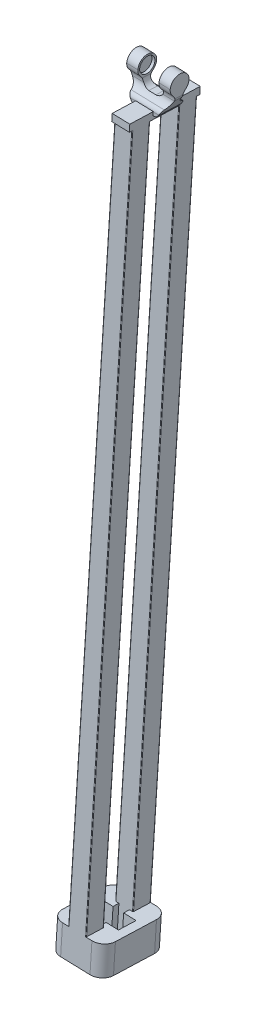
ISO-10303-21;
HEADER;
FILE_DESCRIPTION(('STEP AP214'),'2;1');
FILE_NAME('part.step','',(''),(''),'','','');
FILE_SCHEMA(('AUTOMOTIVE_DESIGN { 1 0 10303 214 1 1 1 1 }'));
ENDSEC;
DATA;
#1=APPLICATION_CONTEXT('core data for automotive mechanical design processes');
#2=APPLICATION_PROTOCOL_DEFINITION('international standard','automotive_design',2000,#1);
#3=PRODUCT_CONTEXT('',#1,'mechanical');
#4=PRODUCT('Part','Part','',(#3));
#5=PRODUCT_RELATED_PRODUCT_CATEGORY('part','',(#4));
#6=PRODUCT_DEFINITION_FORMATION('','',#4);
#7=PRODUCT_DEFINITION_CONTEXT('part definition',#1,'design');
#8=PRODUCT_DEFINITION('design','',#6,#7);
#9=PRODUCT_DEFINITION_SHAPE('','',#8);
#10=(LENGTH_UNIT() NAMED_UNIT(*) SI_UNIT(.MILLI.,.METRE.));
#11=(NAMED_UNIT(*) PLANE_ANGLE_UNIT() SI_UNIT($,.RADIAN.));
#12=(NAMED_UNIT(*) SI_UNIT($,.STERADIAN.) SOLID_ANGLE_UNIT());
#13=UNCERTAINTY_MEASURE_WITH_UNIT(LENGTH_MEASURE(1.E-05),#10,'distance_accuracy_value','');
#14=(GEOMETRIC_REPRESENTATION_CONTEXT(3) GLOBAL_UNCERTAINTY_ASSIGNED_CONTEXT((#13)) GLOBAL_UNIT_ASSIGNED_CONTEXT((#10,
#11,#12)) REPRESENTATION_CONTEXT('',''));
#15=CARTESIAN_POINT('',(0.,0.,0.));
#16=DIRECTION('',(0.,0.,1.));
#17=DIRECTION('',(1.,0.,0.));
#18=AXIS2_PLACEMENT_3D('',#15,#16,#17);
#19=CARTESIAN_POINT('',(15.7115076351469,-68.0591981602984,-37.400632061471));
#20=DIRECTION('',(-0.00109177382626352,-0.0358032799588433,-0.999358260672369));
#21=DIRECTION('',(0.0304556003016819,0.998894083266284,-0.0358199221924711));
#22=AXIS2_PLACEMENT_3D('',#19,#20,#21);
#23=PLANE('',#22);
#24=DIRECTION('',(-0.999535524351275,0.0304751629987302,1.56031403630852E-07));
#25=VECTOR('',#24,1.);
#26=CARTESIAN_POINT('',(-2.40957454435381,-662.401177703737,-16.0877783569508));
#27=LINE('',#26,#25);
#28=CARTESIAN_POINT('',(17.5811359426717,-663.010680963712,-16.0877814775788));
#29=VERTEX_POINT('',#28);
#30=CARTESIAN_POINT('',(12.0836905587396,-662.843067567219,-16.0877806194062));
#31=VERTEX_POINT('',#30);
#32=EDGE_CURVE('E1402',#29,#31,#27,.T.);
#33=ORIENTED_EDGE('',*,*,#32,.T.);
#34=DIRECTION('',(0.0304556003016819,0.998894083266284,-0.0358199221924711));
#35=VECTOR('',#34,1.);
#36=CARTESIAN_POINT('',(30.2047727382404,-68.5010880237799,-37.4006343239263));
#37=LINE('',#36,#35);
#38=CARTESIAN_POINT('',(30.143861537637,-70.4988761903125,-37.3289944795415));
#39=VERTEX_POINT('',#38);
#40=EDGE_CURVE('E41',#31,#39,#37,.T.);
#41=ORIENTED_EDGE('',*,*,#40,.T.);
#42=DIRECTION('',(0.999535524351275,-0.0304751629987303,-1.56031403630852E-07));
#43=VECTOR('',#42,1.);
#44=CARTESIAN_POINT('',(30.6436292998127,-70.5141137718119,-37.3289945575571));
#45=LINE('',#44,#43);
#46=CARTESIAN_POINT('',(16.1503641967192,-70.0722239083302,-37.3289922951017));
#47=VERTEX_POINT('',#46);
#48=EDGE_CURVE('E878',#47,#39,#45,.T.);
#49=ORIENTED_EDGE('',*,*,#48,.F.);
#50=DIRECTION('',(-0.0304556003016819,-0.998894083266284,0.0358199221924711));
#51=VECTOR('',#50,1.);
#52=CARTESIAN_POINT('',(16.2112753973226,-68.0744357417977,-37.4006321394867));
#53=LINE('',#52,#51);
#54=CARTESIAN_POINT('',(-1.90980678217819,-662.416415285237,-16.0877784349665));
#55=VERTEX_POINT('',#54);
#56=EDGE_CURVE('E991',#47,#55,#53,.T.);
#57=ORIENTED_EDGE('',*,*,#56,.T.);
#58=CARTESIAN_POINT('',(-7.40725216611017,-662.248801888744,-16.0877775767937));
#59=VERTEX_POINT('',#58);
#60=EDGE_CURVE('E1404',#55,#59,#27,.T.);
#61=ORIENTED_EDGE('',*,*,#60,.T.);
#62=DIRECTION('',(-0.0304556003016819,-0.998894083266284,0.0358199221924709));
#63=VECTOR('',#62,1.);
#64=CARTESIAN_POINT('',(-5.57991614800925,-602.315156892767,-18.236972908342));
#65=LINE('',#64,#63);
#66=CARTESIAN_POINT('',(-8.16864217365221,-687.221153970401,-15.192279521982));
#67=VERTEX_POINT('',#66);
#68=EDGE_CURVE('E1244',#59,#67,#65,.T.);
#69=ORIENTED_EDGE('',*,*,#68,.T.);
#70=DIRECTION('',(-0.999535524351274,0.0304751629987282,1.56031404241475E-07));
#71=VECTOR('',#70,1.);
#72=CARTESIAN_POINT('',(16.8197459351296,-687.983033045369,-15.1922834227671));
#73=LINE('',#72,#71);
#74=CARTESIAN_POINT('',(16.8197459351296,-687.983033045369,-15.1922834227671));
#75=VERTEX_POINT('',#74);
#76=EDGE_CURVE('E1494',#75,#67,#73,.T.);
#77=ORIENTED_EDGE('',*,*,#76,.F.);
#78=DIRECTION('',(0.0304556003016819,0.998894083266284,-0.0358199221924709));
#79=VECTOR('',#78,1.);
#80=CARTESIAN_POINT('',(19.4084719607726,-603.077035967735,-18.2369768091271));
#81=LINE('',#80,#79);
#82=EDGE_CURVE('E1014',#75,#29,#81,.T.);
#83=ORIENTED_EDGE('',*,*,#82,.T.);
#84=EDGE_LOOP('',(#33,#41,#49,#57,#61,#69,#77,#83));
#85=FACE_BOUND('',#84,.T.);
#86=ADVANCED_FACE('F16',(#85),#23,.F.);
#87=CARTESIAN_POINT('',(19.3975542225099,-603.435068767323,-28.2305594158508));
#88=DIRECTION('',(-0.0304556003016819,-0.998894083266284,0.0358199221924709));
#89=DIRECTION('',(-0.999535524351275,0.0304751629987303,1.56031403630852E-07));
#90=AXIS2_PLACEMENT_3D('',#87,#88,#89);
#91=CYLINDRICAL_SURFACE('',#90,10.);
#92=CARTESIAN_POINT('',(17.570218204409,-663.3687137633,-26.0813640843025));
#93=DIRECTION('',(-0.0304556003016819,-0.998894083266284,0.0358199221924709));
#94=DIRECTION('',(0.446297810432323,0.0184760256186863,0.894693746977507));
#95=AXIS2_PLACEMENT_3D('',#92,#93,#94);
#96=CIRCLE('',#95,10.);
#97=CARTESIAN_POINT('',(27.5655734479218,-663.673465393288,-26.0813656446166));
#98=VERTEX_POINT('',#97);
#99=EDGE_CURVE('E1399',#29,#98,#96,.F.);
#100=ORIENTED_EDGE('',*,*,#99,.F.);
#101=ORIENTED_EDGE('',*,*,#82,.F.);
#102=CARTESIAN_POINT('',(16.808828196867,-688.341065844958,-25.1858660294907));
#103=DIRECTION('',(-0.0304556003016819,-0.998894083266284,0.0358199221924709));
#104=DIRECTION('',(0.446297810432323,0.0184760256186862,0.894693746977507));
#105=AXIS2_PLACEMENT_3D('',#102,#103,#104);
#106=CIRCLE('',#105,10.);
#107=CARTESIAN_POINT('',(26.8041834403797,-688.645817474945,-25.1858675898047));
#108=VERTEX_POINT('',#107);
#109=EDGE_CURVE('E1491',#108,#75,#106,.T.);
#110=ORIENTED_EDGE('',*,*,#109,.F.);
#111=DIRECTION('',(-0.0304556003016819,-0.998894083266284,0.0358199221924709));
#112=VECTOR('',#111,1.);
#113=CARTESIAN_POINT('',(29.3929094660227,-603.739820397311,-28.2305609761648));
#114=LINE('',#113,#112);
#115=EDGE_CURVE('E1180',#98,#108,#114,.T.);
#116=ORIENTED_EDGE('',*,*,#115,.F.);
#117=EDGE_LOOP('',(#100,#101,#110,#116));
#118=FACE_BOUND('',#117,.T.);
#119=ADVANCED_FACE('F1697',(#118),#91,.T.);
#120=CARTESIAN_POINT('',(19.3593421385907,-604.688183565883,-63.2080985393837));
#121=DIRECTION('',(-0.0304556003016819,-0.998894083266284,0.0358199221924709));
#122=DIRECTION('',(-0.999535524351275,0.0304751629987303,1.56031403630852E-07));
#123=AXIS2_PLACEMENT_3D('',#120,#121,#122);
#124=CYLINDRICAL_SURFACE('',#123,10.);
#125=CARTESIAN_POINT('',(17.5320061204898,-664.62182856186,-61.0589032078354));
#126=DIRECTION('',(-0.0304556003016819,-0.998894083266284,0.0358199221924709));
#127=DIRECTION('',(0.446297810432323,0.0184760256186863,0.894693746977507));
#128=AXIS2_PLACEMENT_3D('',#125,#126,#127);
#129=CIRCLE('',#128,10.);
#130=CARTESIAN_POINT('',(27.5273613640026,-664.926580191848,-61.0589047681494));
#131=VERTEX_POINT('',#130);
#132=CARTESIAN_POINT('',(17.5210883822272,-664.979861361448,-71.0524858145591));
#133=VERTEX_POINT('',#132);
#134=EDGE_CURVE('E1387',#131,#133,#129,.F.);
#135=ORIENTED_EDGE('',*,*,#134,.F.);
#136=DIRECTION('',(0.0304556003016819,0.998894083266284,-0.0358199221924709));
#137=VECTOR('',#136,1.);
#138=CARTESIAN_POINT('',(29.3546973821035,-604.99293519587,-63.2081000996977));
#139=LINE('',#138,#137);
#140=CARTESIAN_POINT('',(26.7659713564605,-689.898932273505,-60.1634067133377));
#141=VERTEX_POINT('',#140);
#142=EDGE_CURVE('E1017',#141,#131,#139,.T.);
#143=ORIENTED_EDGE('',*,*,#142,.F.);
#144=CARTESIAN_POINT('',(16.7706161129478,-689.594180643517,-60.1634051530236));
#145=DIRECTION('',(-0.0304556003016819,-0.998894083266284,0.0358199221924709));
#146=DIRECTION('',(0.446297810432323,0.0184760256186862,0.894693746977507));
#147=AXIS2_PLACEMENT_3D('',#144,#145,#146);
#148=CIRCLE('',#147,10.);
#149=CARTESIAN_POINT('',(16.7596983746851,-689.952213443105,-70.1569877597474));
#150=VERTEX_POINT('',#149);
#151=EDGE_CURVE('E1485',#150,#141,#148,.T.);
#152=ORIENTED_EDGE('',*,*,#151,.F.);
#153=DIRECTION('',(-0.0304556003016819,-0.998894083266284,0.0358199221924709));
#154=VECTOR('',#153,1.);
#155=CARTESIAN_POINT('',(19.3484244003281,-605.046216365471,-73.2016811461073));
#156=LINE('',#155,#154);
#157=EDGE_CURVE('E1236',#133,#150,#156,.T.);
#158=ORIENTED_EDGE('',*,*,#157,.F.);
#159=EDGE_LOOP('',(#135,#143,#152,#158));
#160=FACE_BOUND('',#159,.T.);
#161=ADVANCED_FACE('F719',(#160),#124,.T.);
#162=CARTESIAN_POINT('',(10.6289622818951,-628.521652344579,-37.3286427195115));
#163=DIRECTION('',(0.00109177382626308,0.0358032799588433,0.999358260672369));
#164=DIRECTION('',(-0.999535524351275,0.0304751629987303,1.56031403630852E-07));
#165=AXIS2_PLACEMENT_3D('',#162,#163,#164);
#166=PLANE('',#165);
#167=DIRECTION('',(0.0304556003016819,0.998894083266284,-0.0358199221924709));
#168=VECTOR('',#167,1.);
#169=CARTESIAN_POINT('',(10.6289622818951,-628.521652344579,-37.3286427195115));
#170=LINE('',#169,#168);
#171=CARTESIAN_POINT('',(8.80162626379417,-688.455297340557,-35.1794473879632));
#172=VERTEX_POINT('',#171);
#173=CARTESIAN_POINT('',(9.5630162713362,-663.482945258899,-36.074945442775));
#174=VERTEX_POINT('',#173);
#175=EDGE_CURVE('E910',#172,#174,#170,.T.);
#176=ORIENTED_EDGE('',*,*,#175,.T.);
#177=DIRECTION('',(0.999535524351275,-0.0304751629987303,-1.56031403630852E-07));
#178=VECTOR('',#177,1.);
#179=CARTESIAN_POINT('',(9.5630162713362,-663.482945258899,-36.074945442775));
#180=LINE('',#179,#178);
#181=CARTESIAN_POINT('',(20.1580928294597,-663.805981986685,-36.0749470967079));
#182=VERTEX_POINT('',#181);
#183=EDGE_CURVE('E1437',#174,#182,#180,.T.);
#184=ORIENTED_EDGE('',*,*,#183,.T.);
#185=DIRECTION('',(0.0304556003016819,0.998894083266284,-0.0358199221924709));
#186=VECTOR('',#185,1.);
#187=CARTESIAN_POINT('',(21.2240388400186,-628.844689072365,-37.3286443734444));
#188=LINE('',#187,#186);
#189=CARTESIAN_POINT('',(19.3967028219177,-688.778334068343,-35.1794490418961));
#190=VERTEX_POINT('',#189);
#191=EDGE_CURVE('E10',#190,#182,#188,.T.);
#192=ORIENTED_EDGE('',*,*,#191,.F.);
#193=DIRECTION('',(-0.999535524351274,0.0304751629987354,1.56031402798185E-07));
#194=VECTOR('',#193,1.);
#195=CARTESIAN_POINT('',(19.3967028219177,-688.778334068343,-35.1794490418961));
#196=LINE('',#195,#194);
#197=EDGE_CURVE('E1464',#190,#172,#196,.T.);
#198=ORIENTED_EDGE('',*,*,#197,.T.);
#199=EDGE_LOOP('',(#176,#184,#192,#198));
#200=FACE_BOUND('',#199,.T.);
#201=ADVANCED_FACE('F1765',(#200),#166,.F.);
#202=CARTESIAN_POINT('',(21.2240388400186,-628.844689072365,-37.3286443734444));
#203=DIRECTION('',(0.999535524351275,-0.0304751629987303,-1.56031403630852E-07));
#204=DIRECTION('',(-0.00109177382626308,-0.0358032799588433,-0.999358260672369));
#205=AXIS2_PLACEMENT_3D('',#202,#203,#204);
#206=PLANE('',#205);
#207=ORIENTED_EDGE('',*,*,#191,.T.);
#208=DIRECTION('',(-0.00109177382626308,-0.0358032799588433,-0.999358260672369));
#209=VECTOR('',#208,1.);
#210=CARTESIAN_POINT('',(20.1580928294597,-663.805981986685,-36.0749470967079));
#211=LINE('',#210,#209);
#212=CARTESIAN_POINT('',(20.1417162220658,-664.343031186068,-51.0653210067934));
#213=VERTEX_POINT('',#212);
#214=EDGE_CURVE('E1434',#182,#213,#211,.T.);
#215=ORIENTED_EDGE('',*,*,#214,.T.);
#216=DIRECTION('',(0.0304556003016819,0.998894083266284,-0.0358199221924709));
#217=VECTOR('',#216,1.);
#218=CARTESIAN_POINT('',(21.2076622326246,-629.381738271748,-52.3190182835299));
#219=LINE('',#218,#217);
#220=CARTESIAN_POINT('',(19.3803262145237,-689.315383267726,-50.1698229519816));
#221=VERTEX_POINT('',#220);
#222=EDGE_CURVE('E27',#221,#213,#219,.T.);
#223=ORIENTED_EDGE('',*,*,#222,.F.);
#224=DIRECTION('',(0.00109177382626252,0.0358032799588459,0.999358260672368));
#225=VECTOR('',#224,1.);
#226=CARTESIAN_POINT('',(19.3803262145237,-689.315383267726,-50.1698229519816));
#227=LINE('',#226,#225);
#228=EDGE_CURVE('E1461',#221,#190,#227,.T.);
#229=ORIENTED_EDGE('',*,*,#228,.T.);
#230=EDGE_LOOP('',(#207,#215,#223,#229));
#231=FACE_BOUND('',#230,.T.);
#232=ADVANCED_FACE('F1894',(#231),#206,.F.);
#233=CARTESIAN_POINT('',(21.2076622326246,-629.381738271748,-52.3190182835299));
#234=DIRECTION('',(-0.00109177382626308,-0.0358032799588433,-0.999358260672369));
#235=DIRECTION('',(-0.999535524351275,0.0304751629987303,1.56031403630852E-07));
#236=AXIS2_PLACEMENT_3D('',#233,#234,#235);
#237=PLANE('',#236);
#238=ORIENTED_EDGE('',*,*,#222,.T.);
#239=DIRECTION('',(-0.999535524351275,0.0304751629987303,1.56031403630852E-07));
#240=VECTOR('',#239,1.);
#241=CARTESIAN_POINT('',(20.1417162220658,-664.343031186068,-51.0653210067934));
#242=LINE('',#241,#240);
#243=CARTESIAN_POINT('',(9.54663966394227,-664.019994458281,-51.0653193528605));
#244=VERTEX_POINT('',#243);
#245=EDGE_CURVE('E1431',#213,#244,#242,.T.);
#246=ORIENTED_EDGE('',*,*,#245,.T.);
#247=DIRECTION('',(0.0304556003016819,0.998894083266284,-0.0358199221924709));
#248=VECTOR('',#247,1.);
#249=CARTESIAN_POINT('',(10.6125856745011,-629.058701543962,-52.319016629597));
#250=LINE('',#249,#248);
#251=CARTESIAN_POINT('',(8.78524965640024,-688.992346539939,-50.1698212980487));
#252=VERTEX_POINT('',#251);
#253=EDGE_CURVE('E1018',#252,#244,#250,.T.);
#254=ORIENTED_EDGE('',*,*,#253,.F.);
#255=DIRECTION('',(0.999535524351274,-0.0304751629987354,-1.56031403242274E-07));
#256=VECTOR('',#255,1.);
#257=CARTESIAN_POINT('',(8.78524965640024,-688.992346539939,-50.1698212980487));
#258=LINE('',#257,#256);
#259=EDGE_CURVE('E1458',#252,#221,#258,.T.);
#260=ORIENTED_EDGE('',*,*,#259,.T.);
#261=EDGE_LOOP('',(#238,#246,#254,#260));
#262=FACE_BOUND('',#261,.T.);
#263=ADVANCED_FACE('F436',(#262),#237,.F.);
#264=CARTESIAN_POINT('',(11.3958111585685,-603.370283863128,-33.2273494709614));
#265=DIRECTION('',(0.999535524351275,-0.0304751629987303,-1.56031403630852E-07));
#266=DIRECTION('',(-0.0304556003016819,-0.998894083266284,0.0358199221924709));
#267=AXIS2_PLACEMENT_3D('',#264,#265,#266);
#268=PLANE('',#267);
#269=DIRECTION('',(-0.0304556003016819,-0.998894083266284,0.0358199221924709));
#270=VECTOR('',#269,1.);
#271=CARTESIAN_POINT('',(11.3958111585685,-603.370283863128,-33.2273494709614));
#272=LINE('',#271,#270);
#273=CARTESIAN_POINT('',(9.56847514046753,-663.303928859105,-31.0781541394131));
#274=VERTEX_POINT('',#273);
#275=CARTESIAN_POINT('',(8.80708513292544,-688.276280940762,-30.1826560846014));
#276=VERTEX_POINT('',#275);
#277=EDGE_CURVE('E961',#274,#276,#272,.T.);
#278=ORIENTED_EDGE('',*,*,#277,.F.);
#279=DIRECTION('',(-0.00109177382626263,-0.0358032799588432,-0.999358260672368));
#280=VECTOR('',#279,1.);
#281=CARTESIAN_POINT('',(9.56847514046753,-663.303928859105,-31.0781541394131));
#282=LINE('',#281,#280);
#283=EDGE_CURVE('E1440',#274,#174,#282,.T.);
#284=ORIENTED_EDGE('',*,*,#283,.T.);
#285=ORIENTED_EDGE('',*,*,#175,.F.);
#286=DIRECTION('',(0.00109177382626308,0.0358032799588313,0.999358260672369));
#287=VECTOR('',#286,1.);
#288=CARTESIAN_POINT('',(8.80162626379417,-688.455297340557,-35.1794473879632));
#289=LINE('',#288,#287);
#290=EDGE_CURVE('E1467',#172,#276,#289,.T.);
#291=ORIENTED_EDGE('',*,*,#290,.T.);
#292=EDGE_LOOP('',(#278,#284,#285,#291));
#293=FACE_BOUND('',#292,.T.);
#294=ADVANCED_FACE('F1764',(#293),#268,.F.);
#295=CARTESIAN_POINT('',(29.4038272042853,-603.381787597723,-18.2369783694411));
#296=DIRECTION('',(-0.999535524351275,0.0304751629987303,1.56031403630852E-07));
#297=DIRECTION('',(0.00109177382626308,0.0358032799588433,0.999358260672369));
#298=AXIS2_PLACEMENT_3D('',#295,#296,#297);
#299=PLANE('',#298);
#300=ORIENTED_EDGE('',*,*,#142,.T.);
#301=DIRECTION('',(0.00109177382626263,0.0358032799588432,0.999358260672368));
#302=VECTOR('',#301,1.);
#303=CARTESIAN_POINT('',(27.5764911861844,-663.315432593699,-16.0877830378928));
#304=LINE('',#303,#302);
#305=EDGE_CURVE('E1396',#131,#98,#304,.T.);
#306=ORIENTED_EDGE('',*,*,#305,.T.);
#307=ORIENTED_EDGE('',*,*,#115,.T.);
#308=DIRECTION('',(0.00109177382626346,0.0358032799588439,0.999358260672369));
#309=VECTOR('',#308,1.);
#310=CARTESIAN_POINT('',(26.7659713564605,-689.898932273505,-60.1634067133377));
#311=LINE('',#310,#309);
#312=EDGE_CURVE('E1488',#141,#108,#311,.T.);
#313=ORIENTED_EDGE('',*,*,#312,.F.);
#314=EDGE_LOOP('',(#300,#306,#307,#313));
#315=FACE_BOUND('',#314,.T.);
#316=ADVANCED_FACE('F1829',(#315),#299,.F.);
#317=CARTESIAN_POINT('',(11.3958111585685,-603.370283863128,-33.2273494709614));
#318=DIRECTION('',(0.999535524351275,-0.0304751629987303,-1.56031403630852E-07));
#319=DIRECTION('',(-0.0304556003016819,-0.998894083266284,0.0358199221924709));
#320=AXIS2_PLACEMENT_3D('',#317,#318,#319);
#321=PLANE('',#320);
#322=ORIENTED_EDGE('',*,*,#253,.T.);
#323=DIRECTION('',(-0.00109177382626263,-0.0358032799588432,-0.999358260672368));
#324=VECTOR('',#323,1.);
#325=CARTESIAN_POINT('',(9.56847514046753,-663.303928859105,-31.0781541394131));
#326=LINE('',#325,#324);
#327=CARTESIAN_POINT('',(9.54118079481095,-664.199010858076,-56.0621106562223));
#328=VERTEX_POINT('',#327);
#329=EDGE_CURVE('E1428',#244,#328,#326,.T.);
#330=ORIENTED_EDGE('',*,*,#329,.T.);
#331=DIRECTION('',(-0.0304556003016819,-0.998894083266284,0.0358199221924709));
#332=VECTOR('',#331,1.);
#333=CARTESIAN_POINT('',(11.3685168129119,-604.265365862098,-58.2113059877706));
#334=LINE('',#333,#332);
#335=CARTESIAN_POINT('',(8.7797907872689,-689.171362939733,-55.1666126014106));
#336=VERTEX_POINT('',#335);
#337=EDGE_CURVE('E817',#328,#336,#334,.T.);
#338=ORIENTED_EDGE('',*,*,#337,.T.);
#339=DIRECTION('',(0.00109177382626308,0.0358032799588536,0.999358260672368));
#340=VECTOR('',#339,1.);
#341=CARTESIAN_POINT('',(8.7797907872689,-689.171362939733,-55.1666126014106));
#342=LINE('',#341,#340);
#343=EDGE_CURVE('E1455',#336,#252,#342,.T.);
#344=ORIENTED_EDGE('',*,*,#343,.T.);
#345=EDGE_LOOP('',(#322,#330,#338,#344));
#346=FACE_BOUND('',#345,.T.);
#347=ADVANCED_FACE('F1891',(#346),#321,.F.);
#348=CARTESIAN_POINT('',(-5.62904597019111,-603.926304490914,-63.2080946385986));
#349=DIRECTION('',(-0.0304556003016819,-0.998894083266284,0.0358199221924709));
#350=DIRECTION('',(0.999535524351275,-0.0304751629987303,-1.56031403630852E-07));
#351=AXIS2_PLACEMENT_3D('',#348,#349,#350);
#352=CYLINDRICAL_SURFACE('',#351,10.);
#353=CARTESIAN_POINT('',(-7.45638198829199,-663.859949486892,-61.0588993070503));
#354=DIRECTION('',(-0.0304556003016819,-0.998894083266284,0.0358199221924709));
#355=DIRECTION('',(0.446297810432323,0.0184760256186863,0.894693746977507));
#356=AXIS2_PLACEMENT_3D('',#353,#354,#355);
#357=CIRCLE('',#356,10.);
#358=CARTESIAN_POINT('',(-7.46729972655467,-664.21798228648,-71.052481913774));
#359=VERTEX_POINT('',#358);
#360=CARTESIAN_POINT('',(-17.4517372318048,-663.555197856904,-61.0588977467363));
#361=VERTEX_POINT('',#360);
#362=EDGE_CURVE('E1405',#359,#361,#357,.F.);
#363=ORIENTED_EDGE('',*,*,#362,.F.);
#364=DIRECTION('',(0.0304556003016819,0.998894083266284,-0.0358199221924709));
#365=VECTOR('',#364,1.);
#366=CARTESIAN_POINT('',(-5.63996370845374,-604.284337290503,-73.2016772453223));
#367=LINE('',#366,#365);
#368=CARTESIAN_POINT('',(-8.22868973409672,-689.190334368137,-70.1569838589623));
#369=VERTEX_POINT('',#368);
#370=EDGE_CURVE('E1062',#369,#359,#367,.T.);
#371=ORIENTED_EDGE('',*,*,#370,.F.);
#372=CARTESIAN_POINT('',(-8.21777199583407,-688.832301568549,-60.1634012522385));
#373=DIRECTION('',(-0.0304556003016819,-0.998894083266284,0.0358199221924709));
#374=DIRECTION('',(0.446297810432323,0.0184760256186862,0.894693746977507));
#375=AXIS2_PLACEMENT_3D('',#372,#373,#374);
#376=CIRCLE('',#375,10.);
#377=CARTESIAN_POINT('',(-18.2131272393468,-688.527549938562,-60.1633996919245));
#378=VERTEX_POINT('',#377);
#379=EDGE_CURVE('E1479',#378,#369,#376,.T.);
#380=ORIENTED_EDGE('',*,*,#379,.F.);
#381=DIRECTION('',(-0.0304556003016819,-0.998894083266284,0.0358199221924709));
#382=VECTOR('',#381,1.);
#383=CARTESIAN_POINT('',(-15.6244012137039,-603.621552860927,-63.2080930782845));
#384=LINE('',#383,#382);
#385=EDGE_CURVE('E1144',#361,#378,#384,.T.);
#386=ORIENTED_EDGE('',*,*,#385,.F.);
#387=EDGE_LOOP('',(#363,#371,#380,#386));
#388=FACE_BOUND('',#387,.T.);
#389=ADVANCED_FACE('F1808',(#388),#352,.T.);
#390=CARTESIAN_POINT('',(-5.59083388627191,-602.673189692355,-28.2305555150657));
#391=DIRECTION('',(-0.0304556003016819,-0.998894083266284,0.0358199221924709));
#392=DIRECTION('',(0.999535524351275,-0.0304751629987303,-1.56031403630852E-07));
#393=AXIS2_PLACEMENT_3D('',#390,#391,#392);
#394=CYLINDRICAL_SURFACE('',#393,10.);
#395=CARTESIAN_POINT('',(-7.41816990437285,-662.606834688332,-26.0813601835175));
#396=DIRECTION('',(-0.0304556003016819,-0.998894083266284,0.0358199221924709));
#397=DIRECTION('',(0.446297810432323,0.0184760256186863,0.894693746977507));
#398=AXIS2_PLACEMENT_3D('',#395,#396,#397);
#399=CIRCLE('',#398,10.);
#400=CARTESIAN_POINT('',(-17.4135251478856,-662.302083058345,-26.0813586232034));
#401=VERTEX_POINT('',#400);
#402=EDGE_CURVE('E1410',#401,#59,#399,.F.);
#403=ORIENTED_EDGE('',*,*,#402,.F.);
#404=DIRECTION('',(0.0304556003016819,0.998894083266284,-0.0358199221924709));
#405=VECTOR('',#404,1.);
#406=CARTESIAN_POINT('',(-15.5861891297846,-602.368438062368,-28.2305539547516));
#407=LINE('',#406,#405);
#408=CARTESIAN_POINT('',(-18.1749151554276,-687.274435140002,-25.1858605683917));
#409=VERTEX_POINT('',#408);
#410=EDGE_CURVE('E1140',#409,#401,#407,.T.);
#411=ORIENTED_EDGE('',*,*,#410,.F.);
#412=CARTESIAN_POINT('',(-8.17955991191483,-687.57918676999,-25.1858621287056));
#413=DIRECTION('',(-0.0304556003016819,-0.998894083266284,0.0358199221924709));
#414=DIRECTION('',(0.446297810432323,0.0184760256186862,0.894693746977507));
#415=AXIS2_PLACEMENT_3D('',#412,#413,#414);
#416=CIRCLE('',#415,10.);
#417=EDGE_CURVE('E1496',#67,#409,#416,.T.);
#418=ORIENTED_EDGE('',*,*,#417,.F.);
#419=ORIENTED_EDGE('',*,*,#68,.F.);
#420=EDGE_LOOP('',(#403,#411,#418,#419));
#421=FACE_BOUND('',#420,.T.);
#422=ADVANCED_FACE('F1817',(#421),#394,.T.);
#423=CARTESIAN_POINT('',(1.61676595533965,-628.784425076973,-52.3190152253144));
#424=DIRECTION('',(-0.00109177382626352,-0.0358032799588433,-0.999358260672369));
#425=DIRECTION('',(0.0304556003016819,0.998894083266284,-0.0358199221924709));
#426=AXIS2_PLACEMENT_3D('',#423,#424,#425);
#427=PLANE('',#426);
#428=DIRECTION('',(0.0304556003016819,0.998894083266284,-0.0358199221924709));
#429=VECTOR('',#428,1.);
#430=CARTESIAN_POINT('',(1.61676595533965,-628.784425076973,-52.3190152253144));
#431=LINE('',#430,#429);
#432=CARTESIAN_POINT('',(-0.210570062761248,-688.718070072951,-50.1698198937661));
#433=VERTEX_POINT('',#432);
#434=CARTESIAN_POINT('',(0.550819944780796,-663.745717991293,-51.0653179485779));
#435=VERTEX_POINT('',#434);
#436=EDGE_CURVE('E832',#433,#435,#431,.T.);
#437=ORIENTED_EDGE('',*,*,#436,.T.);
#438=DIRECTION('',(-0.999535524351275,0.0304751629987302,1.56031403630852E-07));
#439=VECTOR('',#438,1.);
#440=CARTESIAN_POINT('',(0.550819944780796,-663.745717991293,-51.0653179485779));
#441=LINE('',#440,#439);
#442=CARTESIAN_POINT('',(-10.0442566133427,-663.422681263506,-51.065316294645));
#443=VERTEX_POINT('',#442);
#444=EDGE_CURVE('E1422',#435,#443,#441,.T.);
#445=ORIENTED_EDGE('',*,*,#444,.T.);
#446=DIRECTION('',(0.0304556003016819,0.998894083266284,-0.0358199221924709));
#447=VECTOR('',#446,1.);
#448=CARTESIAN_POINT('',(-8.97831060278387,-628.461388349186,-52.3190135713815));
#449=LINE('',#448,#447);
#450=CARTESIAN_POINT('',(-10.8056466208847,-688.395033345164,-50.1698182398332));
#451=VERTEX_POINT('',#450);
#452=EDGE_CURVE('E831',#451,#443,#449,.T.);
#453=ORIENTED_EDGE('',*,*,#452,.F.);
#454=DIRECTION('',(0.999535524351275,-0.0304751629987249,-1.56031403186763E-07));
#455=VECTOR('',#454,1.);
#456=CARTESIAN_POINT('',(-10.8056466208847,-688.395033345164,-50.1698182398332));
#457=LINE('',#456,#455);
#458=EDGE_CURVE('E1446',#451,#433,#457,.T.);
#459=ORIENTED_EDGE('',*,*,#458,.T.);
#460=EDGE_LOOP('',(#437,#445,#453,#459));
#461=FACE_BOUND('',#460,.T.);
#462=ADVANCED_FACE('F1712',(#461),#427,.F.);
#463=CARTESIAN_POINT('',(-8.97831060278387,-628.461388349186,-52.3190135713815));
#464=DIRECTION('',(-0.999535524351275,0.0304751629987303,1.56031403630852E-07));
#465=DIRECTION('',(0.00109177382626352,0.0358032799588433,0.999358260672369));
#466=AXIS2_PLACEMENT_3D('',#463,#464,#465);
#467=PLANE('',#466);
#468=ORIENTED_EDGE('',*,*,#452,.T.);
#469=DIRECTION('',(0.00109177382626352,0.0358032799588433,0.999358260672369));
#470=VECTOR('',#469,1.);
#471=CARTESIAN_POINT('',(-10.0442566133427,-663.422681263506,-51.065316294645));
#472=LINE('',#471,#470);
#473=CARTESIAN_POINT('',(-10.0278800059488,-662.885632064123,-36.0749423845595));
#474=VERTEX_POINT('',#473);
#475=EDGE_CURVE('E1419',#443,#474,#472,.T.);
#476=ORIENTED_EDGE('',*,*,#475,.T.);
#477=DIRECTION('',(0.0304556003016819,0.998894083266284,-0.0358199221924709));
#478=VECTOR('',#477,1.);
#479=CARTESIAN_POINT('',(-8.9619339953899,-627.924339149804,-37.328639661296));
#480=LINE('',#479,#478);
#481=CARTESIAN_POINT('',(-10.7892700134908,-687.857984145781,-35.1794443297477));
#482=VERTEX_POINT('',#481);
#483=EDGE_CURVE('E827',#482,#474,#480,.T.);
#484=ORIENTED_EDGE('',*,*,#483,.F.);
#485=DIRECTION('',(-0.00109177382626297,-0.035803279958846,-0.999358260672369));
#486=VECTOR('',#485,1.);
#487=CARTESIAN_POINT('',(-10.7892700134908,-687.857984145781,-35.1794443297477));
#488=LINE('',#487,#486);
#489=EDGE_CURVE('E1443',#482,#451,#488,.T.);
#490=ORIENTED_EDGE('',*,*,#489,.T.);
#491=EDGE_LOOP('',(#468,#476,#484,#490));
#492=FACE_BOUND('',#491,.T.);
#493=ADVANCED_FACE('F1708',(#492),#467,.F.);
#494=CARTESIAN_POINT('',(-8.9619339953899,-627.924339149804,-37.328639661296));
#495=DIRECTION('',(0.00109177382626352,0.0358032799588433,0.999358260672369));
#496=DIRECTION('',(0.999535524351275,-0.0304751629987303,-1.56031403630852E-07));
#497=AXIS2_PLACEMENT_3D('',#494,#495,#496);
#498=PLANE('',#497);
#499=ORIENTED_EDGE('',*,*,#483,.T.);
#500=DIRECTION('',(0.999535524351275,-0.0304751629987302,-1.56031403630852E-07));
#501=VECTOR('',#500,1.);
#502=CARTESIAN_POINT('',(-10.0278800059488,-662.885632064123,-36.0749423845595));
#503=LINE('',#502,#501);
#504=CARTESIAN_POINT('',(0.567196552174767,-663.208668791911,-36.0749440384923));
#505=VERTEX_POINT('',#504);
#506=EDGE_CURVE('E1416',#474,#505,#503,.T.);
#507=ORIENTED_EDGE('',*,*,#506,.T.);
#508=DIRECTION('',(0.0304556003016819,0.998894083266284,-0.0358199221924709));
#509=VECTOR('',#508,1.);
#510=CARTESIAN_POINT('',(1.63314256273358,-628.24737587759,-37.3286413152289));
#511=LINE('',#510,#509);
#512=CARTESIAN_POINT('',(-0.194193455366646,-688.181020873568,-35.1794459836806));
#513=VERTEX_POINT('',#512);
#514=EDGE_CURVE('E990',#513,#505,#511,.T.);
#515=ORIENTED_EDGE('',*,*,#514,.F.);
#516=DIRECTION('',(-0.999535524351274,0.0304751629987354,1.56031403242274E-07));
#517=VECTOR('',#516,1.);
#518=CARTESIAN_POINT('',(-0.194193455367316,-688.181020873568,-35.1794459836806));
#519=LINE('',#518,#517);
#520=EDGE_CURVE('E1476',#513,#482,#519,.T.);
#521=ORIENTED_EDGE('',*,*,#520,.T.);
#522=EDGE_LOOP('',(#499,#507,#515,#521));
#523=FACE_BOUND('',#522,.T.);
#524=ADVANCED_FACE('F1711',(#523),#498,.F.);
#525=CARTESIAN_POINT('',(2.37269709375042,-603.991089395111,-58.2113045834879));
#526=DIRECTION('',(-0.999535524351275,0.0304751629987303,1.56031403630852E-07));
#527=DIRECTION('',(0.00109177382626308,0.0358032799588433,0.999358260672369));
#528=AXIS2_PLACEMENT_3D('',#525,#526,#527);
#529=PLANE('',#528);
#530=DIRECTION('',(-0.0304556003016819,-0.998894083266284,0.0358199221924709));
#531=VECTOR('',#530,1.);
#532=CARTESIAN_POINT('',(2.37269709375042,-603.991089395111,-58.2113045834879));
#533=LINE('',#532,#531);
#534=CARTESIAN_POINT('',(0.545361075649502,-663.924734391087,-56.0621092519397));
#535=VERTEX_POINT('',#534);
#536=CARTESIAN_POINT('',(-0.216028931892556,-688.897086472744,-55.1666111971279));
#537=VERTEX_POINT('',#536);
#538=EDGE_CURVE('E1004',#535,#537,#533,.T.);
#539=ORIENTED_EDGE('',*,*,#538,.F.);
#540=DIRECTION('',(0.00109177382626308,0.0358032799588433,0.999358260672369));
#541=VECTOR('',#540,1.);
#542=CARTESIAN_POINT('',(0.545361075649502,-663.924734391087,-56.0621092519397));
#543=LINE('',#542,#541);
#544=EDGE_CURVE('E1425',#535,#435,#543,.T.);
#545=ORIENTED_EDGE('',*,*,#544,.T.);
#546=ORIENTED_EDGE('',*,*,#436,.F.);
#547=DIRECTION('',(-0.00109177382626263,-0.0358032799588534,-0.999358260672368));
#548=VECTOR('',#547,1.);
#549=CARTESIAN_POINT('',(-0.210570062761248,-688.718070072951,-50.1698198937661));
#550=LINE('',#549,#548);
#551=EDGE_CURVE('E1449',#433,#537,#550,.T.);
#552=ORIENTED_EDGE('',*,*,#551,.T.);
#553=EDGE_LOOP('',(#539,#545,#546,#552));
#554=FACE_BOUND('',#553,.T.);
#555=ADVANCED_FACE('F1592',(#554),#529,.F.);
#556=CARTESIAN_POINT('',(-15.6353189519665,-603.979585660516,-73.2016756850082));
#557=DIRECTION('',(0.999535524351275,-0.0304751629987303,-1.56031403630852E-07));
#558=DIRECTION('',(-0.0304556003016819,-0.998894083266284,0.0358199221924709));
#559=AXIS2_PLACEMENT_3D('',#556,#557,#558);
#560=PLANE('',#559);
#561=ORIENTED_EDGE('',*,*,#410,.T.);
#562=DIRECTION('',(-0.00109177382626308,-0.0358032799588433,-0.999358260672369));
#563=VECTOR('',#562,1.);
#564=CARTESIAN_POINT('',(-17.4626549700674,-663.913230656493,-71.05248035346));
#565=LINE('',#564,#563);
#566=EDGE_CURVE('E1408',#401,#361,#565,.T.);
#567=ORIENTED_EDGE('',*,*,#566,.T.);
#568=ORIENTED_EDGE('',*,*,#385,.T.);
#569=DIRECTION('',(-0.00109177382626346,-0.0358032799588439,-0.999358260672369));
#570=VECTOR('',#569,1.);
#571=CARTESIAN_POINT('',(-18.1749151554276,-687.274435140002,-25.1858605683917));
#572=LINE('',#571,#570);
#573=EDGE_CURVE('E1499',#409,#378,#572,.T.);
#574=ORIENTED_EDGE('',*,*,#573,.F.);
#575=EDGE_LOOP('',(#561,#567,#568,#574));
#576=FACE_BOUND('',#575,.T.);
#577=ADVANCED_FACE('F1730',(#576),#560,.F.);
#578=CARTESIAN_POINT('',(2.37269709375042,-603.991089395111,-58.2113045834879));
#579=DIRECTION('',(-0.999535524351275,0.0304751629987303,1.56031403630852E-07));
#580=DIRECTION('',(0.00109177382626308,0.0358032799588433,0.999358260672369));
#581=AXIS2_PLACEMENT_3D('',#578,#579,#580);
#582=PLANE('',#581);
#583=ORIENTED_EDGE('',*,*,#514,.T.);
#584=DIRECTION('',(0.00109177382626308,0.0358032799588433,0.999358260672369));
#585=VECTOR('',#584,1.);
#586=CARTESIAN_POINT('',(0.545361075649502,-663.924734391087,-56.0621092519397));
#587=LINE('',#586,#585);
#588=CARTESIAN_POINT('',(0.57265542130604,-663.029652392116,-31.0781527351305));
#589=VERTEX_POINT('',#588);
#590=EDGE_CURVE('E1413',#505,#589,#587,.T.);
#591=ORIENTED_EDGE('',*,*,#590,.T.);
#592=DIRECTION('',(-0.0304556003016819,-0.998894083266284,0.0358199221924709));
#593=VECTOR('',#592,1.);
#594=CARTESIAN_POINT('',(2.39999143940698,-603.096007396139,-33.2273480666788));
#595=LINE('',#594,#593);
#596=CARTESIAN_POINT('',(-0.188734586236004,-688.002004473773,-30.1826546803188));
#597=VERTEX_POINT('',#596);
#598=EDGE_CURVE('E1167',#589,#597,#595,.T.);
#599=ORIENTED_EDGE('',*,*,#598,.T.);
#600=DIRECTION('',(-0.00109177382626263,-0.0358032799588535,-0.999358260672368));
#601=VECTOR('',#600,1.);
#602=CARTESIAN_POINT('',(-0.188734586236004,-688.002004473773,-30.1826546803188));
#603=LINE('',#602,#601);
#604=EDGE_CURVE('E1473',#597,#513,#603,.T.);
#605=ORIENTED_EDGE('',*,*,#604,.T.);
#606=EDGE_LOOP('',(#583,#591,#599,#605));
#607=FACE_BOUND('',#606,.T.);
#608=ADVANCED_FACE('F633',(#607),#582,.F.);
#609=CARTESIAN_POINT('',(30.2042268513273,-68.5189896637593,-37.9003134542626));
#610=DIRECTION('',(-0.0304556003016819,-0.998894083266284,0.0358199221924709));
#611=DIRECTION('',(-0.00109177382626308,-0.0358032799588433,-0.999358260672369));
#612=AXIS2_PLACEMENT_3D('',#609,#610,#611);
#613=CYLINDRICAL_SURFACE('',#612,0.5);
#614=CARTESIAN_POINT('',(12.0831446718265,-662.860969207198,-16.5874597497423));
#615=DIRECTION('',(-0.0304556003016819,-0.998894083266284,0.0358199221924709));
#616=DIRECTION('',(-0.446297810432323,-0.0184760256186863,-0.894693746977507));
#617=AXIS2_PLACEMENT_3D('',#614,#615,#616);
#618=CIRCLE('',#617,0.5);
#619=CARTESIAN_POINT('',(12.5829124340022,-662.876206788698,-16.587459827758));
#620=VERTEX_POINT('',#619);
#621=EDGE_CURVE('E1549',#620,#31,#618,.T.);
#622=ORIENTED_EDGE('',*,*,#621,.F.);
#623=DIRECTION('',(-0.0304556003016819,-0.998894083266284,0.0358199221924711));
#624=VECTOR('',#623,1.);
#625=CARTESIAN_POINT('',(30.7039946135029,-68.5342272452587,-37.9003135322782));
#626=LINE('',#625,#624);
#627=CARTESIAN_POINT('',(30.6430834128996,-70.5320154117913,-37.8286736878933));
#628=VERTEX_POINT('',#627);
#629=EDGE_CURVE('E838',#628,#620,#626,.T.);
#630=ORIENTED_EDGE('',*,*,#629,.F.);
#631=CARTESIAN_POINT('',(30.1433156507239,-70.516777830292,-37.8286736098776));
#632=DIRECTION('',(-0.0304556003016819,-0.998894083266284,0.0358199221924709));
#633=DIRECTION('',(0.999535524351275,-0.0304751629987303,-1.56031403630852E-07));
#634=AXIS2_PLACEMENT_3D('',#631,#632,#633);
#635=CIRCLE('',#634,0.5);
#636=EDGE_CURVE('E882',#628,#39,#635,.T.);
#637=ORIENTED_EDGE('',*,*,#636,.T.);
#638=ORIENTED_EDGE('',*,*,#40,.F.);
#639=EDGE_LOOP('',(#622,#630,#637,#638));
#640=FACE_BOUND('',#639,.T.);
#641=ADVANCED_FACE('F1550',(#640),#613,.T.);
#642=CARTESIAN_POINT('',(16.2107295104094,-68.0923373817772,-37.9003112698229));
#643=DIRECTION('',(-0.0304556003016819,-0.998894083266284,0.0358199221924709));
#644=DIRECTION('',(-0.00109177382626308,-0.0358032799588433,-0.999358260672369));
#645=AXIS2_PLACEMENT_3D('',#642,#643,#644);
#646=CYLINDRICAL_SURFACE('',#645,0.5);
#647=CARTESIAN_POINT('',(-1.91035266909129,-662.434316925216,-16.5874575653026));
#648=DIRECTION('',(-0.0304556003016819,-0.998894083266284,0.0358199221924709));
#649=DIRECTION('',(0.446297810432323,0.0184760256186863,0.894693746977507));
#650=AXIS2_PLACEMENT_3D('',#647,#648,#649);
#651=CIRCLE('',#650,0.5);
#652=CARTESIAN_POINT('',(-2.41012043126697,-662.419079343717,-16.5874574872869));
#653=VERTEX_POINT('',#652);
#654=EDGE_CURVE('E1787',#55,#653,#651,.T.);
#655=ORIENTED_EDGE('',*,*,#654,.F.);
#656=ORIENTED_EDGE('',*,*,#56,.F.);
#657=CARTESIAN_POINT('',(16.1498183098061,-70.0901255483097,-37.8286714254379));
#658=DIRECTION('',(-0.0304556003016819,-0.998894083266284,0.0358199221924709));
#659=DIRECTION('',(0.999535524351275,-0.0304751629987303,-1.56031403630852E-07));
#660=AXIS2_PLACEMENT_3D('',#657,#658,#659);
#661=CIRCLE('',#660,0.5);
#662=CARTESIAN_POINT('',(15.6500505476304,-70.0748879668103,-37.8286713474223));
#663=VERTEX_POINT('',#662);
#664=EDGE_CURVE('E883',#47,#663,#661,.T.);
#665=ORIENTED_EDGE('',*,*,#664,.T.);
#666=DIRECTION('',(0.0304556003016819,0.998894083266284,-0.0358199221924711));
#667=VECTOR('',#666,1.);
#668=CARTESIAN_POINT('',(15.7109617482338,-68.0770998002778,-37.9003111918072));
#669=LINE('',#668,#667);
#670=EDGE_CURVE('E1082',#653,#663,#669,.T.);
#671=ORIENTED_EDGE('',*,*,#670,.F.);
#672=EDGE_LOOP('',(#655,#656,#665,#671));
#673=FACE_BOUND('',#672,.T.);
#674=ADVANCED_FACE('F1866',(#673),#646,.T.);
#675=CARTESIAN_POINT('',(16.1954446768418,-68.5935833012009,-51.8913269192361));
#676=DIRECTION('',(-0.0304556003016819,-0.998894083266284,0.0358199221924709));
#677=DIRECTION('',(-0.00109177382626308,-0.0358032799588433,-0.999358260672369));
#678=AXIS2_PLACEMENT_3D('',#675,#676,#677);
#679=CYLINDRICAL_SURFACE('',#678,0.5);
#680=CARTESIAN_POINT('',(-1.92563750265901,-662.93556284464,-30.5784732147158));
#681=DIRECTION('',(-0.0304556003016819,-0.998894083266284,0.0358199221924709));
#682=DIRECTION('',(0.446297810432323,0.0184760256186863,0.894693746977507));
#683=AXIS2_PLACEMENT_3D('',#680,#681,#682);
#684=CIRCLE('',#683,0.5);
#685=CARTESIAN_POINT('',(-2.42540526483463,-662.92032526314,-30.5784731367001));
#686=VERTEX_POINT('',#685);
#687=CARTESIAN_POINT('',(-1.92618338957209,-662.953464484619,-31.078152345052));
#688=VERTEX_POINT('',#687);
#689=EDGE_CURVE('E1779',#686,#688,#684,.T.);
#690=ORIENTED_EDGE('',*,*,#689,.F.);
#691=DIRECTION('',(-0.0304556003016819,-0.998894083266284,0.0358199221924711));
#692=VECTOR('',#691,1.);
#693=CARTESIAN_POINT('',(15.6956769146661,-68.5783457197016,-51.8913268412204));
#694=LINE('',#693,#692);
#695=CARTESIAN_POINT('',(15.6347657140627,-70.5761338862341,-51.8196869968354));
#696=VERTEX_POINT('',#695);
#697=EDGE_CURVE('E995',#696,#686,#694,.T.);
#698=ORIENTED_EDGE('',*,*,#697,.F.);
#699=CARTESIAN_POINT('',(16.1345334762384,-70.5913714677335,-51.8196870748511));
#700=DIRECTION('',(-0.0304556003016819,-0.998894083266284,0.0358199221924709));
#701=DIRECTION('',(0.999535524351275,-0.0304751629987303,-1.56031403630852E-07));
#702=AXIS2_PLACEMENT_3D('',#699,#700,#701);
#703=CIRCLE('',#702,0.5);
#704=CARTESIAN_POINT('',(16.1339875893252,-70.6092731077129,-52.3193662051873));
#705=VERTEX_POINT('',#704);
#706=EDGE_CURVE('E1098',#696,#705,#703,.T.);
#707=ORIENTED_EDGE('',*,*,#706,.T.);
#708=DIRECTION('',(0.0304556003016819,0.998894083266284,-0.0358199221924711));
#709=VECTOR('',#708,1.);
#710=CARTESIAN_POINT('',(16.1948987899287,-68.6114849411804,-52.3910060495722));
#711=LINE('',#710,#709);
#712=EDGE_CURVE('E1075',#688,#705,#711,.T.);
#713=ORIENTED_EDGE('',*,*,#712,.F.);
#714=EDGE_LOOP('',(#690,#698,#707,#713));
#715=FACE_BOUND('',#714,.T.);
#716=ADVANCED_FACE('F18',(#715),#679,.T.);
#717=CARTESIAN_POINT('',(30.1889420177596,-69.0202355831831,-51.8913291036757));
#718=DIRECTION('',(-0.0304556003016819,-0.998894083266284,0.0358199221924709));
#719=DIRECTION('',(-0.00109177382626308,-0.0358032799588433,-0.999358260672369));
#720=AXIS2_PLACEMENT_3D('',#717,#718,#719);
#721=CYLINDRICAL_SURFACE('',#720,0.5);
#722=CARTESIAN_POINT('',(12.0678598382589,-663.362215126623,-30.5784753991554));
#723=DIRECTION('',(-0.0304556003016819,-0.998894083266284,0.0358199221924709));
#724=DIRECTION('',(-0.446297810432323,-0.0184760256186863,-0.894693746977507));
#725=AXIS2_PLACEMENT_3D('',#722,#723,#724);
#726=CIRCLE('',#725,0.5);
#727=CARTESIAN_POINT('',(12.0673139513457,-663.380116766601,-31.0781545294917));
#728=VERTEX_POINT('',#727);
#729=CARTESIAN_POINT('',(12.5676276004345,-663.377452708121,-30.5784754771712));
#730=VERTEX_POINT('',#729);
#731=EDGE_CURVE('E1558',#728,#730,#726,.T.);
#732=ORIENTED_EDGE('',*,*,#731,.F.);
#733=DIRECTION('',(-0.0304556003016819,-0.998894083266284,0.0358199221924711));
#734=VECTOR('',#733,1.);
#735=CARTESIAN_POINT('',(30.1883961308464,-69.0381372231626,-52.3910082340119));
#736=LINE('',#735,#734);
#737=CARTESIAN_POINT('',(30.1274849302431,-71.0359253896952,-52.3193683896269));
#738=VERTEX_POINT('',#737);
#739=EDGE_CURVE('E957',#738,#728,#736,.T.);
#740=ORIENTED_EDGE('',*,*,#739,.F.);
#741=CARTESIAN_POINT('',(30.1280308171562,-71.0180237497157,-51.8196892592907));
#742=DIRECTION('',(-0.0304556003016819,-0.998894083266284,0.0358199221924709));
#743=DIRECTION('',(0.999535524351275,-0.0304751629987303,-1.56031403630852E-07));
#744=AXIS2_PLACEMENT_3D('',#741,#742,#743);
#745=CIRCLE('',#744,0.5);
#746=CARTESIAN_POINT('',(30.6277985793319,-71.0332613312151,-51.8196893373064));
#747=VERTEX_POINT('',#746);
#748=EDGE_CURVE('E922',#738,#747,#745,.T.);
#749=ORIENTED_EDGE('',*,*,#748,.T.);
#750=DIRECTION('',(0.0304556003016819,0.998894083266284,-0.0358199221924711));
#751=VECTOR('',#750,1.);
#752=CARTESIAN_POINT('',(30.6887097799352,-69.0354731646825,-51.8913291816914));
#753=LINE('',#752,#751);
#754=EDGE_CURVE('E834',#730,#747,#753,.T.);
#755=ORIENTED_EDGE('',*,*,#754,.F.);
#756=EDGE_LOOP('',(#732,#740,#749,#755));
#757=FACE_BOUND('',#756,.T.);
#758=ADVANCED_FACE('F2306',(#757),#721,.T.);
#759=CARTESIAN_POINT('',(15.695131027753,-68.596247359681,-52.3910059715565));
#760=DIRECTION('',(0.00109177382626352,0.0358032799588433,0.999358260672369));
#761=DIRECTION('',(0.999535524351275,-0.0304751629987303,-1.56031403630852E-07));
#762=AXIS2_PLACEMENT_3D('',#759,#760,#761);
#763=PLANE('',#762);
#764=DIRECTION('',(0.999535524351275,-0.03047516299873,-1.56031403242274E-07));
#765=VECTOR('',#764,1.);
#766=CARTESIAN_POINT('',(-1.92618338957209,-662.953464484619,-31.078152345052));
#767=LINE('',#766,#765);
#768=EDGE_CURVE('E1775',#274,#728,#767,.T.);
#769=ORIENTED_EDGE('',*,*,#768,.F.);
#770=ORIENTED_EDGE('',*,*,#277,.T.);
#771=DIRECTION('',(-0.999535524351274,0.0304751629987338,1.56031404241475E-07));
#772=VECTOR('',#771,1.);
#773=CARTESIAN_POINT('',(8.80708513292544,-688.276280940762,-30.1826560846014));
#774=LINE('',#773,#772);
#775=EDGE_CURVE('E1470',#276,#597,#774,.T.);
#776=ORIENTED_EDGE('',*,*,#775,.T.);
#777=ORIENTED_EDGE('',*,*,#598,.F.);
#778=EDGE_CURVE('E1560',#688,#589,#767,.T.);
#779=ORIENTED_EDGE('',*,*,#778,.F.);
#780=ORIENTED_EDGE('',*,*,#712,.T.);
#781=DIRECTION('',(-0.999535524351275,0.0304751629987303,1.56031403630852E-07));
#782=VECTOR('',#781,1.);
#783=CARTESIAN_POINT('',(30.6272526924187,-71.0511629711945,-52.3193684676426));
#784=LINE('',#783,#782);
#785=EDGE_CURVE('E1094',#738,#705,#784,.T.);
#786=ORIENTED_EDGE('',*,*,#785,.F.);
#787=ORIENTED_EDGE('',*,*,#739,.T.);
#788=EDGE_LOOP('',(#769,#770,#776,#777,#779,#780,#786,#787));
#789=FACE_BOUND('',#788,.T.);
#790=ADVANCED_FACE('F560',(#789),#763,.F.);
#791=CARTESIAN_POINT('',(30.1452710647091,-70.452366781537,-91.8656595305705));
#792=DIRECTION('',(-0.0304556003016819,-0.998894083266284,0.0358199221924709));
#793=DIRECTION('',(-0.999535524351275,0.0304751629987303,1.56031403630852E-07));
#794=AXIS2_PLACEMENT_3D('',#791,#792,#793);
#795=CYLINDRICAL_SURFACE('',#794,0.5);
#796=CARTESIAN_POINT('',(12.0241888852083,-664.794346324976,-70.5528058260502));
#797=DIRECTION('',(-0.0304556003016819,-0.998894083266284,0.0358199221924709));
#798=DIRECTION('',(-0.446297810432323,-0.0184760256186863,-0.894693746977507));
#799=AXIS2_PLACEMENT_3D('',#796,#797,#798);
#800=CIRCLE('',#799,0.5);
#801=CARTESIAN_POINT('',(12.0236429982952,-664.812247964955,-71.0524849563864));
#802=VERTEX_POINT('',#801);
#803=CARTESIAN_POINT('',(12.523956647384,-664.809583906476,-70.5528059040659));
#804=VERTEX_POINT('',#803);
#805=EDGE_CURVE('E1553',#802,#804,#800,.T.);
#806=ORIENTED_EDGE('',*,*,#805,.F.);
#807=DIRECTION('',(-0.0304556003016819,-0.998894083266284,0.0358199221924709));
#808=VECTOR('',#807,1.);
#809=CARTESIAN_POINT('',(30.144725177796,-70.4702684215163,-92.3653386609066));
#810=LINE('',#809,#808);
#811=CARTESIAN_POINT('',(30.0838139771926,-72.4680565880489,-92.2936988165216));
#812=VERTEX_POINT('',#811);
#813=EDGE_CURVE('E816',#812,#802,#810,.T.);
#814=ORIENTED_EDGE('',*,*,#813,.F.);
#815=CARTESIAN_POINT('',(30.0843598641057,-72.4501549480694,-91.7940196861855));
#816=DIRECTION('',(-0.0304556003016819,-0.998894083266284,0.0358199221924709));
#817=DIRECTION('',(0.999535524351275,-0.0304751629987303,-1.56031403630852E-07));
#818=AXIS2_PLACEMENT_3D('',#815,#816,#817);
#819=CIRCLE('',#818,0.5);
#820=CARTESIAN_POINT('',(30.5841276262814,-72.4653925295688,-91.7940197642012));
#821=VERTEX_POINT('',#820);
#822=EDGE_CURVE('E888',#812,#821,#819,.T.);
#823=ORIENTED_EDGE('',*,*,#822,.T.);
#824=DIRECTION('',(0.0304556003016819,0.998894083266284,-0.0358199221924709));
#825=VECTOR('',#824,1.);
#826=CARTESIAN_POINT('',(30.6450388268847,-70.4676043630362,-91.8656596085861));
#827=LINE('',#826,#825);
#828=EDGE_CURVE('E970',#804,#821,#827,.T.);
#829=ORIENTED_EDGE('',*,*,#828,.F.);
#830=EDGE_LOOP('',(#806,#814,#823,#829));
#831=FACE_BOUND('',#830,.T.);
#832=ADVANCED_FACE('F1845',(#831),#795,.T.);
#833=CARTESIAN_POINT('',(30.1605558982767,-69.9511208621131,-77.8746438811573));
#834=DIRECTION('',(-0.0304556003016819,-0.998894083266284,0.0358199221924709));
#835=DIRECTION('',(-0.999535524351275,0.0304751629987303,1.56031403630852E-07));
#836=AXIS2_PLACEMENT_3D('',#833,#834,#835);
#837=CYLINDRICAL_SURFACE('',#836,0.5);
#838=CARTESIAN_POINT('',(12.039473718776,-664.293100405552,-56.561790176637));
#839=DIRECTION('',(-0.0304556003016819,-0.998894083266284,0.0358199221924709));
#840=DIRECTION('',(-0.446297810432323,-0.0184760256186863,-0.894693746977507));
#841=AXIS2_PLACEMENT_3D('',#838,#839,#840);
#842=CIRCLE('',#841,0.5);
#843=CARTESIAN_POINT('',(12.5392414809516,-664.308337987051,-56.5617902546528));
#844=VERTEX_POINT('',#843);
#845=CARTESIAN_POINT('',(12.0400196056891,-664.275198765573,-56.0621110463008));
#846=VERTEX_POINT('',#845);
#847=EDGE_CURVE('E1569',#844,#846,#842,.T.);
#848=ORIENTED_EDGE('',*,*,#847,.F.);
#849=DIRECTION('',(-0.0304556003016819,-0.998894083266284,0.0358199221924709));
#850=VECTOR('',#849,1.);
#851=CARTESIAN_POINT('',(30.6603236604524,-69.9663584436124,-77.874643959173));
#852=LINE('',#851,#850);
#853=CARTESIAN_POINT('',(30.599412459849,-71.964146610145,-77.803004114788));
#854=VERTEX_POINT('',#853);
#855=EDGE_CURVE('E837',#854,#844,#852,.T.);
#856=ORIENTED_EDGE('',*,*,#855,.F.);
#857=CARTESIAN_POINT('',(30.0996446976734,-71.9489090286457,-77.8030040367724));
#858=DIRECTION('',(-0.0304556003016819,-0.998894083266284,0.0358199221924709));
#859=DIRECTION('',(0.999535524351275,-0.0304751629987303,-1.56031403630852E-07));
#860=AXIS2_PLACEMENT_3D('',#857,#858,#859);
#861=CIRCLE('',#860,0.5);
#862=CARTESIAN_POINT('',(30.1001905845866,-71.9310073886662,-77.3033249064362));
#863=VERTEX_POINT('',#862);
#864=EDGE_CURVE('E822',#854,#863,#861,.T.);
#865=ORIENTED_EDGE('',*,*,#864,.T.);
#866=DIRECTION('',(0.0304556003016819,0.998894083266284,-0.0358199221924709));
#867=VECTOR('',#866,1.);
#868=CARTESIAN_POINT('',(30.1611017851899,-69.9332192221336,-77.3749647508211));
#869=LINE('',#868,#867);
#870=EDGE_CURVE('E813',#846,#863,#869,.T.);
#871=ORIENTED_EDGE('',*,*,#870,.F.);
#872=EDGE_LOOP('',(#848,#856,#865,#871));
#873=FACE_BOUND('',#872,.T.);
#874=ADVANCED_FACE('F1876',(#873),#837,.T.);
#875=CARTESIAN_POINT('',(16.1670585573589,-69.5244685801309,-77.8746416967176));
#876=DIRECTION('',(-0.0304556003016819,-0.998894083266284,0.0358199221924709));
#877=DIRECTION('',(-0.999535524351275,0.0304751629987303,1.56031403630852E-07));
#878=AXIS2_PLACEMENT_3D('',#875,#876,#877);
#879=CYLINDRICAL_SURFACE('',#878,0.5);
#880=CARTESIAN_POINT('',(-1.95402362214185,-663.86644812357,-56.5617879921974));
#881=DIRECTION('',(-0.0304556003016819,-0.998894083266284,0.0358199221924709));
#882=DIRECTION('',(0.446297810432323,0.0184760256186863,0.894693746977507));
#883=AXIS2_PLACEMENT_3D('',#880,#881,#882);
#884=CIRCLE('',#883,0.5);
#885=CARTESIAN_POINT('',(-1.95347773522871,-663.84854648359,-56.0621088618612));
#886=VERTEX_POINT('',#885);
#887=CARTESIAN_POINT('',(-2.45379138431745,-663.851210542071,-56.5617879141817));
#888=VERTEX_POINT('',#887);
#889=EDGE_CURVE('E1384',#886,#888,#884,.T.);
#890=ORIENTED_EDGE('',*,*,#889,.F.);
#891=DIRECTION('',(-0.0304556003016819,-0.998894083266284,0.0358199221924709));
#892=VECTOR('',#891,1.);
#893=CARTESIAN_POINT('',(16.167604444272,-69.5065669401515,-77.3749625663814));
#894=LINE('',#893,#892);
#895=CARTESIAN_POINT('',(16.1066932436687,-71.504355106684,-77.3033227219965));
#896=VERTEX_POINT('',#895);
#897=EDGE_CURVE('E1000',#896,#886,#894,.T.);
#898=ORIENTED_EDGE('',*,*,#897,.F.);
#899=CARTESIAN_POINT('',(16.1061473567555,-71.5222567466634,-77.8030018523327));
#900=DIRECTION('',(-0.0304556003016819,-0.998894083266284,0.0358199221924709));
#901=DIRECTION('',(0.999535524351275,-0.0304751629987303,-1.56031403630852E-07));
#902=AXIS2_PLACEMENT_3D('',#899,#900,#901);
#903=CIRCLE('',#902,0.5);
#904=CARTESIAN_POINT('',(15.6063795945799,-71.507019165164,-77.803001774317));
#905=VERTEX_POINT('',#904);
#906=EDGE_CURVE('E823',#896,#905,#903,.T.);
#907=ORIENTED_EDGE('',*,*,#906,.T.);
#908=DIRECTION('',(0.0304556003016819,0.998894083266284,-0.0358199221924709));
#909=VECTOR('',#908,1.);
#910=CARTESIAN_POINT('',(15.6672907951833,-69.5092309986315,-77.8746416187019));
#911=LINE('',#910,#909);
#912=EDGE_CURVE('E993',#888,#905,#911,.T.);
#913=ORIENTED_EDGE('',*,*,#912,.F.);
#914=EDGE_LOOP('',(#890,#898,#907,#913));
#915=FACE_BOUND('',#914,.T.);
#916=ADVANCED_FACE('F1360',(#915),#879,.T.);
#917=CARTESIAN_POINT('',(16.1517737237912,-70.0257144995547,-91.8656573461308));
#918=DIRECTION('',(-0.0304556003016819,-0.998894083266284,0.0358199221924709));
#919=DIRECTION('',(-0.999535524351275,0.0304751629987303,1.56031403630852E-07));
#920=AXIS2_PLACEMENT_3D('',#917,#918,#919);
#921=CYLINDRICAL_SURFACE('',#920,0.5);
#922=CARTESIAN_POINT('',(-1.9693084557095,-664.367694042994,-70.5528036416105));
#923=DIRECTION('',(-0.0304556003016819,-0.998894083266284,0.0358199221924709));
#924=DIRECTION('',(0.446297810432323,0.0184760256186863,0.894693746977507));
#925=AXIS2_PLACEMENT_3D('',#922,#923,#924);
#926=CIRCLE('',#925,0.5);
#927=CARTESIAN_POINT('',(-2.46907621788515,-664.352456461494,-70.5528035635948));
#928=VERTEX_POINT('',#927);
#929=CARTESIAN_POINT('',(-1.96985434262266,-664.385595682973,-71.0524827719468));
#930=VERTEX_POINT('',#929);
#931=EDGE_CURVE('E1790',#928,#930,#926,.T.);
#932=ORIENTED_EDGE('',*,*,#931,.F.);
#933=DIRECTION('',(-0.0304556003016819,-0.998894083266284,0.0358199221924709));
#934=VECTOR('',#933,1.);
#935=CARTESIAN_POINT('',(15.6520059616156,-70.0104769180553,-91.865657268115));
#936=LINE('',#935,#934);
#937=CARTESIAN_POINT('',(15.5910947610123,-72.0082650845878,-91.7940174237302));
#938=VERTEX_POINT('',#937);
#939=EDGE_CURVE('E996',#938,#928,#936,.T.);
#940=ORIENTED_EDGE('',*,*,#939,.F.);
#941=CARTESIAN_POINT('',(16.0908625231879,-72.0235026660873,-91.7940175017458));
#942=DIRECTION('',(-0.0304556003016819,-0.998894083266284,0.0358199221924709));
#943=DIRECTION('',(0.999535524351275,-0.0304751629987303,-1.56031403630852E-07));
#944=AXIS2_PLACEMENT_3D('',#941,#942,#943);
#945=CIRCLE('',#944,0.5);
#946=CARTESIAN_POINT('',(16.0903166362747,-72.0414043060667,-92.2936966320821));
#947=VERTEX_POINT('',#946);
#948=EDGE_CURVE('E1127',#938,#947,#945,.T.);
#949=ORIENTED_EDGE('',*,*,#948,.T.);
#950=DIRECTION('',(0.0304556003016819,0.998894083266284,-0.0358199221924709));
#951=VECTOR('',#950,1.);
#952=CARTESIAN_POINT('',(16.1512278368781,-70.0436161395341,-92.365336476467));
#953=LINE('',#952,#951);
#954=EDGE_CURVE('E962',#930,#947,#953,.T.);
#955=ORIENTED_EDGE('',*,*,#954,.F.);
#956=EDGE_LOOP('',(#932,#940,#949,#955));
#957=FACE_BOUND('',#956,.T.);
#958=ADVANCED_FACE('F1875',(#957),#921,.T.);
#959=CARTESIAN_POINT('',(30.6444929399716,-70.4855060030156,-92.3653387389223));
#960=DIRECTION('',(0.00109177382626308,0.0358032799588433,0.999358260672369));
#961=DIRECTION('',(-0.0304556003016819,-0.998894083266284,0.0358199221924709));
#962=AXIS2_PLACEMENT_3D('',#959,#960,#961);
#963=PLANE('',#962);
#964=DIRECTION('',(0.999535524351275,-0.0304751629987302,-1.56031403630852E-07));
#965=VECTOR('',#964,1.);
#966=CARTESIAN_POINT('',(12.5234107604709,-664.827485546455,-71.052485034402));
#967=LINE('',#966,#965);
#968=EDGE_CURVE('E1389',#359,#930,#967,.T.);
#969=ORIENTED_EDGE('',*,*,#968,.T.);
#970=ORIENTED_EDGE('',*,*,#954,.T.);
#971=DIRECTION('',(-0.999535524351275,0.0304751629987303,1.56031403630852E-07));
#972=VECTOR('',#971,1.);
#973=CARTESIAN_POINT('',(30.5835817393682,-72.4832941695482,-92.2936988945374));
#974=LINE('',#973,#972);
#975=EDGE_CURVE('E1025',#812,#947,#974,.T.);
#976=ORIENTED_EDGE('',*,*,#975,.F.);
#977=ORIENTED_EDGE('',*,*,#813,.T.);
#978=EDGE_CURVE('E1383',#802,#133,#967,.T.);
#979=ORIENTED_EDGE('',*,*,#978,.T.);
#980=ORIENTED_EDGE('',*,*,#157,.T.);
#981=DIRECTION('',(0.999535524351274,-0.0304751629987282,-1.56031404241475E-07));
#982=VECTOR('',#981,1.);
#983=CARTESIAN_POINT('',(-8.22868973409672,-689.190334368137,-70.1569838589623));
#984=LINE('',#983,#982);
#985=EDGE_CURVE('E1482',#369,#150,#984,.T.);
#986=ORIENTED_EDGE('',*,*,#985,.F.);
#987=ORIENTED_EDGE('',*,*,#370,.T.);
#988=EDGE_LOOP('',(#969,#970,#976,#977,#979,#980,#986,#987));
#989=FACE_BOUND('',#988,.T.);
#990=ADVANCED_FACE('F1706',(#989),#963,.F.);
#991=CARTESIAN_POINT('',(30.6608695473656,-69.948456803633,-77.3749648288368));
#992=DIRECTION('',(-0.00109177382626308,-0.0358032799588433,-0.999358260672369));
#993=DIRECTION('',(-0.999535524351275,0.0304751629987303,1.56031403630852E-07));
#994=AXIS2_PLACEMENT_3D('',#991,#992,#993);
#995=PLANE('',#994);
#996=ORIENTED_EDGE('',*,*,#337,.F.);
#997=DIRECTION('',(-0.999535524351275,0.0304751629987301,1.56031403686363E-07));
#998=VECTOR('',#997,1.);
#999=CARTESIAN_POINT('',(12.0400196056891,-664.275198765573,-56.0621110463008));
#1000=LINE('',#999,#998);
#1001=EDGE_CURVE('E1390',#846,#328,#1000,.T.);
#1002=ORIENTED_EDGE('',*,*,#1001,.F.);
#1003=ORIENTED_EDGE('',*,*,#870,.T.);
#1004=DIRECTION('',(0.999535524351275,-0.0304751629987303,-1.56031403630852E-07));
#1005=VECTOR('',#1004,1.);
#1006=CARTESIAN_POINT('',(30.5999583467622,-71.9462449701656,-77.3033249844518));
#1007=LINE('',#1006,#1005);
#1008=EDGE_CURVE('E819',#896,#863,#1007,.T.);
#1009=ORIENTED_EDGE('',*,*,#1008,.F.);
#1010=ORIENTED_EDGE('',*,*,#897,.T.);
#1011=EDGE_CURVE('E1571',#535,#886,#1000,.T.);
#1012=ORIENTED_EDGE('',*,*,#1011,.F.);
#1013=ORIENTED_EDGE('',*,*,#538,.T.);
#1014=DIRECTION('',(0.999535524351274,-0.0304751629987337,-1.56031404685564E-07));
#1015=VECTOR('',#1014,1.);
#1016=CARTESIAN_POINT('',(-0.216028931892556,-688.897086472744,-55.1666111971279));
#1017=LINE('',#1016,#1015);
#1018=EDGE_CURVE('E1452',#537,#336,#1017,.T.);
#1019=ORIENTED_EDGE('',*,*,#1018,.T.);
#1020=EDGE_LOOP('',(#996,#1002,#1003,#1009,#1010,#1012,#1013,#1019));
#1021=FACE_BOUND('',#1020,.T.);
#1022=ADVANCED_FACE('F1587',(#1021),#995,.F.);
#1023=CARTESIAN_POINT('',(30.5808523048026,-72.5728023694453,-94.7920945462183));
#1024=DIRECTION('',(-0.0304556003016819,-0.998894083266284,0.0358199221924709));
#1025=DIRECTION('',(0.999535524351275,-0.0304751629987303,-1.56031403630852E-07));
#1026=AXIS2_PLACEMENT_3D('',#1023,#1024,#1025);
#1027=PLANE('',#1026);
#1028=ORIENTED_EDGE('',*,*,#664,.F.);
#1029=ORIENTED_EDGE('',*,*,#48,.T.);
#1030=ORIENTED_EDGE('',*,*,#636,.F.);
#1031=DIRECTION('',(-0.00109177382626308,-0.0358032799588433,-0.999358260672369));
#1032=VECTOR('',#1031,1.);
#1033=CARTESIAN_POINT('',(30.5808523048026,-72.5728023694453,-94.7920945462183));
#1034=LINE('',#1033,#1032);
#1035=CARTESIAN_POINT('',(30.6463587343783,-70.4246055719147,-34.8305989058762));
#1036=VERTEX_POINT('',#1035);
#1037=EDGE_CURVE('E1106',#1036,#628,#1034,.T.);
#1038=ORIENTED_EDGE('',*,*,#1037,.F.);
#1039=DIRECTION('',(0.999535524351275,-0.0304751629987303,-1.56031403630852E-07));
#1040=VECTOR('',#1039,1.);
#1041=CARTESIAN_POINT('',(15.6533258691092,-69.9674781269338,-34.8305965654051));
#1042=LINE('',#1041,#1040);
#1043=CARTESIAN_POINT('',(15.6533258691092,-69.9674781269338,-34.8305965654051));
#1044=VERTEX_POINT('',#1043);
#1045=EDGE_CURVE('E861',#1044,#1036,#1042,.T.);
#1046=ORIENTED_EDGE('',*,*,#1045,.F.);
#1047=DIRECTION('',(0.00109177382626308,0.0358032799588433,0.999358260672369));
#1048=VECTOR('',#1047,1.);
#1049=CARTESIAN_POINT('',(15.5878194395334,-72.1156749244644,-94.7920922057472));
#1050=LINE('',#1049,#1048);
#1051=EDGE_CURVE('E862',#663,#1044,#1050,.T.);
#1052=ORIENTED_EDGE('',*,*,#1051,.F.);
#1053=EDGE_LOOP('',(#1028,#1029,#1030,#1038,#1046,#1052));
#1054=FACE_BOUND('',#1053,.T.);
#1055=ADVANCED_FACE('F1907',(#1054),#1027,.T.);
#1056=CARTESIAN_POINT('',(30.7635859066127,-66.5794378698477,-95.0070140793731));
#1057=DIRECTION('',(-0.0304556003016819,-0.998894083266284,0.0358199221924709));
#1058=DIRECTION('',(0.999535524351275,-0.0304751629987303,-1.56031403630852E-07));
#1059=AXIS2_PLACEMENT_3D('',#1056,#1057,#1058);
#1060=PLANE('',#1059);
#1061=DIRECTION('',(-0.999535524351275,0.0304751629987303,1.56031403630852E-07));
#1062=VECTOR('',#1061,1.);
#1063=CARTESIAN_POINT('',(4.79750570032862,-65.0707573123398,-75.0125674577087));
#1064=LINE('',#1063,#1062);
#1065=CARTESIAN_POINT('',(30.7854293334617,-65.8631115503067,-75.0125715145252));
#1066=VERTEX_POINT('',#1065);
#1067=CARTESIAN_POINT('',(15.7923964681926,-65.4059841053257,-75.0125691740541));
#1068=VERTEX_POINT('',#1067);
#1069=EDGE_CURVE('E954',#1066,#1068,#1064,.T.);
#1070=ORIENTED_EDGE('',*,*,#1069,.F.);
#1071=DIRECTION('',(-0.00109177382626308,-0.0358032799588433,-0.999358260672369));
#1072=VECTOR('',#1071,1.);
#1073=CARTESIAN_POINT('',(30.7635859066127,-66.5794378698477,-95.0070140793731));
#1074=LINE('',#1073,#1072);
#1075=CARTESIAN_POINT('',(30.7635859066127,-66.5794378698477,-95.0070140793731));
#1076=VERTEX_POINT('',#1075);
#1077=EDGE_CURVE('E973',#1066,#1076,#1074,.T.);
#1078=ORIENTED_EDGE('',*,*,#1077,.T.);
#1079=DIRECTION('',(-0.999535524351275,0.0304751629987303,1.56031403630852E-07));
#1080=VECTOR('',#1079,1.);
#1081=CARTESIAN_POINT('',(15.7705530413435,-66.1223104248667,-95.0070117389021));
#1082=LINE('',#1081,#1080);
#1083=CARTESIAN_POINT('',(15.7705530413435,-66.1223104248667,-95.0070117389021));
#1084=VERTEX_POINT('',#1083);
#1085=EDGE_CURVE('E1122',#1076,#1084,#1082,.T.);
#1086=ORIENTED_EDGE('',*,*,#1085,.T.);
#1087=DIRECTION('',(0.00109177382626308,0.0358032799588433,0.999358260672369));
#1088=VECTOR('',#1087,1.);
#1089=CARTESIAN_POINT('',(15.7705530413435,-66.1223104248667,-95.0070117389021));
#1090=LINE('',#1089,#1088);
#1091=EDGE_CURVE('E1121',#1084,#1068,#1090,.T.);
#1092=ORIENTED_EDGE('',*,*,#1091,.T.);
#1093=EDGE_LOOP('',(#1070,#1078,#1086,#1092));
#1094=FACE_BOUND('',#1093,.T.);
#1095=ADVANCED_FACE('F673',(#1094),#1060,.F.);
#1096=CARTESIAN_POINT('',(30.7635859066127,-66.5794378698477,-95.0070140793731));
#1097=DIRECTION('',(-0.999535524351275,0.0304751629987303,1.56031403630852E-07));
#1098=DIRECTION('',(0.00109177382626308,0.0358032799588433,0.999358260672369));
#1099=AXIS2_PLACEMENT_3D('',#1096,#1097,#1098);
#1100=PLANE('',#1099);
#1101=CARTESIAN_POINT('',(30.7955422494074,-65.5315063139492,-59.0214750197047));
#1102=DIRECTION('',(0.999535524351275,-0.0304751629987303,-1.56031403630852E-07));
#1103=DIRECTION('',(0.00109177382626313,0.0358032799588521,0.999358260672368));
#1104=AXIS2_PLACEMENT_3D('',#1101,#1102,#1103);
#1105=CIRCLE('',#1104,4.);
#1106=CARTESIAN_POINT('',(30.8072489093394,-65.147567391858,-55.0399610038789));
#1107=VERTEX_POINT('',#1106);
#1108=CARTESIAN_POINT('',(30.7999093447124,-65.3882931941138,-55.0240419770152));
#1109=VERTEX_POINT('',#1108);
#1110=EDGE_CURVE('E912',#1107,#1109,#1105,.T.);
#1111=ORIENTED_EDGE('',*,*,#1110,.F.);
#1112=DIRECTION('',(-0.00109177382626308,-0.0358032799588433,-0.999358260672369));
#1113=VECTOR('',#1112,1.);
#1114=CARTESIAN_POINT('',(30.7635859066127,-66.5794378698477,-95.0070140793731));
#1115=LINE('',#1114,#1113);
#1116=CARTESIAN_POINT('',(30.8290923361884,-64.4312410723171,-35.045518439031));
#1117=VERTEX_POINT('',#1116);
#1118=EDGE_CURVE('E1051',#1117,#1107,#1115,.T.);
#1119=ORIENTED_EDGE('',*,*,#1118,.F.);
#1120=DIRECTION('',(-0.0304556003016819,-0.998894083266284,0.0358199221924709));
#1121=VECTOR('',#1120,1.);
#1122=CARTESIAN_POINT('',(30.8290923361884,-64.4312410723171,-35.045518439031));
#1123=LINE('',#1122,#1121);
#1124=EDGE_CURVE('E901',#1117,#1036,#1123,.T.);
#1125=ORIENTED_EDGE('',*,*,#1124,.T.);
#1126=ORIENTED_EDGE('',*,*,#1037,.T.);
#1127=ORIENTED_EDGE('',*,*,#629,.T.);
#1128=DIRECTION('',(0.00109177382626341,0.0358032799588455,0.999358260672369));
#1129=VECTOR('',#1128,1.);
#1130=CARTESIAN_POINT('',(12.5676276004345,-663.377452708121,-30.5784754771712));
#1131=LINE('',#1130,#1129);
#1132=EDGE_CURVE('E1542',#730,#620,#1131,.T.);
#1133=ORIENTED_EDGE('',*,*,#1132,.F.);
#1134=ORIENTED_EDGE('',*,*,#754,.T.);
#1135=DIRECTION('',(-0.00109177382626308,-0.0358032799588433,-0.999358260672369));
#1136=VECTOR('',#1135,1.);
#1137=CARTESIAN_POINT('',(30.5808523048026,-72.5728023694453,-94.7920945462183));
#1138=LINE('',#1137,#1136);
#1139=EDGE_CURVE('E918',#747,#854,#1138,.T.);
#1140=ORIENTED_EDGE('',*,*,#1139,.T.);
#1141=ORIENTED_EDGE('',*,*,#855,.T.);
#1142=DIRECTION('',(0.00109177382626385,0.0358032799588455,0.999358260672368));
#1143=VECTOR('',#1142,1.);
#1144=CARTESIAN_POINT('',(12.5392414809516,-664.308337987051,-56.5617902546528));
#1145=LINE('',#1144,#1143);
#1146=EDGE_CURVE('E1566',#804,#844,#1145,.T.);
#1147=ORIENTED_EDGE('',*,*,#1146,.F.);
#1148=ORIENTED_EDGE('',*,*,#828,.T.);
#1149=DIRECTION('',(-0.00109177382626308,-0.0358032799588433,-0.999358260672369));
#1150=VECTOR('',#1149,1.);
#1151=CARTESIAN_POINT('',(30.5808523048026,-72.5728023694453,-94.7920945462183));
#1152=LINE('',#1151,#1150);
#1153=CARTESIAN_POINT('',(30.5808523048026,-72.5728023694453,-94.7920945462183));
#1154=VERTEX_POINT('',#1153);
#1155=EDGE_CURVE('E885',#821,#1154,#1152,.T.);
#1156=ORIENTED_EDGE('',*,*,#1155,.T.);
#1157=DIRECTION('',(-0.0304556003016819,-0.998894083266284,0.0358199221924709));
#1158=VECTOR('',#1157,1.);
#1159=CARTESIAN_POINT('',(30.7635859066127,-66.5794378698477,-95.0070140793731));
#1160=LINE('',#1159,#1158);
#1161=EDGE_CURVE('E1118',#1076,#1154,#1160,.T.);
#1162=ORIENTED_EDGE('',*,*,#1161,.F.);
#1163=ORIENTED_EDGE('',*,*,#1077,.F.);
#1164=CARTESIAN_POINT('',(30.7824409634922,-65.9611456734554,-71.0137741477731));
#1165=DIRECTION('',(0.999535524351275,-0.0304751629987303,-1.56031403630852E-07));
#1166=DIRECTION('',(0.00109177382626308,0.0358032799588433,0.999358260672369));
#1167=AXIS2_PLACEMENT_3D('',#1164,#1165,#1166);
#1168=CIRCLE('',#1167,4.);
#1169=CARTESIAN_POINT('',(30.7780738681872,-66.1043587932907,-75.0112071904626));
#1170=VERTEX_POINT('',#1169);
#1171=EDGE_CURVE('E867',#1170,#1066,#1168,.T.);
#1172=ORIENTED_EDGE('',*,*,#1171,.F.);
#1173=DIRECTION('',(-0.0304556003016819,-0.998894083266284,0.0358199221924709));
#1174=VECTOR('',#1173,1.);
#1175=CARTESIAN_POINT('',(30.6940545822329,-68.8600545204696,-74.9123890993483));
#1176=LINE('',#1175,#1174);
#1177=CARTESIAN_POINT('',(30.6940545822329,-68.8600545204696,-74.9123890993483));
#1178=VERTEX_POINT('',#1177);
#1179=EDGE_CURVE('E1152',#1170,#1178,#1176,.T.);
#1180=ORIENTED_EDGE('',*,*,#1179,.T.);
#1181=DIRECTION('',(0.00109177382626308,0.0358032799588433,0.999358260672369));
#1182=VECTOR('',#1181,1.);
#1183=CARTESIAN_POINT('',(30.7158900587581,-68.1439889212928,-54.925223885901));
#1184=LINE('',#1183,#1182);
#1185=CARTESIAN_POINT('',(30.7158900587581,-68.1439889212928,-54.925223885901));
#1186=VERTEX_POINT('',#1185);
#1187=EDGE_CURVE('E1069',#1178,#1186,#1184,.T.);
#1188=ORIENTED_EDGE('',*,*,#1187,.T.);
#1189=DIRECTION('',(0.0304556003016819,0.998894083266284,-0.0358199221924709));
#1190=VECTOR('',#1189,1.);
#1191=CARTESIAN_POINT('',(30.8986236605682,-62.1506244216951,-55.1401434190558));
#1192=LINE('',#1191,#1190);
#1193=EDGE_CURVE('E1055',#1186,#1109,#1192,.T.);
#1194=ORIENTED_EDGE('',*,*,#1193,.T.);
#1195=EDGE_LOOP('',(#1111,#1119,#1125,#1126,#1127,#1133,#1134,#1140,#1141,#1147,#1148,#1156,
#1162,#1163,#1172,#1180,#1188,#1194));
#1196=FACE_BOUND('',#1195,.T.);
#1197=ADVANCED_FACE('F1539',(#1196),#1100,.F.);
#1198=CARTESIAN_POINT('',(15.8360594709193,-63.9741136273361,-35.04551609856));
#1199=DIRECTION('',(-0.00109177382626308,-0.0358032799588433,-0.999358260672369));
#1200=DIRECTION('',(-0.999535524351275,0.0304751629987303,1.56031403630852E-07));
#1201=AXIS2_PLACEMENT_3D('',#1198,#1199,#1200);
#1202=PLANE('',#1201);
#1203=ORIENTED_EDGE('',*,*,#1045,.T.);
#1204=ORIENTED_EDGE('',*,*,#1124,.F.);
#1205=DIRECTION('',(0.999535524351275,-0.0304751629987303,-1.56031403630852E-07));
#1206=VECTOR('',#1205,1.);
#1207=CARTESIAN_POINT('',(15.8360594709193,-63.9741136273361,-35.04551609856));
#1208=LINE('',#1207,#1206);
#1209=CARTESIAN_POINT('',(15.8360594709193,-63.9741136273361,-35.04551609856));
#1210=VERTEX_POINT('',#1209);
#1211=EDGE_CURVE('E1047',#1210,#1117,#1208,.T.);
#1212=ORIENTED_EDGE('',*,*,#1211,.F.);
#1213=DIRECTION('',(-0.0304556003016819,-0.998894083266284,0.0358199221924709));
#1214=VECTOR('',#1213,1.);
#1215=CARTESIAN_POINT('',(15.8360594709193,-63.9741136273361,-35.04551609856));
#1216=LINE('',#1215,#1214);
#1217=EDGE_CURVE('E857',#1210,#1044,#1216,.T.);
#1218=ORIENTED_EDGE('',*,*,#1217,.T.);
#1219=EDGE_LOOP('',(#1203,#1204,#1212,#1218));
#1220=FACE_BOUND('',#1219,.T.);
#1221=ADVANCED_FACE('F2223',(#1220),#1202,.F.);
#1222=CARTESIAN_POINT('',(15.7705530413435,-66.1223104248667,-95.0070117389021));
#1223=DIRECTION('',(0.999535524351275,-0.0304751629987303,-1.56031403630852E-07));
#1224=DIRECTION('',(-0.0304556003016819,-0.998894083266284,0.0358199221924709));
#1225=AXIS2_PLACEMENT_3D('',#1222,#1223,#1224);
#1226=PLANE('',#1225);
#1227=CARTESIAN_POINT('',(15.8025093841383,-65.0743788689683,-59.0214726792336));
#1228=DIRECTION('',(-0.999535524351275,0.0304751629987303,1.56031403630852E-07));
#1229=DIRECTION('',(-0.00109177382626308,-0.0358032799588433,-0.999358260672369));
#1230=AXIS2_PLACEMENT_3D('',#1227,#1228,#1229);
#1231=CIRCLE('',#1230,4.);
#1232=CARTESIAN_POINT('',(15.8068764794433,-64.9311657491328,-55.0240396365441));
#1233=VERTEX_POINT('',#1232);
#1234=CARTESIAN_POINT('',(15.8142160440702,-64.6904399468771,-55.0399586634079));
#1235=VERTEX_POINT('',#1234);
#1236=EDGE_CURVE('E982',#1233,#1235,#1231,.T.);
#1237=ORIENTED_EDGE('',*,*,#1236,.F.);
#1238=DIRECTION('',(-0.0304556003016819,-0.998894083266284,0.0358199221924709));
#1239=VECTOR('',#1238,1.);
#1240=CARTESIAN_POINT('',(15.9055907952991,-61.6934969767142,-55.1401410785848));
#1241=LINE('',#1240,#1239);
#1242=CARTESIAN_POINT('',(15.722857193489,-67.6868614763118,-54.9252215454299));
#1243=VERTEX_POINT('',#1242);
#1244=EDGE_CURVE('E949',#1233,#1243,#1241,.T.);
#1245=ORIENTED_EDGE('',*,*,#1244,.T.);
#1246=DIRECTION('',(-0.00109177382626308,-0.0358032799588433,-0.999358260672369));
#1247=VECTOR('',#1246,1.);
#1248=CARTESIAN_POINT('',(15.722857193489,-67.6868614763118,-54.9252215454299));
#1249=LINE('',#1248,#1247);
#1250=CARTESIAN_POINT('',(15.7010217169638,-68.4029270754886,-74.9123867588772));
#1251=VERTEX_POINT('',#1250);
#1252=EDGE_CURVE('E942',#1243,#1251,#1249,.T.);
#1253=ORIENTED_EDGE('',*,*,#1252,.T.);
#1254=DIRECTION('',(0.0304556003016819,0.998894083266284,-0.0358199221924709));
#1255=VECTOR('',#1254,1.);
#1256=CARTESIAN_POINT('',(15.7010217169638,-68.4029270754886,-74.9123867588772));
#1257=LINE('',#1256,#1255);
#1258=CARTESIAN_POINT('',(15.7850410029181,-65.6472313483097,-75.0112048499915));
#1259=VERTEX_POINT('',#1258);
#1260=EDGE_CURVE('E1090',#1251,#1259,#1257,.T.);
#1261=ORIENTED_EDGE('',*,*,#1260,.T.);
#1262=CARTESIAN_POINT('',(15.7894080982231,-65.5040182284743,-71.0137718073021));
#1263=DIRECTION('',(-0.999535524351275,0.0304751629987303,1.56031403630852E-07));
#1264=DIRECTION('',(-0.00109177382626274,-0.0358032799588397,-0.999358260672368));
#1265=AXIS2_PLACEMENT_3D('',#1262,#1263,#1264);
#1266=CIRCLE('',#1265,4.);
#1267=EDGE_CURVE('E1040',#1068,#1259,#1266,.T.);
#1268=ORIENTED_EDGE('',*,*,#1267,.F.);
#1269=ORIENTED_EDGE('',*,*,#1091,.F.);
#1270=DIRECTION('',(-0.0304556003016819,-0.998894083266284,0.0358199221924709));
#1271=VECTOR('',#1270,1.);
#1272=CARTESIAN_POINT('',(15.7705530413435,-66.1223104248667,-95.0070117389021));
#1273=LINE('',#1272,#1271);
#1274=CARTESIAN_POINT('',(15.5878194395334,-72.1156749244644,-94.7920922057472));
#1275=VERTEX_POINT('',#1274);
#1276=EDGE_CURVE('E1131',#1084,#1275,#1273,.T.);
#1277=ORIENTED_EDGE('',*,*,#1276,.T.);
#1278=DIRECTION('',(0.00109177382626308,0.0358032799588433,0.999358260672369));
#1279=VECTOR('',#1278,1.);
#1280=CARTESIAN_POINT('',(15.5878194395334,-72.1156749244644,-94.7920922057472));
#1281=LINE('',#1280,#1279);
#1282=EDGE_CURVE('E1102',#1275,#938,#1281,.T.);
#1283=ORIENTED_EDGE('',*,*,#1282,.T.);
#1284=ORIENTED_EDGE('',*,*,#939,.T.);
#1285=DIRECTION('',(-0.00109177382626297,-0.0358032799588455,-0.999358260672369));
#1286=VECTOR('',#1285,1.);
#1287=CARTESIAN_POINT('',(-2.45379138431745,-663.851210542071,-56.5617879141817));
#1288=LINE('',#1287,#1286);
#1289=EDGE_CURVE('E1376',#888,#928,#1288,.T.);
#1290=ORIENTED_EDGE('',*,*,#1289,.F.);
#1291=ORIENTED_EDGE('',*,*,#912,.T.);
#1292=DIRECTION('',(0.00109177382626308,0.0358032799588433,0.999358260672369));
#1293=VECTOR('',#1292,1.);
#1294=CARTESIAN_POINT('',(15.5878194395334,-72.1156749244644,-94.7920922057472));
#1295=LINE('',#1294,#1293);
#1296=EDGE_CURVE('E1123',#905,#696,#1295,.T.);
#1297=ORIENTED_EDGE('',*,*,#1296,.T.);
#1298=ORIENTED_EDGE('',*,*,#697,.T.);
#1299=DIRECTION('',(-0.00109177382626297,-0.0358032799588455,-0.999358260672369));
#1300=VECTOR('',#1299,1.);
#1301=CARTESIAN_POINT('',(-2.41012043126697,-662.419079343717,-16.5874574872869));
#1302=LINE('',#1301,#1300);
#1303=EDGE_CURVE('E1782',#653,#686,#1302,.T.);
#1304=ORIENTED_EDGE('',*,*,#1303,.F.);
#1305=ORIENTED_EDGE('',*,*,#670,.T.);
#1306=ORIENTED_EDGE('',*,*,#1051,.T.);
#1307=ORIENTED_EDGE('',*,*,#1217,.F.);
#1308=DIRECTION('',(0.00109177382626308,0.0358032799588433,0.999358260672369));
#1309=VECTOR('',#1308,1.);
#1310=CARTESIAN_POINT('',(15.7705530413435,-66.1223104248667,-95.0070117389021));
#1311=LINE('',#1310,#1309);
#1312=EDGE_CURVE('E469',#1235,#1210,#1311,.T.);
#1313=ORIENTED_EDGE('',*,*,#1312,.F.);
#1314=EDGE_LOOP('',(#1237,#1245,#1253,#1261,#1268,#1269,#1277,#1283,#1284,#1290,#1291,#1297,
#1298,#1304,#1305,#1306,#1307,#1313));
#1315=FACE_BOUND('',#1314,.T.);
#1316=ADVANCED_FACE('F1370',(#1315),#1226,.F.);
#1317=CARTESIAN_POINT('',(15.7705530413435,-66.1223104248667,-95.0070117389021));
#1318=DIRECTION('',(0.00109177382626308,0.0358032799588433,0.999358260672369));
#1319=DIRECTION('',(0.0304556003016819,0.998894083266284,-0.0358199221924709));
#1320=AXIS2_PLACEMENT_3D('',#1317,#1318,#1319);
#1321=PLANE('',#1320);
#1322=DIRECTION('',(-0.999535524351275,0.0304751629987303,1.56031403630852E-07));
#1323=VECTOR('',#1322,1.);
#1324=CARTESIAN_POINT('',(15.5878194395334,-72.1156749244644,-94.7920922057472));
#1325=LINE('',#1324,#1323);
#1326=EDGE_CURVE('E889',#1154,#1275,#1325,.T.);
#1327=ORIENTED_EDGE('',*,*,#1326,.T.);
#1328=ORIENTED_EDGE('',*,*,#1276,.F.);
#1329=ORIENTED_EDGE('',*,*,#1085,.F.);
#1330=ORIENTED_EDGE('',*,*,#1161,.T.);
#1331=EDGE_LOOP('',(#1327,#1328,#1329,#1330));
#1332=FACE_BOUND('',#1331,.T.);
#1333=ADVANCED_FACE('F1895',(#1332),#1321,.F.);
#1334=CARTESIAN_POINT('',(30.5808523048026,-72.5728023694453,-94.7920945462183));
#1335=DIRECTION('',(-0.0304556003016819,-0.998894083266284,0.0358199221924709));
#1336=DIRECTION('',(0.999535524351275,-0.0304751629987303,-1.56031403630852E-07));
#1337=AXIS2_PLACEMENT_3D('',#1334,#1335,#1336);
#1338=PLANE('',#1337);
#1339=ORIENTED_EDGE('',*,*,#948,.F.);
#1340=ORIENTED_EDGE('',*,*,#1282,.F.);
#1341=ORIENTED_EDGE('',*,*,#1326,.F.);
#1342=ORIENTED_EDGE('',*,*,#1155,.F.);
#1343=ORIENTED_EDGE('',*,*,#822,.F.);
#1344=ORIENTED_EDGE('',*,*,#975,.T.);
#1345=EDGE_LOOP('',(#1339,#1340,#1341,#1342,#1343,#1344));
#1346=FACE_BOUND('',#1345,.T.);
#1347=ADVANCED_FACE('F500',(#1346),#1338,.T.);
#1348=CARTESIAN_POINT('',(30.5808523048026,-72.5728023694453,-94.7920945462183));
#1349=DIRECTION('',(-0.0304556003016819,-0.998894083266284,0.0358199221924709));
#1350=DIRECTION('',(0.999535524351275,-0.0304751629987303,-1.56031403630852E-07));
#1351=AXIS2_PLACEMENT_3D('',#1348,#1349,#1350);
#1352=PLANE('',#1351);
#1353=ORIENTED_EDGE('',*,*,#906,.F.);
#1354=ORIENTED_EDGE('',*,*,#1008,.T.);
#1355=ORIENTED_EDGE('',*,*,#864,.F.);
#1356=ORIENTED_EDGE('',*,*,#1139,.F.);
#1357=ORIENTED_EDGE('',*,*,#748,.F.);
#1358=ORIENTED_EDGE('',*,*,#785,.T.);
#1359=ORIENTED_EDGE('',*,*,#706,.F.);
#1360=ORIENTED_EDGE('',*,*,#1296,.F.);
#1361=EDGE_LOOP('',(#1353,#1354,#1355,#1356,#1357,#1358,#1359,#1360));
#1362=FACE_BOUND('',#1361,.T.);
#1363=ADVANCED_FACE('F1366',(#1362),#1352,.T.);
#1364=CARTESIAN_POINT('',(30.7635859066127,-66.5794378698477,-95.0070140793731));
#1365=DIRECTION('',(-0.0304556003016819,-0.998894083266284,0.0358199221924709));
#1366=DIRECTION('',(0.999535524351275,-0.0304751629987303,-1.56031403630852E-07));
#1367=AXIS2_PLACEMENT_3D('',#1364,#1365,#1366);
#1368=PLANE('',#1367);
#1369=DIRECTION('',(0.999535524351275,-0.0304751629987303,-1.56031403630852E-07));
#1370=VECTOR('',#1369,1.);
#1371=CARTESIAN_POINT('',(4.81932527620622,-64.355213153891,-55.0399569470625));
#1372=LINE('',#1371,#1370);
#1373=EDGE_CURVE('E916',#1235,#1107,#1372,.T.);
#1374=ORIENTED_EDGE('',*,*,#1373,.F.);
#1375=ORIENTED_EDGE('',*,*,#1312,.T.);
#1376=ORIENTED_EDGE('',*,*,#1211,.T.);
#1377=ORIENTED_EDGE('',*,*,#1118,.T.);
#1378=EDGE_LOOP('',(#1374,#1375,#1376,#1377));
#1379=FACE_BOUND('',#1378,.T.);
#1380=ADVANCED_FACE('F498',(#1379),#1368,.F.);
#1381=CARTESIAN_POINT('',(38.1498238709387,-54.0182520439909,-75.4522607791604));
#1382=DIRECTION('',(-0.00109177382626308,-0.0358032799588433,-0.999358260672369));
#1383=DIRECTION('',(-0.999535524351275,0.0304751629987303,1.56031403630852E-07));
#1384=AXIS2_PLACEMENT_3D('',#1381,#1382,#1383);
#1385=CYLINDRICAL_SURFACE('',#1384,4.);
#1386=CARTESIAN_POINT('',(41.5656840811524,-55.6533553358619,-62.3104938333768));
#1387=CARTESIAN_POINT('',(41.5890412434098,-55.6156029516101,-62.3110457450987));
#1388=CARTESIAN_POINT('',(41.611773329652,-55.5774582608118,-62.3112818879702));
#1389=CARTESIAN_POINT('',(41.6558817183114,-55.5005548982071,-62.3110881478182));
#1390=CARTESIAN_POINT('',(41.6772620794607,-55.4617985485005,-62.3106603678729));
#1391=CARTESIAN_POINT('',(41.71866694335,-55.3836834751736,-62.3091098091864));
#1392=CARTESIAN_POINT('',(41.7386941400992,-55.3443261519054,-62.3079884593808));
#1393=CARTESIAN_POINT('',(41.7773939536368,-55.2650231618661,-62.3050222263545));
#1394=CARTESIAN_POINT('',(41.7960678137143,-55.2250780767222,-62.3031780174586));
#1395=CARTESIAN_POINT('',(41.832061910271,-55.1446141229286,-62.2987372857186));
#1396=CARTESIAN_POINT('',(41.8493818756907,-55.1040951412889,-62.296140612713));
#1397=CARTESIAN_POINT('',(41.8826693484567,-55.0224990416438,-62.2901661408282));
#1398=CARTESIAN_POINT('',(41.8986350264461,-54.9814212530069,-62.2867873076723));
#1399=CARTESIAN_POINT('',(41.9292147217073,-54.8987240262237,-62.2792196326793));
#1400=CARTESIAN_POINT('',(41.9438253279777,-54.8571035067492,-62.2750288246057));
#1401=CARTESIAN_POINT('',(41.9716969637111,-54.7733386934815,-62.2658083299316));
#1402=CARTESIAN_POINT('',(41.9849530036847,-54.7311930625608,-62.2607757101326));
#1403=CARTESIAN_POINT('',(42.0099258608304,-54.6470250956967,-62.2499237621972));
#1404=CARTESIAN_POINT('',(42.0216570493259,-54.6050059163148,-62.2441130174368));
#1405=CARTESIAN_POINT('',(42.0437348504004,-54.5206798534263,-62.2316487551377));
#1406=CARTESIAN_POINT('',(42.0540799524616,-54.4783727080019,-62.2249943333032));
#1407=CARTESIAN_POINT('',(42.0733875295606,-54.3934893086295,-62.2108257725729));
#1408=CARTESIAN_POINT('',(42.0823469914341,-54.3509126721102,-62.2033098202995));
#1409=CARTESIAN_POINT('',(42.0988839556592,-54.2655090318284,-62.1874014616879));
#1410=CARTESIAN_POINT('',(42.1064569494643,-54.222681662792,-62.1790063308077));
#1411=CARTESIAN_POINT('',(42.1202219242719,-54.1367960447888,-62.1613231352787));
#1412=CARTESIAN_POINT('',(42.1264079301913,-54.0937375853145,-62.15203144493));
#1413=CARTESIAN_POINT('',(42.1373998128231,-54.0074097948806,-62.1325389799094));
#1414=CARTESIAN_POINT('',(42.1421982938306,-53.9641405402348,-62.1223337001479));
#1415=CARTESIAN_POINT('',(42.1504156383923,-53.8774120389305,-62.1009979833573));
#1416=CARTESIAN_POINT('',(42.1538257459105,-53.8339532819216,-62.0898621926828));
#1417=CARTESIAN_POINT('',(42.1592679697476,-53.7468664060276,-62.066650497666));
#1418=CARTESIAN_POINT('',(42.1612900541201,-53.7032392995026,-62.0545684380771));
#1419=CARTESIAN_POINT('',(42.1626162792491,-53.659715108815,-62.0420578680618));
#1420=B_SPLINE_CURVE_WITH_KNOTS('',3,(#1386,#1387,#1388,#1389,#1390,#1391,#1392,#1393,#1394,
#1395,#1396,#1397,#1398,#1399,#1400,#1401,#1402,#1403,#1404,#1405,#1406,#1407,#1408,#1409,#1410,
#1411,#1412,#1413,#1414,#1415,#1416,#1417,#1418,#1419),.UNSPECIFIED.,.F.,.F.,(4,2,2,2,2,2,2,2,2,
2,2,2,2,2,2,2,4),(0.,0.133185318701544,0.265949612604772,0.398441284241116,0.530809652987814,
0.663204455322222,0.79577533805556,0.928671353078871,1.06204046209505,1.1940439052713,
1.32619005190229,1.45861963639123,1.5914724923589,1.7248871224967,1.85900028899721,
1.9939466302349,2.12985830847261),.UNSPECIFIED.);
#1421=CARTESIAN_POINT('',(41.5656840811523,-55.653355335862,-62.3104938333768));
#1422=VERTEX_POINT('',#1421);
#1423=CARTESIAN_POINT('',(42.1626162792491,-53.659715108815,-62.0420578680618));
#1424=VERTEX_POINT('',#1423);
#1425=EDGE_CURVE('E521',#1422,#1424,#1420,.T.);
#1426=ORIENTED_EDGE('',*,*,#1425,.F.);
#1427=DIRECTION('',(0.00109177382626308,0.0358032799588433,0.999358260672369));
#1428=VECTOR('',#1427,1.);
#1429=CARTESIAN_POINT('',(41.5657743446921,-55.6503952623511,-62.227870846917));
#1430=LINE('',#1429,#1428);
#1431=CARTESIAN_POINT('',(41.5589619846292,-55.8737976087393,-68.4635839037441));
#1432=VERTEX_POINT('',#1431);
#1433=EDGE_CURVE('E466',#1432,#1422,#1430,.T.);
#1434=ORIENTED_EDGE('',*,*,#1433,.F.);
#1435=CARTESIAN_POINT('',(42.1551511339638,-53.9045246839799,-68.8752997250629));
#1436=CARTESIAN_POINT('',(42.1538627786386,-53.9468064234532,-68.8597901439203));
#1437=CARTESIAN_POINT('',(42.1518851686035,-53.9892199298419,-68.8446944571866));
#1438=CARTESIAN_POINT('',(42.1465450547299,-54.073950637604,-68.8154509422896));
#1439=CARTESIAN_POINT('',(42.1431923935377,-54.1162664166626,-68.8012971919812));
#1440=CARTESIAN_POINT('',(42.135103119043,-54.2007792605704,-68.7739229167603));
#1441=CARTESIAN_POINT('',(42.1303750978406,-54.2429754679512,-68.7606972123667));
#1442=CARTESIAN_POINT('',(42.1195373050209,-54.3272266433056,-68.7351632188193));
#1443=CARTESIAN_POINT('',(42.1134347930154,-54.3692812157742,-68.72285054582));
#1444=CARTESIAN_POINT('',(42.0998499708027,-54.453227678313,-68.6991265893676));
#1445=CARTESIAN_POINT('',(42.0923735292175,-54.4951195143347,-68.6877117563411));
#1446=CARTESIAN_POINT('',(42.0760428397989,-54.5787197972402,-68.6657670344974));
#1447=CARTESIAN_POINT('',(42.0671930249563,-54.620428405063,-68.6552344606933));
#1448=CARTESIAN_POINT('',(42.0481178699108,-54.7036424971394,-68.6350374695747));
#1449=CARTESIAN_POINT('',(42.0378954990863,-54.7451482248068,-68.6253712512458));
#1450=CARTESIAN_POINT('',(42.0160764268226,-54.8279372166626,-68.6068899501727));
#1451=CARTESIAN_POINT('',(42.0044812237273,-54.8692206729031,-68.5980739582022));
#1452=CARTESIAN_POINT('',(41.9796607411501,-54.9524231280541,-68.5810970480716));
#1453=CARTESIAN_POINT('',(41.9664060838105,-54.9943370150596,-68.5729540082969));
#1454=CARTESIAN_POINT('',(41.9385195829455,-55.0776971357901,-68.5575553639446));
#1455=CARTESIAN_POINT('',(41.9238928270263,-55.1191445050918,-68.55029669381));
#1456=CARTESIAN_POINT('',(41.8932634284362,-55.2015517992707,-68.5366368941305));
#1457=CARTESIAN_POINT('',(41.8772642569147,-55.2425126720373,-68.5302337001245));
#1458=CARTESIAN_POINT('',(41.8438924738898,-55.323928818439,-68.5182549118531));
#1459=CARTESIAN_POINT('',(41.8265217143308,-55.3643846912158,-68.5126782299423));
#1460=CARTESIAN_POINT('',(41.7904088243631,-55.4447738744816,-68.5023226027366));
#1461=CARTESIAN_POINT('',(41.7716669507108,-55.4847072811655,-68.4975435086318));
#1462=CARTESIAN_POINT('',(41.7328140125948,-55.5640359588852,-68.4887532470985));
#1463=CARTESIAN_POINT('',(41.7127016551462,-55.6034306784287,-68.4847428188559));
#1464=CARTESIAN_POINT('',(41.6711094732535,-55.6816672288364,-68.4774604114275));
#1465=CARTESIAN_POINT('',(41.6496268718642,-55.7205077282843,-68.4741899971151));
#1466=CARTESIAN_POINT('',(41.6052971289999,-55.7976237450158,-68.468357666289));
#1467=CARTESIAN_POINT('',(41.5824458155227,-55.8358970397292,-68.4657980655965));
#1468=CARTESIAN_POINT('',(41.5589619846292,-55.8737976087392,-68.4635839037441));
#1469=B_SPLINE_CURVE_WITH_KNOTS('',3,(#1435,#1436,#1437,#1438,#1439,#1440,#1441,#1442,#1443,
#1444,#1445,#1446,#1447,#1448,#1449,#1450,#1451,#1452,#1453,#1454,#1455,#1456,#1457,#1458,#1459,
#1460,#1461,#1462,#1463,#1464,#1465,#1466,#1467,#1468),.UNSPECIFIED.,.F.,.F.,(4,2,2,2,2,2,2,2,2,
2,2,2,2,2,2,2,4),(0.,0.135158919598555,0.269366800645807,0.40275363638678,0.535451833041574,
0.667595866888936,0.799321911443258,0.930767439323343,1.06207080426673,1.19616144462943,
1.3297731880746,1.46305643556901,1.59616270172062,1.72924410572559,1.86245285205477,
1.99594070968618,2.12985849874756),.UNSPECIFIED.);
#1470=CARTESIAN_POINT('',(42.1551511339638,-53.9045246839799,-68.8752997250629));
#1471=VERTEX_POINT('',#1470);
#1472=EDGE_CURVE('E416',#1471,#1432,#1469,.T.);
#1473=ORIENTED_EDGE('',*,*,#1472,.F.);
#1474=DIRECTION('',(-0.00109177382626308,-0.0358032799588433,-0.999358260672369));
#1475=VECTOR('',#1474,1.);
#1476=CARTESIAN_POINT('',(42.1554323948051,-53.8953011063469,-68.6178468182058));
#1477=LINE('',#1476,#1475);
#1478=EDGE_CURVE('E473',#1424,#1471,#1477,.T.);
#1479=ORIENTED_EDGE('',*,*,#1478,.F.);
#1480=EDGE_LOOP('',(#1426,#1434,#1473,#1479));
#1481=FACE_BOUND('',#1480,.T.);
#1482=ADVANCED_FACE('F487',(#1481),#1385,.T.);
#1483=CARTESIAN_POINT('',(31.4451253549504,-64.1669321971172,-55.0685036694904));
#1484=DIRECTION('',(0.00109177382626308,0.0358032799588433,0.999358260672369));
#1485=DIRECTION('',(0.999535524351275,-0.0304751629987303,-1.56031403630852E-07));
#1486=AXIS2_PLACEMENT_3D('',#1483,#1484,#1485);
#1487=CYLINDRICAL_SURFACE('',#1486,4.);
#1488=CARTESIAN_POINT('',(31.4232898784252,-64.8829977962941,-75.0556688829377));
#1489=DIRECTION('',(-0.00109177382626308,-0.0358032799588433,-0.999358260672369));
#1490=DIRECTION('',(0.999535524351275,-0.0304751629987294,-1.56031403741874E-07));
#1491=AXIS2_PLACEMENT_3D('',#1488,#1489,#1490);
#1492=CIRCLE('',#1491,4.);
#1493=CARTESIAN_POINT('',(34.8248713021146,-66.9863550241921,-74.9840295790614));
#1494=VERTEX_POINT('',#1493);
#1495=CARTESIAN_POINT('',(31.3014674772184,-68.8785741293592,-74.9123891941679));
#1496=VERTEX_POINT('',#1495);
#1497=EDGE_CURVE('E943',#1494,#1496,#1492,.T.);
#1498=ORIENTED_EDGE('',*,*,#1497,.F.);
#1499=DIRECTION('',(-0.00109177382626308,-0.0358032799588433,-0.999358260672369));
#1500=VECTOR('',#1499,1.);
#1501=CARTESIAN_POINT('',(34.8248713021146,-66.9863550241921,-74.9840295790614));
#1502=LINE('',#1501,#1500);
#1503=CARTESIAN_POINT('',(34.8467067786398,-66.2702894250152,-54.9968643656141));
#1504=VERTEX_POINT('',#1503);
#1505=EDGE_CURVE('E470',#1504,#1494,#1502,.T.);
#1506=ORIENTED_EDGE('',*,*,#1505,.F.);
#1507=CARTESIAN_POINT('',(31.4451253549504,-64.1669321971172,-55.0685036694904));
#1508=DIRECTION('',(0.00109177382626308,0.0358032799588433,0.999358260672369));
#1509=DIRECTION('',(-0.999535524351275,0.0304751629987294,1.56031403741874E-07));
#1510=AXIS2_PLACEMENT_3D('',#1507,#1508,#1509);
#1511=CIRCLE('',#1510,4.);
#1512=CARTESIAN_POINT('',(31.3233029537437,-68.1625085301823,-54.9252239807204));
#1513=VERTEX_POINT('',#1512);
#1514=EDGE_CURVE('E924',#1513,#1504,#1511,.T.);
#1515=ORIENTED_EDGE('',*,*,#1514,.F.);
#1516=DIRECTION('',(0.00109177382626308,0.0358032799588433,0.999358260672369));
#1517=VECTOR('',#1516,1.);
#1518=CARTESIAN_POINT('',(31.3233029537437,-68.1625085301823,-54.9252239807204));
#1519=LINE('',#1518,#1517);
#1520=EDGE_CURVE('E986',#1496,#1513,#1519,.T.);
#1521=ORIENTED_EDGE('',*,*,#1520,.F.);
#1522=EDGE_LOOP('',(#1498,#1506,#1515,#1521));
#1523=FACE_BOUND('',#1522,.T.);
#1524=ADVANCED_FACE('F497',(#1523),#1487,.T.);
#1525=CARTESIAN_POINT('',(15.2372666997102,-63.6727655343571,-55.0685011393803));
#1526=DIRECTION('',(0.00109177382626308,0.0358032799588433,0.999358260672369));
#1527=DIRECTION('',(0.999535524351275,-0.0304751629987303,-1.56031403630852E-07));
#1528=AXIS2_PLACEMENT_3D('',#1525,#1526,#1527);
#1529=CYLINDRICAL_SURFACE('',#1528,4.);
#1530=CARTESIAN_POINT('',(15.2372666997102,-63.6727655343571,-55.0685011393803));
#1531=DIRECTION('',(0.00109177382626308,0.0358032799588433,0.999358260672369));
#1532=DIRECTION('',(-0.999535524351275,0.0304751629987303,1.56031403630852E-07));
#1533=AXIS2_PLACEMENT_3D('',#1530,#1531,#1532);
#1534=CIRCLE('',#1533,4.);
#1535=CARTESIAN_POINT('',(11.713862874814,-65.5649846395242,-54.9968607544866));
#1536=VERTEX_POINT('',#1535);
#1537=CARTESIAN_POINT('',(15.1154442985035,-67.6683418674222,-54.9252214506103));
#1538=VERTEX_POINT('',#1537);
#1539=EDGE_CURVE('E840',#1536,#1538,#1534,.T.);
#1540=ORIENTED_EDGE('',*,*,#1539,.F.);
#1541=DIRECTION('',(0.00109177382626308,0.0358032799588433,0.999358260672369));
#1542=VECTOR('',#1541,1.);
#1543=CARTESIAN_POINT('',(11.713862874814,-65.5649846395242,-54.9968607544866));
#1544=LINE('',#1543,#1542);
#1545=CARTESIAN_POINT('',(11.6920273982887,-66.281050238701,-74.9840259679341));
#1546=VERTEX_POINT('',#1545);
#1547=EDGE_CURVE('E762',#1546,#1536,#1544,.T.);
#1548=ORIENTED_EDGE('',*,*,#1547,.F.);
#1549=CARTESIAN_POINT('',(15.2154312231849,-64.3888311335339,-75.0556663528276));
#1550=DIRECTION('',(-0.00109177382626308,-0.0358032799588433,-0.999358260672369));
#1551=DIRECTION('',(0.999535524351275,-0.0304751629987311,-1.56031403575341E-07));
#1552=AXIS2_PLACEMENT_3D('',#1549,#1550,#1551);
#1553=CIRCLE('',#1552,4.);
#1554=CARTESIAN_POINT('',(15.0936088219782,-68.3844074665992,-74.9123866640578));
#1555=VERTEX_POINT('',#1554);
#1556=EDGE_CURVE('E964',#1555,#1546,#1553,.T.);
#1557=ORIENTED_EDGE('',*,*,#1556,.F.);
#1558=DIRECTION('',(-0.00109177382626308,-0.0358032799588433,-0.999358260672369));
#1559=VECTOR('',#1558,1.);
#1560=CARTESIAN_POINT('',(15.0936088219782,-68.3844074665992,-74.9123866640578));
#1561=LINE('',#1560,#1559);
#1562=EDGE_CURVE('E1066',#1538,#1555,#1561,.T.);
#1563=ORIENTED_EDGE('',*,*,#1562,.F.);
#1564=EDGE_LOOP('',(#1540,#1548,#1557,#1563));
#1565=FACE_BOUND('',#1564,.T.);
#1566=ADVANCED_FACE('F1724',(#1565),#1529,.T.);
#1567=CARTESIAN_POINT('',(9.16329366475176,-53.1344723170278,-75.4522562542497));
#1568=DIRECTION('',(0.00109177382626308,0.0358032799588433,0.999358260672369));
#1569=DIRECTION('',(0.999535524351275,-0.0304751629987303,-1.56031403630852E-07));
#1570=AXIS2_PLACEMENT_3D('',#1567,#1568,#1569);
#1571=CYLINDRICAL_SURFACE('',#1570,4.);
#1572=CARTESIAN_POINT('',(5.64744652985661,-54.7788797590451,-68.4635782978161));
#1573=CARTESIAN_POINT('',(5.62643090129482,-54.7398336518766,-68.4657803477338));
#1574=CARTESIAN_POINT('',(5.60606236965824,-54.7004576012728,-68.468324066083));
#1575=CARTESIAN_POINT('',(5.56671447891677,-54.62122438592,-68.4741167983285));
#1576=CARTESIAN_POINT('',(5.54773093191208,-54.5813691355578,-68.4773635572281));
#1577=CARTESIAN_POINT('',(5.51115231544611,-54.5011911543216,-68.4845904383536));
#1578=CARTESIAN_POINT('',(5.49355447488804,-54.4608695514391,-68.4885690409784));
#1579=CARTESIAN_POINT('',(5.45974507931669,-54.3797747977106,-68.4972870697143));
#1580=CARTESIAN_POINT('',(5.4435322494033,-54.3390021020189,-68.5020257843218));
#1581=CARTESIAN_POINT('',(5.41249097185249,-54.25702165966,-68.5122917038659));
#1582=CARTESIAN_POINT('',(5.39766280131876,-54.2158138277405,-68.5178190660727));
#1583=CARTESIAN_POINT('',(5.36938866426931,-54.1329806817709,-68.5296899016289));
#1584=CARTESIAN_POINT('',(5.35594456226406,-54.091354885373,-68.5360344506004));
#1585=CARTESIAN_POINT('',(5.33043670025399,-54.0077042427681,-68.5495672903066));
#1586=CARTESIAN_POINT('',(5.31837640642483,-53.9656786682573,-68.5567576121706));
#1587=CARTESIAN_POINT('',(5.29563293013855,-53.8812482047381,-68.5720095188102));
#1588=CARTESIAN_POINT('',(5.28495480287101,-53.838842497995,-68.5800741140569));
#1589=CARTESIAN_POINT('',(5.26512569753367,-53.7543037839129,-68.5969758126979));
#1590=CARTESIAN_POINT('',(5.25596020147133,-53.7121724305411,-68.6058041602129));
#1591=CARTESIAN_POINT('',(5.23902688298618,-53.6277678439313,-68.6243190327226));
#1592=CARTESIAN_POINT('',(5.23126058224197,-53.5854945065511,-68.6340064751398));
#1593=CARTESIAN_POINT('',(5.21712254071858,-53.5008255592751,-68.6542551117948));
#1594=CARTESIAN_POINT('',(5.21075382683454,-53.4584298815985,-68.6648181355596));
#1595=CARTESIAN_POINT('',(5.19940911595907,-53.3735360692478,-68.6868332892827));
#1596=CARTESIAN_POINT('',(5.19443763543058,-53.331038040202,-68.6982881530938));
#1597=CARTESIAN_POINT('',(5.18588522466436,-53.2459600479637,-68.7221020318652));
#1598=CARTESIAN_POINT('',(5.18231026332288,-53.2033804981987,-68.734464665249));
#1599=CARTESIAN_POINT('',(5.17654875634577,-53.1181604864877,-68.760108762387));
#1600=CARTESIAN_POINT('',(5.17436957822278,-53.0755208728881,-68.773394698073));
#1601=CARTESIAN_POINT('',(5.17139782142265,-52.9902026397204,-68.8008999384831));
#1602=CARTESIAN_POINT('',(5.17061394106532,-52.9475254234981,-68.8151245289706));
#1603=CARTESIAN_POINT('',(5.17042986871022,-52.8621534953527,-68.8445205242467));
#1604=CARTESIAN_POINT('',(5.17103961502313,-52.8194608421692,-68.8596979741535));
#1605=CARTESIAN_POINT('',(5.17233673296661,-52.7769436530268,-68.875293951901));
#1606=B_SPLINE_CURVE_WITH_KNOTS('',3,(#1572,#1573,#1574,#1575,#1576,#1577,#1578,#1579,#1580,
#1581,#1582,#1583,#1584,#1585,#1586,#1587,#1588,#1589,#1590,#1591,#1592,#1593,#1594,#1595,#1596,
#1597,#1598,#1599,#1600,#1601,#1602,#1603,#1604,#1605),.UNSPECIFIED.,.F.,.F.,(4,2,2,2,2,2,2,2,2,
2,2,2,2,2,2,2,4),(0.,0.133185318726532,0.265949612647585,0.398441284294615,0.530809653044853,
0.663204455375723,0.79577533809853,0.928671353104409,1.06204046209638,1.19404390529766,
1.32619005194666,1.45861963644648,1.59147249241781,1.72488712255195,1.85900028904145,
1.99394663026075,2.1298583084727),.UNSPECIFIED.);
#1607=CARTESIAN_POINT('',(5.6474465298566,-54.7788797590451,-68.4635782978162));
#1608=VERTEX_POINT('',#1607);
#1609=CARTESIAN_POINT('',(5.17233673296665,-52.7769436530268,-68.8752939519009));
#1610=VERTEX_POINT('',#1609);
#1611=EDGE_CURVE('E754',#1608,#1610,#1606,.T.);
#1612=ORIENTED_EDGE('',*,*,#1611,.F.);
#1613=DIRECTION('',(-0.00109177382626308,-0.0358032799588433,-0.999358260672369));
#1614=VECTOR('',#1613,1.);
#1615=CARTESIAN_POINT('',(5.63988983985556,-55.0266914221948,-75.3806158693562));
#1616=LINE('',#1615,#1614);
#1617=CARTESIAN_POINT('',(5.6541686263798,-54.5584374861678,-62.3104882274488));
#1618=VERTEX_POINT('',#1617);
#1619=EDGE_CURVE('E758',#1618,#1608,#1616,.T.);
#1620=ORIENTED_EDGE('',*,*,#1619,.F.);
#1621=CARTESIAN_POINT('',(5.17980187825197,-52.532134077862,-62.0420520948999));
#1622=CARTESIAN_POINT('',(5.17848142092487,-52.5754171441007,-62.054493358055));
#1623=CARTESIAN_POINT('',(5.17784182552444,-52.6188437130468,-62.0665108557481));
#1624=CARTESIAN_POINT('',(5.17795288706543,-52.7056174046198,-62.0896042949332));
#1625=CARTESIAN_POINT('',(5.17869379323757,-52.7489629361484,-62.1006862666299));
#1626=CARTESIAN_POINT('',(5.18156624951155,-52.8355532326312,-62.1219248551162));
#1627=CARTESIAN_POINT('',(5.18368926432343,-52.8787969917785,-62.1320867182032));
#1628=CARTESIAN_POINT('',(5.18932507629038,-52.9651623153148,-62.151502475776));
#1629=CARTESIAN_POINT('',(5.19283064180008,-53.0082833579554,-62.1607607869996));
#1630=CARTESIAN_POINT('',(5.20123087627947,-53.0943829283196,-62.1783869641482));
#1631=CARTESIAN_POINT('',(5.20611968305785,-53.1373612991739,-62.18675838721));
#1632=CARTESIAN_POINT('',(5.21728563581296,-53.2231559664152,-62.2026286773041));
#1633=CARTESIAN_POINT('',(5.22355834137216,-53.265972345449,-62.2101302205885));
#1634=CARTESIAN_POINT('',(5.2374909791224,-53.35142444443,-62.2242789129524));
#1635=CARTESIAN_POINT('',(5.24514792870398,-53.3940603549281,-62.2309278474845));
#1636=CARTESIAN_POINT('',(5.26184900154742,-53.4791334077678,-62.2433896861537));
#1637=CARTESIAN_POINT('',(5.27089161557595,-53.521570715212,-62.2492034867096));
#1638=CARTESIAN_POINT('',(5.29056665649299,-53.6071303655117,-62.2601286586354));
#1639=CARTESIAN_POINT('',(5.30122875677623,-53.6502481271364,-62.2652224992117));
#1640=CARTESIAN_POINT('',(5.32395797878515,-53.736038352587,-62.2745554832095));
#1641=CARTESIAN_POINT('',(5.33601994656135,-53.7787118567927,-62.2787976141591));
#1642=CARTESIAN_POINT('',(5.3615487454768,-53.8635959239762,-62.2864584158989));
#1643=CARTESIAN_POINT('',(5.37501204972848,-53.9058073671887,-62.2898790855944));
#1644=CARTESIAN_POINT('',(5.40334211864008,-53.9897512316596,-62.2959281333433));
#1645=CARTESIAN_POINT('',(5.41820699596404,-54.031484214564,-62.2985575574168));
#1646=CARTESIAN_POINT('',(5.44933911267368,-54.11445628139,-62.303055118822));
#1647=CARTESIAN_POINT('',(5.46560608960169,-54.155695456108,-62.3049233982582));
#1648=CARTESIAN_POINT('',(5.49954111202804,-54.23766640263,-62.307929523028));
#1649=CARTESIAN_POINT('',(5.51721048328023,-54.2783976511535,-62.3090666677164));
#1650=CARTESIAN_POINT('',(5.55394940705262,-54.3593400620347,-62.310640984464));
#1651=CARTESIAN_POINT('',(5.5730218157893,-54.3995499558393,-62.3110766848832));
#1652=CARTESIAN_POINT('',(5.61256456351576,-54.4794395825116,-62.3112788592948));
#1653=CARTESIAN_POINT('',(5.63303920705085,-54.5191171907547,-62.3110431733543));
#1654=CARTESIAN_POINT('',(5.65416862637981,-54.5584374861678,-62.3104882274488));
#1655=B_SPLINE_CURVE_WITH_KNOTS('',3,(#1621,#1622,#1623,#1624,#1625,#1626,#1627,#1628,#1629,
#1630,#1631,#1632,#1633,#1634,#1635,#1636,#1637,#1638,#1639,#1640,#1641,#1642,#1643,#1644,#1645,
#1646,#1647,#1648,#1649,#1650,#1651,#1652,#1653,#1654),.UNSPECIFIED.,.F.,.F.,(4,2,2,2,2,2,2,2,2,
2,2,2,2,2,2,2,4),(0.,0.135158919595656,0.269366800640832,0.40275363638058,0.535451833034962,
0.66759586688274,0.799321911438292,0.930767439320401,1.06207080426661,1.19616144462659,
1.32977318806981,1.46305643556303,1.59616270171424,1.7292441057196,1.86245285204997,
1.99594070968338,2.12985849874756),.UNSPECIFIED.);
#1656=CARTESIAN_POINT('',(5.17980187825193,-52.532134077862,-62.0420520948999));
#1657=VERTEX_POINT('',#1656);
#1658=EDGE_CURVE('E616',#1657,#1618,#1655,.T.);
#1659=ORIENTED_EDGE('',*,*,#1658,.F.);
#1660=DIRECTION('',(0.00109177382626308,0.0358032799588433,0.999358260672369));
#1661=VECTOR('',#1660,1.);
#1662=CARTESIAN_POINT('',(5.16515156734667,-53.0125716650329,-75.4522556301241));
#1663=LINE('',#1662,#1661);
#1664=EDGE_CURVE('E265',#1610,#1657,#1663,.T.);
#1665=ORIENTED_EDGE('',*,*,#1664,.F.);
#1666=EDGE_LOOP('',(#1612,#1620,#1659,#1665));
#1667=FACE_BOUND('',#1666,.T.);
#1668=ADVANCED_FACE('F671',(#1667),#1571,.T.);
#1669=CARTESIAN_POINT('',(33.6316313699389,-68.2328879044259,-54.9252243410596));
#1670=DIRECTION('',(-0.850395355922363,0.525839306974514,-0.0179098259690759));
#1671=DIRECTION('',(0.00109177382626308,0.0358032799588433,0.999358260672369));
#1672=AXIS2_PLACEMENT_3D('',#1669,#1670,#1671);
#1673=PLANE('',#1672);
#1674=DIRECTION('',(0.526143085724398,0.849830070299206,-0.0310210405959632));
#1675=VECTOR('',#1674,1.);
#1676=CARTESIAN_POINT('',(33.6316313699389,-68.2328879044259,-54.9252243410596));
#1677=LINE('',#1676,#1675);
#1678=CARTESIAN_POINT('',(35.307673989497,-65.5257318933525,-55.0240426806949));
#1679=VERTEX_POINT('',#1678);
#1680=EDGE_CURVE('E928',#1504,#1679,#1677,.T.);
#1681=ORIENTED_EDGE('',*,*,#1680,.F.);
#1682=ORIENTED_EDGE('',*,*,#1505,.T.);
#1683=DIRECTION('',(-0.526143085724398,-0.849830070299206,0.0310210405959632));
#1684=VECTOR('',#1683,1.);
#1685=CARTESIAN_POINT('',(33.6097958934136,-68.9489535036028,-74.9123895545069));
#1686=LINE('',#1685,#1684);
#1687=CARTESIAN_POINT('',(35.2858385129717,-66.2417974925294,-75.0112078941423));
#1688=VERTEX_POINT('',#1687);
#1689=EDGE_CURVE('E975',#1688,#1494,#1686,.T.);
#1690=ORIENTED_EDGE('',*,*,#1689,.F.);
#1691=CARTESIAN_POINT('',(37.549952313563,-62.4984865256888,-72.6109509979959));
#1692=CARTESIAN_POINT('',(37.1705653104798,-63.1650447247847,-74.1672785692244));
#1693=CARTESIAN_POINT('',(36.3171474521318,-64.576019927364,-75.0720131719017));
#1694=CARTESIAN_POINT('',(35.2858385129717,-66.2417974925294,-75.0112078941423));
#1695=(BOUNDED_CURVE() B_SPLINE_CURVE(3,(#1691,#1692,#1693,#1694),.UNSPECIFIED.,.F.,
.F.) B_SPLINE_CURVE_WITH_KNOTS((4,4),(0.374919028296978,1.5707963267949),
.UNSPECIFIED.) CURVE() GEOMETRIC_REPRESENTATION_ITEM() RATIONAL_B_SPLINE_CURVE((1.,
0.884331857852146,0.884331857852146,1.)) REPRESENTATION_ITEM(''));
#1696=CARTESIAN_POINT('',(37.549952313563,-62.4984865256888,-72.6109509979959));
#1697=VERTEX_POINT('',#1696);
#1698=EDGE_CURVE('E1027',#1697,#1688,#1695,.T.);
#1699=ORIENTED_EDGE('',*,*,#1698,.F.);
#1700=CARTESIAN_POINT('',(41.5589619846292,-55.8737976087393,-68.4635839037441));
#1701=CARTESIAN_POINT('',(39.7380800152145,-58.8127069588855,-68.2918617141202));
#1702=CARTESIAN_POINT('',(38.2199795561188,-61.3212923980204,-69.8623542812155));
#1703=CARTESIAN_POINT('',(37.549952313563,-62.4984865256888,-72.6109509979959));
#1704=(BOUNDED_CURVE() B_SPLINE_CURVE(3,(#1700,#1701,#1702,#1703),.UNSPECIFIED.,.F.,
.F.) B_SPLINE_CURVE_WITH_KNOTS((4,4),(1.54931291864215,2.76667362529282),
.UNSPECIFIED.) CURVE() GEOMETRIC_REPRESENTATION_ITEM() RATIONAL_B_SPLINE_CURVE((1.,
0.880268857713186,0.880268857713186,1.)) REPRESENTATION_ITEM(''));
#1705=EDGE_CURVE('E411',#1432,#1697,#1704,.T.);
#1706=ORIENTED_EDGE('',*,*,#1705,.F.);
#1707=ORIENTED_EDGE('',*,*,#1433,.T.);
#1708=CARTESIAN_POINT('',(41.4753294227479,-55.7993512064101,-62.3067632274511));
#1709=CARTESIAN_POINT('',(41.5054499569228,-55.7507003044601,-62.3085391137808));
#1710=CARTESIAN_POINT('',(41.5355693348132,-55.7020331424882,-62.3097826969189));
#1711=CARTESIAN_POINT('',(41.5656840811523,-55.653355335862,-62.3104938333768));
#1712=(BOUNDED_CURVE() B_SPLINE_CURVE(3,(#1708,#1709,#1710,#1711),.UNSPECIFIED.,.F.,
.F.) B_SPLINE_CURVE_WITH_KNOTS((4,4),(4.71238898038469,4.73387238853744),
.UNSPECIFIED.) CURVE() GEOMETRIC_REPRESENTATION_ITEM() RATIONAL_B_SPLINE_CURVE((1.,
0.999961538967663,0.999961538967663,1.)) REPRESENTATION_ITEM(''));
#1713=CARTESIAN_POINT('',(41.4753294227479,-55.7993512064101,-62.3067632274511));
#1714=VERTEX_POINT('',#1713);
#1715=EDGE_CURVE('E512',#1714,#1422,#1712,.T.);
#1716=ORIENTED_EDGE('',*,*,#1715,.F.);
#1717=CARTESIAN_POINT('',(37.5662520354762,-61.9639586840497,-57.6909544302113));
#1718=CARTESIAN_POINT('',(38.2169137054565,-61.006068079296,-60.4616754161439));
#1719=CARTESIAN_POINT('',(39.6903716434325,-58.6824277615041,-62.2015233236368));
#1720=CARTESIAN_POINT('',(41.4753294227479,-55.7993512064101,-62.3067632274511));
#1721=(BOUNDED_CURVE() B_SPLINE_CURVE(3,(#1717,#1718,#1719,#1720),.UNSPECIFIED.,.F.,
.F.) B_SPLINE_CURVE_WITH_KNOTS((4,4),(3.51651168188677,4.71238898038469),
.UNSPECIFIED.) CURVE() GEOMETRIC_REPRESENTATION_ITEM() RATIONAL_B_SPLINE_CURVE((1.,
0.884331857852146,0.884331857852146,1.)) REPRESENTATION_ITEM(''));
#1722=CARTESIAN_POINT('',(37.5662520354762,-61.9639586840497,-57.6909544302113));
#1723=VERTEX_POINT('',#1722);
#1724=EDGE_CURVE('E869',#1723,#1714,#1721,.T.);
#1725=ORIENTED_EDGE('',*,*,#1724,.F.);
#1726=CARTESIAN_POINT('',(35.307673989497,-65.5257318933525,-55.0240426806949));
#1727=CARTESIAN_POINT('',(36.3389829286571,-63.8599543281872,-55.0848479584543));
#1728=CARTESIAN_POINT('',(37.1903141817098,-62.5174065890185,-56.0900934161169));
#1729=CARTESIAN_POINT('',(37.5662520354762,-61.9639586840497,-57.6909544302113));
#1730=(BOUNDED_CURVE() B_SPLINE_CURVE(3,(#1726,#1727,#1728,#1729),.UNSPECIFIED.,.F.,
.F.) B_SPLINE_CURVE_WITH_KNOTS((4,4),(4.71238898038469,5.90826627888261),
.UNSPECIFIED.) CURVE() GEOMETRIC_REPRESENTATION_ITEM() RATIONAL_B_SPLINE_CURVE((1.,
0.884331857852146,0.884331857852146,1.)) REPRESENTATION_ITEM(''));
#1731=EDGE_CURVE('E915',#1679,#1723,#1730,.T.);
#1732=ORIENTED_EDGE('',*,*,#1731,.F.);
#1733=EDGE_LOOP('',(#1681,#1682,#1690,#1699,#1706,#1707,#1716,#1725,#1732));
#1734=FACE_BOUND('',#1733,.T.);
#1735=ADVANCED_FACE('F1196',(#1734),#1673,.F.);
#1736=CARTESIAN_POINT('',(5.1325093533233,-54.0831831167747,-75.4138639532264));
#1737=DIRECTION('',(-0.880850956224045,-0.47305477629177,0.0179100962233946));
#1738=DIRECTION('',(-0.00109177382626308,-0.0358032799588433,-0.999358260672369));
#1739=AXIS2_PLACEMENT_3D('',#1736,#1737,#1738);
#1740=PLANE('',#1739);
#1741=CARTESIAN_POINT('',(5.6541686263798,-54.5584374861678,-62.3104882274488));
#1742=CARTESIAN_POINT('',(5.68126188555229,-54.6088595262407,-62.3097770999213));
#1743=CARTESIAN_POINT('',(5.7083604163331,-54.6592712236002,-62.3085335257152));
#1744=CARTESIAN_POINT('',(5.73546109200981,-54.7096667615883,-62.306757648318));
#1745=(BOUNDED_CURVE() B_SPLINE_CURVE(3,(#1741,#1742,#1743,#1744),.UNSPECIFIED.,.F.,
.F.) B_SPLINE_CURVE_WITH_KNOTS((4,4),(4.69090557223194,4.71238898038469),
.UNSPECIFIED.) CURVE() GEOMETRIC_REPRESENTATION_ITEM() RATIONAL_B_SPLINE_CURVE((1.,
0.999961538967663,0.999961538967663,1.)) REPRESENTATION_ITEM(''));
#1746=CARTESIAN_POINT('',(5.73546109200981,-54.7096667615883,-62.306757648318));
#1747=VERTEX_POINT('',#1746);
#1748=EDGE_CURVE('E700',#1618,#1747,#1745,.T.);
#1749=ORIENTED_EDGE('',*,*,#1748,.F.);
#1750=ORIENTED_EDGE('',*,*,#1619,.T.);
#1751=CARTESIAN_POINT('',(9.24541888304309,-61.6355004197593,-72.6109465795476));
#1752=CARTESIAN_POINT('',(8.64835409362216,-60.4196735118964,-69.8623496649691));
#1753=CARTESIAN_POINT('',(7.28590203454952,-57.8232619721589,-68.2918566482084));
#1754=CARTESIAN_POINT('',(5.6474465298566,-54.7788797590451,-68.4635782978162));
#1755=(BOUNDED_CURVE() B_SPLINE_CURVE(3,(#1751,#1752,#1753,#1754),.UNSPECIFIED.,.F.,
.F.) B_SPLINE_CURVE_WITH_KNOTS((4,4),(0.374919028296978,1.59227973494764),
.UNSPECIFIED.) CURVE() GEOMETRIC_REPRESENTATION_ITEM() RATIONAL_B_SPLINE_CURVE((1.,
0.880268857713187,0.880268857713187,1.)) REPRESENTATION_ITEM(''));
#1756=CARTESIAN_POINT('',(9.24541888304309,-61.6355004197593,-72.6109465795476));
#1757=VERTEX_POINT('',#1756);
#1758=EDGE_CURVE('E748',#1757,#1608,#1755,.T.);
#1759=ORIENTED_EDGE('',*,*,#1758,.F.);
#1760=CARTESIAN_POINT('',(11.2772763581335,-65.509792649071,-75.0112041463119));
#1761=CARTESIAN_POINT('',(10.3493655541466,-63.7842797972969,-75.0720091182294));
#1762=CARTESIAN_POINT('',(9.58349263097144,-62.3239335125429,-74.1672742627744));
#1763=CARTESIAN_POINT('',(9.24541888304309,-61.6355004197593,-72.6109465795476));
#1764=(BOUNDED_CURVE() B_SPLINE_CURVE(3,(#1760,#1761,#1762,#1763),.UNSPECIFIED.,.F.,
.F.) B_SPLINE_CURVE_WITH_KNOTS((4,4),(1.5707963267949,2.76667362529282),
.UNSPECIFIED.) CURVE() GEOMETRIC_REPRESENTATION_ITEM() RATIONAL_B_SPLINE_CURVE((1.,
0.884331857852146,0.884331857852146,1.)) REPRESENTATION_ITEM(''));
#1765=CARTESIAN_POINT('',(11.2772763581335,-65.509792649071,-75.0112041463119));
#1766=VERTEX_POINT('',#1765);
#1767=EDGE_CURVE('E1035',#1766,#1757,#1764,.T.);
#1768=ORIENTED_EDGE('',*,*,#1767,.F.);
#1769=DIRECTION('',(-0.473392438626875,0.880305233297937,-0.0310208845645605));
#1770=VECTOR('',#1769,1.);
#1771=CARTESIAN_POINT('',(5.1325093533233,-54.0831831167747,-75.4138639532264));
#1772=LINE('',#1771,#1770);
#1773=EDGE_CURVE('E968',#1546,#1766,#1772,.T.);
#1774=ORIENTED_EDGE('',*,*,#1773,.F.);
#1775=ORIENTED_EDGE('',*,*,#1547,.T.);
#1776=DIRECTION('',(0.473392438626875,-0.880305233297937,0.0310208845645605));
#1777=VECTOR('',#1776,1.);
#1778=CARTESIAN_POINT('',(5.15434482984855,-53.3671175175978,-55.4266987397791));
#1779=LINE('',#1778,#1777);
#1780=CARTESIAN_POINT('',(11.2991118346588,-64.7937270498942,-55.0240389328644));
#1781=VERTEX_POINT('',#1780);
#1782=EDGE_CURVE('E845',#1781,#1536,#1779,.T.);
#1783=ORIENTED_EDGE('',*,*,#1782,.F.);
#1784=CARTESIAN_POINT('',(9.26171860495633,-61.1009725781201,-57.6909500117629));
#1785=CARTESIAN_POINT('',(9.60324150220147,-61.6762953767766,-56.0900891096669));
#1786=CARTESIAN_POINT('',(10.3712010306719,-63.06821419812,-55.084843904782));
#1787=CARTESIAN_POINT('',(11.2991118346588,-64.7937270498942,-55.0240389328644));
#1788=(BOUNDED_CURVE() B_SPLINE_CURVE(3,(#1784,#1785,#1786,#1787),.UNSPECIFIED.,.F.,
.F.) B_SPLINE_CURVE_WITH_KNOTS((4,4),(3.51651168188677,4.71238898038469),
.UNSPECIFIED.) CURVE() GEOMETRIC_REPRESENTATION_ITEM() RATIONAL_B_SPLINE_CURVE((1.,
0.884331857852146,0.884331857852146,1.)) REPRESENTATION_ITEM(''));
#1789=CARTESIAN_POINT('',(9.26171860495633,-61.1009725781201,-57.6909500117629));
#1790=VERTEX_POINT('',#1789);
#1791=EDGE_CURVE('E951',#1790,#1781,#1788,.T.);
#1792=ORIENTED_EDGE('',*,*,#1791,.F.);
#1793=CARTESIAN_POINT('',(5.73546109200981,-54.7096667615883,-62.306757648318));
#1794=CARTESIAN_POINT('',(7.34146056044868,-57.6961313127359,-62.2015182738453));
#1795=CARTESIAN_POINT('',(8.67062128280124,-60.1052215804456,-60.4616708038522));
#1796=CARTESIAN_POINT('',(9.26171860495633,-61.1009725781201,-57.6909500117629));
#1797=(BOUNDED_CURVE() B_SPLINE_CURVE(3,(#1793,#1794,#1795,#1796),.UNSPECIFIED.,.F.,
.F.) B_SPLINE_CURVE_WITH_KNOTS((4,4),(4.71238898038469,5.90826627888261),
.UNSPECIFIED.) CURVE() GEOMETRIC_REPRESENTATION_ITEM() RATIONAL_B_SPLINE_CURVE((1.,
0.884331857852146,0.884331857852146,1.)) REPRESENTATION_ITEM(''));
#1798=EDGE_CURVE('E483',#1747,#1790,#1797,.T.);
#1799=ORIENTED_EDGE('',*,*,#1798,.F.);
#1800=EDGE_LOOP('',(#1749,#1750,#1759,#1768,#1774,#1775,#1783,#1792,#1799));
#1801=FACE_BOUND('',#1800,.T.);
#1802=ADVANCED_FACE('F591',(#1801),#1740,.T.);
#1803=CARTESIAN_POINT('',(15.4090247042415,-28.7594837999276,-86.3387660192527));
#1804=DIRECTION('',(-0.999535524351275,0.0304751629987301,1.56031403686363E-07));
#1805=DIRECTION('',(-0.0304556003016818,-0.998894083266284,0.035819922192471));
#1806=AXIS2_PLACEMENT_3D('',#1803,#1804,#1805);
#1807=PLANE('',#1806);
#1808=CARTESIAN_POINT('',(14.9435705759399,-44.0257235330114,-65.7784820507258));
#1809=DIRECTION('',(-0.999535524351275,0.0304751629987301,1.56031403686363E-07));
#1810=DIRECTION('',(0.00249669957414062,0.0818825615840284,0.996638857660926));
#1811=AXIS2_PLACEMENT_3D('',#1808,#1809,#1810);
#1812=CIRCLE('',#1811,6.5);
#1813=CARTESIAN_POINT('',(14.9597991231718,-43.4934868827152,-59.3003294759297));
#1814=VERTEX_POINT('',#1813);
#1815=EDGE_CURVE('E1219',#1814,#1814,#1812,.F.);
#1816=ORIENTED_EDGE('',*,*,#1815,.F.);
#1817=EDGE_LOOP('',(#1816));
#1818=FACE_BOUND('',#1817,.T.);
#1819=DIRECTION('',(0.00109177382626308,0.0358032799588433,0.999358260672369));
#1820=VECTOR('',#1819,1.);
#1821=CARTESIAN_POINT('',(14.6780902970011,-52.7329417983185,-85.4790878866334));
#1822=LINE('',#1821,#1820);
#1823=CARTESIAN_POINT('',(14.6957789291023,-52.1528664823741,-69.2877484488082));
#1824=VERTEX_POINT('',#1823);
#1825=CARTESIAN_POINT('',(14.7040726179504,-51.8808859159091,-61.6960968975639));
#1826=VERTEX_POINT('',#1825);
#1827=EDGE_CURVE('E763',#1824,#1826,#1822,.T.);
#1828=ORIENTED_EDGE('',*,*,#1827,.F.);
#1829=CARTESIAN_POINT('',(14.595298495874,-55.448429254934,-75.3752901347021));
#1830=DIRECTION('',(0.999535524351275,-0.03047516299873,-1.56031403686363E-07));
#1831=DIRECTION('',(-0.0304556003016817,-0.998894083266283,0.0358199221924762));
#1832=AXIS2_PLACEMENT_3D('',#1829,#1830,#1831);
#1833=CIRCLE('',#1832,6.92307692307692);
#1834=CARTESIAN_POINT('',(14.756868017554,-50.1492358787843,-70.9231626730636));
#1835=VERTEX_POINT('',#1834);
#1836=EDGE_CURVE('E403',#1835,#1824,#1833,.T.);
#1837=ORIENTED_EDGE('',*,*,#1836,.F.);
#1838=CARTESIAN_POINT('',(14.9435705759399,-44.0257235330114,-65.7784820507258));
#1839=DIRECTION('',(-0.999535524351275,0.03047516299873,1.56031403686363E-07));
#1840=DIRECTION('',(-0.0304556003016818,-0.998894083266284,0.035819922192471));
#1841=AXIS2_PLACEMENT_3D('',#1838,#1839,#1840);
#1842=CIRCLE('',#1841,8.);
#1843=CARTESIAN_POINT('',(14.9348363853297,-44.3121497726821,-73.7733481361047));
#1844=VERTEX_POINT('',#1843);
#1845=EDGE_CURVE('E1080',#1844,#1835,#1842,.T.);
#1846=ORIENTED_EDGE('',*,*,#1845,.F.);
#1847=CARTESIAN_POINT('',(14.9435705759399,-44.0257235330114,-65.7784820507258));
#1848=DIRECTION('',(-0.999535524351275,0.03047516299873,1.56031403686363E-07));
#1849=DIRECTION('',(-0.0304556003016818,-0.998894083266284,0.035819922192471));
#1850=AXIS2_PLACEMENT_3D('',#1847,#1848,#1849);
#1851=CIRCLE('',#1850,8.);
#1852=CARTESIAN_POINT('',(14.9523047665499,-43.7392972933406,-57.7836159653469));
#1853=VERTEX_POINT('',#1852);
#1854=EDGE_CURVE('E1113',#1853,#1844,#1851,.T.);
#1855=ORIENTED_EDGE('',*,*,#1854,.F.);
#1856=CARTESIAN_POINT('',(14.9435705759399,-44.0257235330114,-65.7784820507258));
#1857=DIRECTION('',(-0.999535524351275,0.03047516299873,1.56031403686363E-07));
#1858=DIRECTION('',(-0.0304556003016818,-0.998894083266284,0.035819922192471));
#1859=AXIS2_PLACEMENT_3D('',#1856,#1857,#1858);
#1860=CIRCLE('',#1859,8.);
#1861=CARTESIAN_POINT('',(14.7685736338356,-49.7653656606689,-60.2083936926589));
#1862=VERTEX_POINT('',#1861);
#1863=EDGE_CURVE('E755',#1862,#1853,#1860,.T.);
#1864=ORIENTED_EDGE('',*,*,#1863,.F.);
#1865=CARTESIAN_POINT('',(14.6171339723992,-54.7323636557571,-55.3881249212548));
#1866=DIRECTION('',(0.999535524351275,-0.03047516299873,-1.56031403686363E-07));
#1867=DIRECTION('',(-0.0304556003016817,-0.998894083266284,0.0358199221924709));
#1868=AXIS2_PLACEMENT_3D('',#1865,#1866,#1867);
#1869=CIRCLE('',#1868,6.92307692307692);
#1870=EDGE_CURVE('E660',#1826,#1862,#1869,.T.);
#1871=ORIENTED_EDGE('',*,*,#1870,.F.);
#1872=EDGE_LOOP('',(#1828,#1837,#1846,#1855,#1864,#1871));
#1873=FACE_BOUND('',#1872,.T.);
#1874=ADVANCED_FACE('F635',(#1818,#1873),#1807,.F.);
#1875=CARTESIAN_POINT('',(32.6697297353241,-53.2814947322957,-85.4790906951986));
#1876=DIRECTION('',(0.999535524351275,-0.0304751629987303,-1.56031403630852E-07));
#1877=DIRECTION('',(-0.030455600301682,-0.998894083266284,0.035819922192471));
#1878=AXIS2_PLACEMENT_3D('',#1875,#1876,#1877);
#1879=PLANE('',#1878);
#1880=CARTESIAN_POINT('',(32.9352100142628,-44.5742764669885,-65.778484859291));
#1881=DIRECTION('',(0.999535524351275,-0.0304751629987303,-1.56031403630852E-07));
#1882=DIRECTION('',(-0.00249669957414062,-0.0818825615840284,-0.996638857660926));
#1883=AXIS2_PLACEMENT_3D('',#1880,#1881,#1882);
#1884=CIRCLE('',#1883,6.5);
#1885=CARTESIAN_POINT('',(32.9189814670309,-45.1065131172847,-72.256637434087));
#1886=VERTEX_POINT('',#1885);
#1887=EDGE_CURVE('E20',#1886,#1886,#1884,.F.);
#1888=ORIENTED_EDGE('',*,*,#1887,.F.);
#1889=EDGE_LOOP('',(#1888));
#1890=FACE_BOUND('',#1889,.T.);
#1891=CARTESIAN_POINT('',(32.9352100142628,-44.5742764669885,-65.778484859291));
#1892=DIRECTION('',(0.999535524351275,-0.0304751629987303,-1.56031403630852E-07));
#1893=DIRECTION('',(0.0304556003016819,0.998894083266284,-0.0358199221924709));
#1894=AXIS2_PLACEMENT_3D('',#1891,#1892,#1893);
#1895=CIRCLE('',#1894,8.);
#1896=CARTESIAN_POINT('',(32.7485074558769,-50.6977888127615,-70.9231654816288));
#1897=VERTEX_POINT('',#1896);
#1898=CARTESIAN_POINT('',(32.9264758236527,-44.8607027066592,-73.77335094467));
#1899=VERTEX_POINT('',#1898);
#1900=EDGE_CURVE('E851',#1897,#1899,#1895,.T.);
#1901=ORIENTED_EDGE('',*,*,#1900,.F.);
#1902=CARTESIAN_POINT('',(32.5869379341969,-55.9969821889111,-75.3752929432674));
#1903=DIRECTION('',(-0.999535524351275,0.0304751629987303,1.56031403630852E-07));
#1904=DIRECTION('',(0.0304556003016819,0.998894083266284,-0.0358199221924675));
#1905=AXIS2_PLACEMENT_3D('',#1902,#1903,#1904);
#1906=CIRCLE('',#1905,6.92307692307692);
#1907=CARTESIAN_POINT('',(32.6874183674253,-52.7014194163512,-69.2877512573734));
#1908=VERTEX_POINT('',#1907);
#1909=EDGE_CURVE('E388',#1908,#1897,#1906,.T.);
#1910=ORIENTED_EDGE('',*,*,#1909,.F.);
#1911=DIRECTION('',(0.00109177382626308,0.0358032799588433,0.999358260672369));
#1912=VECTOR('',#1911,1.);
#1913=CARTESIAN_POINT('',(32.6697297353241,-53.2814947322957,-85.4790906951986));
#1914=LINE('',#1913,#1912);
#1915=CARTESIAN_POINT('',(32.6957120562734,-52.4294388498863,-61.6960997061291));
#1916=VERTEX_POINT('',#1915);
#1917=EDGE_CURVE('E377',#1908,#1916,#1914,.T.);
#1918=ORIENTED_EDGE('',*,*,#1917,.T.);
#1919=CARTESIAN_POINT('',(32.6087734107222,-55.2809165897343,-55.38812772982));
#1920=DIRECTION('',(-0.999535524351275,0.0304751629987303,1.56031403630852E-07));
#1921=DIRECTION('',(0.0304556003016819,0.998894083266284,-0.0358199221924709));
#1922=AXIS2_PLACEMENT_3D('',#1919,#1920,#1921);
#1923=CIRCLE('',#1922,6.92307692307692);
#1924=CARTESIAN_POINT('',(32.7602130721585,-50.313918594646,-60.2083965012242));
#1925=VERTEX_POINT('',#1924);
#1926=EDGE_CURVE('E600',#1925,#1916,#1923,.T.);
#1927=ORIENTED_EDGE('',*,*,#1926,.F.);
#1928=CARTESIAN_POINT('',(32.9352100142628,-44.5742764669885,-65.778484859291));
#1929=DIRECTION('',(0.999535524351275,-0.0304751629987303,-1.56031403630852E-07));
#1930=DIRECTION('',(0.0304556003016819,0.998894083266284,-0.0358199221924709));
#1931=AXIS2_PLACEMENT_3D('',#1928,#1929,#1930);
#1932=CIRCLE('',#1931,8.);
#1933=CARTESIAN_POINT('',(32.9439442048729,-44.2878502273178,-57.7836187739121));
#1934=VERTEX_POINT('',#1933);
#1935=EDGE_CURVE('E864',#1934,#1925,#1932,.T.);
#1936=ORIENTED_EDGE('',*,*,#1935,.F.);
#1937=CARTESIAN_POINT('',(32.9352100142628,-44.5742764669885,-65.778484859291));
#1938=DIRECTION('',(0.999535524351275,-0.0304751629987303,-1.56031403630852E-07));
#1939=DIRECTION('',(0.0304556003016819,0.998894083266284,-0.0358199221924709));
#1940=AXIS2_PLACEMENT_3D('',#1937,#1938,#1939);
#1941=CIRCLE('',#1940,8.);
#1942=EDGE_CURVE('E608',#1899,#1934,#1941,.T.);
#1943=ORIENTED_EDGE('',*,*,#1942,.F.);
#1944=EDGE_LOOP('',(#1901,#1910,#1918,#1927,#1936,#1943));
#1945=FACE_BOUND('',#1944,.T.);
#1946=ADVANCED_FACE('F670',(#1890,#1945),#1879,.F.);
#1947=CARTESIAN_POINT('',(20.6753034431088,-52.9157927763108,-85.4790888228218));
#1948=DIRECTION('',(0.00109177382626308,0.0358032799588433,0.999358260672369));
#1949=DIRECTION('',(0.999535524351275,-0.0304751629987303,-1.56031403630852E-07));
#1950=AXIS2_PLACEMENT_3D('',#1947,#1948,#1949);
#1951=CYLINDRICAL_SURFACE('',#1950,6.);
#1952=DIRECTION('',(0.00109177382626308,0.0358032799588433,0.999358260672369));
#1953=VECTOR('',#1952,1.);
#1954=CARTESIAN_POINT('',(20.4925698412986,-58.9091572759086,-85.264169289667));
#1955=LINE('',#1954,#1953);
#1956=CARTESIAN_POINT('',(20.5103392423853,-58.3264332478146,-68.9988977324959));
#1957=VERTEX_POINT('',#1956);
#1958=CARTESIAN_POINT('',(20.5184713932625,-58.0597501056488,-61.5551104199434));
#1959=VERTEX_POINT('',#1958);
#1960=EDGE_CURVE('E376',#1957,#1959,#1955,.T.);
#1961=ORIENTED_EDGE('',*,*,#1960,.F.);
#1962=CARTESIAN_POINT('',(14.6957789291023,-52.1528664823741,-69.2877484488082));
#1963=CARTESIAN_POINT('',(14.6941816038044,-52.2052459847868,-69.2593647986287));
#1964=CARTESIAN_POINT('',(14.6932971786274,-52.258015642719,-69.2316588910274));
#1965=CARTESIAN_POINT('',(14.6929988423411,-52.3637631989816,-69.177889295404));
#1966=CARTESIAN_POINT('',(14.6935711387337,-52.4167344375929,-69.1518125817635));
#1967=CARTESIAN_POINT('',(14.6961876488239,-52.5228302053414,-69.1012772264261));
#1968=CARTESIAN_POINT('',(14.6982187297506,-52.5759491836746,-69.0768062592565));
#1969=CARTESIAN_POINT('',(14.7037536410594,-52.6822860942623,-69.0294559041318));
#1970=CARTESIAN_POINT('',(14.7072450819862,-52.7354995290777,-69.006564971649));
#1971=CARTESIAN_POINT('',(14.7157015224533,-52.841973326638,-68.9623469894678));
#1972=CARTESIAN_POINT('',(14.7206549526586,-52.8952301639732,-68.9410092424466));
#1973=CARTESIAN_POINT('',(14.7320360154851,-53.0017406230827,-68.8998685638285));
#1974=CARTESIAN_POINT('',(14.7384529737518,-53.0549916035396,-68.8800558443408));
#1975=CARTESIAN_POINT('',(14.752761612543,-53.1614422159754,-68.8419349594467));
#1976=CARTESIAN_POINT('',(14.7606435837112,-53.2146399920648,-68.8236179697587));
#1977=CARTESIAN_POINT('',(14.777882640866,-53.3209380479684,-68.7884571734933));
#1978=CARTESIAN_POINT('',(14.7872310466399,-53.3740371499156,-68.7716055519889));
#1979=CARTESIAN_POINT('',(14.807403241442,-53.4800937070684,-68.7393431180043));
#1980=CARTESIAN_POINT('',(14.8182194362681,-53.5330505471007,-68.7239255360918));
#1981=CARTESIAN_POINT('',(14.84132738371,-53.6387804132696,-68.6944979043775));
#1982=CARTESIAN_POINT('',(14.8536126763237,-53.6915532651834,-68.6804821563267));
#1983=CARTESIAN_POINT('',(14.8796588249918,-53.7968749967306,-68.653824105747));
#1984=CARTESIAN_POINT('',(14.8934143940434,-53.8494240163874,-68.6411771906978));
#1985=CARTESIAN_POINT('',(14.9224012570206,-53.9542598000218,-68.6172220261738));
#1986=CARTESIAN_POINT('',(14.9376284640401,-54.0065468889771,-68.6059102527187));
#1987=CARTESIAN_POINT('',(14.9695577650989,-54.1108228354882,-68.5845899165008));
#1988=CARTESIAN_POINT('',(14.9862569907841,-54.1628120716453,-68.5745789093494));
#1989=CARTESIAN_POINT('',(15.0211328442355,-54.2664569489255,-68.5558243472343));
#1990=CARTESIAN_POINT('',(15.0393078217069,-54.3181128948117,-68.5470794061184));
#1991=CARTESIAN_POINT('',(15.0776194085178,-54.4224088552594,-68.530607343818));
#1992=CARTESIAN_POINT('',(15.0977945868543,-54.4750397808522,-68.5229123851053));
#1993=CARTESIAN_POINT('',(15.1396629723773,-54.5798374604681,-68.508785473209));
#1994=CARTESIAN_POINT('',(15.1613554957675,-54.6320044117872,-68.5023529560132));
#1995=CARTESIAN_POINT('',(15.2062610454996,-54.7358418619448,-68.4907079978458));
#1996=CARTESIAN_POINT('',(15.2294746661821,-54.7875121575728,-68.4854960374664));
#1997=CARTESIAN_POINT('',(15.2774212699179,-54.8903273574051,-68.4762489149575));
#1998=CARTESIAN_POINT('',(15.3021560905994,-54.9414715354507,-68.4722152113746));
#1999=CARTESIAN_POINT('',(15.3531449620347,-55.0432072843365,-68.4652813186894));
#2000=CARTESIAN_POINT('',(15.3794020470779,-55.0937974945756,-68.4623834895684));
#2001=CARTESIAN_POINT('',(15.4334347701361,-55.1944003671,-68.4576780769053));
#2002=CARTESIAN_POINT('',(15.4612145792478,-55.2444109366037,-68.455873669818));
#2003=CARTESIAN_POINT('',(15.5182932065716,-55.3438309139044,-68.4533119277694));
#2004=CARTESIAN_POINT('',(15.5475972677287,-55.393237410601,-68.4525584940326));
#2005=CARTESIAN_POINT('',(15.6071777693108,-55.4905428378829,-68.4520602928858));
#2006=CARTESIAN_POINT('',(15.6374355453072,-55.5384531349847,-68.4523019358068));
#2007=CARTESIAN_POINT('',(15.6992856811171,-55.6334292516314,-68.4537097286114));
#2008=CARTESIAN_POINT('',(15.7308787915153,-55.6804945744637,-68.4548764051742));
#2009=CARTESIAN_POINT('',(15.7953998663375,-55.7737637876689,-68.4580809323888));
#2010=CARTESIAN_POINT('',(15.8283295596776,-55.8199664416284,-68.4601199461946));
#2011=CARTESIAN_POINT('',(15.895523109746,-55.9114962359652,-68.4650166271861));
#2012=CARTESIAN_POINT('',(15.9297896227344,-55.9568213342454,-68.4678760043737));
#2013=CARTESIAN_POINT('',(15.9996562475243,-56.0465835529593,-68.4743617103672));
#2014=CARTESIAN_POINT('',(16.0352598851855,-56.0910177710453,-68.4779902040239));
#2015=CARTESIAN_POINT('',(16.1078006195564,-56.1789883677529,-68.4859634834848));
#2016=CARTESIAN_POINT('',(16.1447420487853,-56.2225209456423,-68.4903107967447));
#2017=CARTESIAN_POINT('',(16.2199564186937,-56.3086776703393,-68.4996715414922));
#2018=CARTESIAN_POINT('',(16.2582344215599,-56.3512970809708,-68.5046877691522));
#2019=CARTESIAN_POINT('',(16.3740665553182,-56.4767035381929,-68.5205269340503));
#2020=CARTESIAN_POINT('',(16.4532907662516,-56.5578524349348,-68.5322162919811));
#2021=CARTESIAN_POINT('',(16.6158930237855,-56.7153265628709,-68.5574036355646));
#2022=CARTESIAN_POINT('',(16.6992651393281,-56.7916583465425,-68.5708990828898));
#2023=CARTESIAN_POINT('',(16.8701639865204,-56.9395239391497,-68.5992421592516));
#2024=CARTESIAN_POINT('',(16.9576965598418,-57.0110506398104,-68.6140917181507));
#2025=CARTESIAN_POINT('',(17.0919270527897,-57.1146379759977,-68.637032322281));
#2026=CARTESIAN_POINT('',(17.1372278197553,-57.148597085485,-68.6448021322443));
#2027=CARTESIAN_POINT('',(17.2291039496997,-57.215504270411,-68.6605654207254));
#2028=CARTESIAN_POINT('',(17.2756866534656,-57.2484419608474,-68.6685601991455));
#2029=CARTESIAN_POINT('',(17.4162031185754,-57.3448503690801,-68.6925928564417));
#2030=CARTESIAN_POINT('',(17.511472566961,-57.4063545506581,-68.70877747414));
#2031=CARTESIAN_POINT('',(17.7047932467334,-57.5235144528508,-68.7409508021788));
#2032=CARTESIAN_POINT('',(17.8028250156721,-57.5792021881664,-68.7569401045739));
#2033=CARTESIAN_POINT('',(18.0016593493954,-57.6848403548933,-68.7883225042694));
#2034=CARTESIAN_POINT('',(18.1024531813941,-57.734806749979,-68.8037171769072));
#2035=CARTESIAN_POINT('',(18.3076932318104,-57.8295085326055,-68.8336825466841));
#2036=CARTESIAN_POINT('',(18.4121638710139,-57.8741937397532,-68.8482447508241));
#2037=CARTESIAN_POINT('',(18.6226257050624,-57.9571596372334,-68.8758130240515));
#2038=CARTESIAN_POINT('',(18.7285921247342,-57.9954985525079,-68.8888328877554));
#2039=CARTESIAN_POINT('',(18.9420382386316,-58.0658945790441,-68.9130171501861));
#2040=CARTESIAN_POINT('',(19.049503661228,-58.0979908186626,-68.9241930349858));
#2041=CARTESIAN_POINT('',(19.2119070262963,-58.1415303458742,-68.939393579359));
#2042=CARTESIAN_POINT('',(19.2661698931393,-58.1552609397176,-68.9441945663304));
#2043=CARTESIAN_POINT('',(19.3766203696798,-58.1815616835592,-68.9533774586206));
#2044=CARTESIAN_POINT('',(19.4328195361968,-58.1940889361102,-68.9577439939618));
#2045=CARTESIAN_POINT('',(19.5453737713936,-58.2174603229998,-68.9658453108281));
#2046=CARTESIAN_POINT('',(19.6017272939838,-58.2283110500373,-68.9695825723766));
#2047=CARTESIAN_POINT('',(19.7145897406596,-58.2483407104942,-68.9764050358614));
#2048=CARTESIAN_POINT('',(19.7710976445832,-58.2575247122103,-68.9794922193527));
#2049=CARTESIAN_POINT('',(19.8842680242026,-58.2742291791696,-68.9849974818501));
#2050=CARTESIAN_POINT('',(19.9409299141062,-58.2817531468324,-68.987416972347));
#2051=CARTESIAN_POINT('',(20.0544077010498,-58.2951448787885,-68.9915740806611));
#2052=CARTESIAN_POINT('',(20.1112233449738,-58.3010145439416,-68.9933124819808));
#2053=CARTESIAN_POINT('',(20.2250081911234,-58.3111030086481,-68.9960980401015));
#2054=CARTESIAN_POINT('',(20.2819773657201,-58.3153220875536,-68.9971453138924));
#2055=CARTESIAN_POINT('',(20.3960690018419,-58.322114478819,-68.9985449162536));
#2056=CARTESIAN_POINT('',(20.4531915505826,-58.3246864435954,-68.9988966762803));
#2057=CARTESIAN_POINT('',(20.5103392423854,-58.3264332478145,-68.9988977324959));
#2058=B_SPLINE_CURVE_WITH_KNOTS('',3,(#1962,#1963,#1964,#1965,#1966,#1967,#1968,#1969,#1970,
#1971,#1972,#1973,#1974,#1975,#1976,#1977,#1978,#1979,#1980,#1981,#1982,#1983,#1984,#1985,#1986,
#1987,#1988,#1989,#1990,#1991,#1992,#1993,#1994,#1995,#1996,#1997,#1998,#1999,#2000,#2001,#2002,
#2003,#2004,#2005,#2006,#2007,#2008,#2009,#2010,#2011,#2012,#2013,#2014,#2015,#2016,#2017,#2018,
#2019,#2020,#2021,#2022,#2023,#2024,#2025,#2026,#2027,#2028,#2029,#2030,#2031,#2032,#2033,#2034,
#2035,#2036,#2037,#2038,#2039,#2040,#2041,#2042,#2043,#2044,#2045,#2046,#2047,#2048,#2049,#2050,
#2051,#2052,#2053,#2054,#2055,#2056,#2057),.UNSPECIFIED.,.F.,.F.,(4,2,2,2,2,2,2,2,2,2,2,2,2,2,2,
2,2,2,2,2,2,2,2,2,2,2,2,2,2,2,2,2,2,2,2,2,2,2,2,2,2,2,2,2,2,2,2,4),(0.,0.178782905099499,
0.355879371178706,0.53140118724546,0.705463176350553,0.878183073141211,1.04968137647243,
1.22008117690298,1.38950795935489,1.5580893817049,1.72595503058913,1.89323615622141,
2.06006538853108,2.22657643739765,2.3929037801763,2.56353161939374,2.73408305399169,
2.90470153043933,3.07553032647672,3.24671219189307,3.41838899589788,3.59070138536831,
3.76066837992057,3.93073221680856,4.10102352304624,4.27167240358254,4.44280814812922,
4.6145589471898,4.78705162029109,5.12886808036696,5.47020909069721,5.81204441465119,
5.98346609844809,6.15627273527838,6.49971844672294,6.8411612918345,7.18162694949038,
7.52510419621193,7.86523075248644,8.20315139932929,8.3716671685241,8.54486991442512,
8.71737320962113,8.88934281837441,9.0609460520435,9.23235129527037,9.40372751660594,
9.57524377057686),.UNSPECIFIED.);
#2059=EDGE_CURVE('E395',#1824,#1957,#2058,.T.);
#2060=ORIENTED_EDGE('',*,*,#2059,.F.);
#2061=ORIENTED_EDGE('',*,*,#1827,.T.);
#2062=CARTESIAN_POINT('',(15.4582060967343,-55.0061066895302,-62.3067591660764));
#2063=CARTESIAN_POINT('',(15.4242575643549,-54.9451726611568,-62.3089061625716));
#2064=CARTESIAN_POINT('',(15.3913647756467,-54.8836209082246,-62.3102962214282));
#2065=CARTESIAN_POINT('',(15.327894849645,-54.759662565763,-62.311466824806));
#2066=CARTESIAN_POINT('',(15.2973081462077,-54.6972609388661,-62.3112544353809));
#2067=CARTESIAN_POINT('',(15.2384484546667,-54.5716455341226,-62.309148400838));
#2068=CARTESIAN_POINT('',(15.210168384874,-54.5084349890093,-62.3072601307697));
#2069=CARTESIAN_POINT('',(15.1559178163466,-54.3812528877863,-62.301732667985));
#2070=CARTESIAN_POINT('',(15.1299429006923,-54.3172830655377,-62.2980969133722));
#2071=CARTESIAN_POINT('',(15.0753347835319,-54.1757718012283,-62.288095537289));
#2072=CARTESIAN_POINT('',(15.0472022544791,-54.0980644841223,-62.2813304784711));
#2073=CARTESIAN_POINT('',(14.9942498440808,-53.9417258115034,-62.2650589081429));
#2074=CARTESIAN_POINT('',(14.9694331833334,-53.8630936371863,-62.2555497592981));
#2075=CARTESIAN_POINT('',(14.9311721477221,-53.7325550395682,-62.2374863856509));
#2076=CARTESIAN_POINT('',(14.9167641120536,-53.6808159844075,-62.229740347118));
#2077=CARTESIAN_POINT('',(14.8893441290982,-53.5770060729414,-62.2129971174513));
#2078=CARTESIAN_POINT('',(14.876336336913,-53.5249346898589,-62.203996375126));
#2079=CARTESIAN_POINT('',(14.8486244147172,-53.4073805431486,-62.182289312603));
#2080=CARTESIAN_POINT('',(14.8343343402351,-53.3418659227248,-62.1692234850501));
#2081=CARTESIAN_POINT('',(14.8079274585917,-53.2104404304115,-62.1410248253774));
#2082=CARTESIAN_POINT('',(14.7958234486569,-53.1445294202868,-62.1258806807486));
#2083=CARTESIAN_POINT('',(14.7737836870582,-53.0123824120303,-62.0934645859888));
#2084=CARTESIAN_POINT('',(14.7638631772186,-52.9461472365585,-62.0761789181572));
#2085=CARTESIAN_POINT('',(14.746185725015,-52.8134284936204,-62.039420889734));
#2086=CARTESIAN_POINT('',(14.7384463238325,-52.7469470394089,-62.0199324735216));
#2087=CARTESIAN_POINT('',(14.7251263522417,-52.613816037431,-61.9787118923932));
#2088=CARTESIAN_POINT('',(14.7195654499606,-52.5471701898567,-61.9569614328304));
#2089=CARTESIAN_POINT('',(14.7105977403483,-52.4137946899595,-61.9111620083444));
#2090=CARTESIAN_POINT('',(14.7072125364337,-52.3470705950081,-61.8870926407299));
#2091=CARTESIAN_POINT('',(14.7025918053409,-52.2136276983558,-61.8366024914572));
#2092=CARTESIAN_POINT('',(14.7013796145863,-52.1469165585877,-61.8101593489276));
#2093=CARTESIAN_POINT('',(14.7010995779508,-52.0135901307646,-61.7548733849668));
#2094=CARTESIAN_POINT('',(14.7020565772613,-51.9469847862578,-61.7260064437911));
#2095=CARTESIAN_POINT('',(14.7040726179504,-51.8808859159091,-61.6960968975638));
#2096=B_SPLINE_CURVE_WITH_KNOTS('',3,(#2062,#2063,#2064,#2065,#2066,#2067,#2068,#2069,#2070,
#2071,#2072,#2073,#2074,#2075,#2076,#2077,#2078,#2079,#2080,#2081,#2082,#2083,#2084,#2085,#2086,
#2087,#2088,#2089,#2090,#2091,#2092,#2093,#2094,#2095),.UNSPECIFIED.,.F.,.F.,(4,2,2,2,2,2,2,2,2,
2,2,2,2,2,2,2,4),(0.,0.209346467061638,0.417770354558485,0.625528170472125,0.832878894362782,
1.08152044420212,1.33040176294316,1.49316161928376,1.65639185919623,1.86127191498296,
2.06731499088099,2.27475368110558,2.48381592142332,2.69472438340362,2.90769594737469,
3.12294125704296,3.34066435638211),.UNSPECIFIED.);
#2097=CARTESIAN_POINT('',(15.4582060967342,-55.0061066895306,-62.3067591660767));
#2098=VERTEX_POINT('',#2097);
#2099=EDGE_CURVE('E654',#2098,#1826,#2096,.T.);
#2100=ORIENTED_EDGE('',*,*,#2099,.F.);
#2101=CARTESIAN_POINT('',(20.5184713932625,-58.0597501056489,-61.5551104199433));
#2102=CARTESIAN_POINT('',(20.4539174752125,-58.0577774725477,-61.5551112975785));
#2103=CARTESIAN_POINT('',(20.3893943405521,-58.0547900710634,-61.5556327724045));
#2104=CARTESIAN_POINT('',(20.2605764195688,-58.0467869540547,-61.5577090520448));
#2105=CARTESIAN_POINT('',(20.1962814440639,-58.041773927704,-61.5592624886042));
#2106=CARTESIAN_POINT('',(20.0679199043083,-58.0297160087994,-61.5633947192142));
#2107=CARTESIAN_POINT('',(20.0038533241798,-58.0226712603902,-61.5659734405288));
#2108=CARTESIAN_POINT('',(19.8759486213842,-58.0065452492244,-61.572139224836));
#2109=CARTESIAN_POINT('',(19.8121108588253,-57.9974615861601,-61.5757274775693));
#2110=CARTESIAN_POINT('',(19.6846636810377,-57.9772496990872,-61.5838900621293));
#2111=CARTESIAN_POINT('',(19.6210551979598,-57.9661165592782,-61.5884667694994));
#2112=CARTESIAN_POINT('',(19.4940664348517,-57.9417947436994,-61.5985778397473));
#2113=CARTESIAN_POINT('',(19.4306878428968,-57.9285986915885,-61.6041156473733));
#2114=CARTESIAN_POINT('',(19.3041583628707,-57.9001380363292,-61.6161141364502));
#2115=CARTESIAN_POINT('',(19.241010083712,-57.8848636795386,-61.6225791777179));
#2116=CARTESIAN_POINT('',(19.1149416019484,-57.8522279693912,-61.6363925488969));
#2117=CARTESIAN_POINT('',(19.0520250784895,-57.8348545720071,-61.6437459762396));
#2118=CARTESIAN_POINT('',(18.9281300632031,-57.7985130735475,-61.6590734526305));
#2119=CARTESIAN_POINT('',(18.8671381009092,-57.7795842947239,-61.6670319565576));
#2120=CARTESIAN_POINT('',(18.7458109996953,-57.7398331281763,-61.6836434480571));
#2121=CARTESIAN_POINT('',(18.6854764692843,-57.719009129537,-61.6922970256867));
#2122=CARTESIAN_POINT('',(18.5654650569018,-57.6754461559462,-61.7102481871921));
#2123=CARTESIAN_POINT('',(18.5057896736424,-57.6527035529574,-61.7195469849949));
#2124=CARTESIAN_POINT('',(18.3870960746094,-57.6052835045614,-61.7387316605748));
#2125=CARTESIAN_POINT('',(18.3280803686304,-57.5806004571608,-61.7486192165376));
#2126=CARTESIAN_POINT('',(18.2107058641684,-57.5292779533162,-61.7689195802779));
#2127=CARTESIAN_POINT('',(18.1523506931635,-57.5026309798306,-61.7793343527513));
#2128=CARTESIAN_POINT('',(18.0362968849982,-57.4473584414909,-61.8006219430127));
#2129=CARTESIAN_POINT('',(17.978603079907,-57.4187235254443,-61.8114968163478));
#2130=CARTESIAN_POINT('',(17.8638713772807,-57.3594526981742,-61.8336319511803));
#2131=CARTESIAN_POINT('',(17.8068395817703,-57.328805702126,-61.8448941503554));
#2132=CARTESIAN_POINT('',(17.6934319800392,-57.2654870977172,-61.8677261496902));
#2133=CARTESIAN_POINT('',(17.6370635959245,-57.2328027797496,-61.879297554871));
#2134=CARTESIAN_POINT('',(17.5263100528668,-57.1661901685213,-61.9023860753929));
#2135=CARTESIAN_POINT('',(17.4719076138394,-57.1322898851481,-61.9139011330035));
#2136=CARTESIAN_POINT('',(17.3643455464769,-57.0628513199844,-61.9369514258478));
#2137=CARTESIAN_POINT('',(17.3111833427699,-57.0273169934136,-61.9484865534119));
#2138=CARTESIAN_POINT('',(17.2061020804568,-56.954595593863,-61.971504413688));
#2139=CARTESIAN_POINT('',(17.1541814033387,-56.9174108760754,-61.9829871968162));
#2140=CARTESIAN_POINT('',(17.0515824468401,-56.841376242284,-62.0058239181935));
#2141=CARTESIAN_POINT('',(17.0009036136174,-56.8025270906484,-62.0171779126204));
#2142=CARTESIAN_POINT('',(16.9007877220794,-56.7231523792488,-62.039677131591));
#2143=CARTESIAN_POINT('',(16.851351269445,-56.6826260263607,-62.0508222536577));
#2144=CARTESIAN_POINT('',(16.7537191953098,-56.599887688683,-62.0728201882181));
#2145=CARTESIAN_POINT('',(16.7055254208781,-56.5576734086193,-62.0836725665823));
#2146=CARTESIAN_POINT('',(16.6103780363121,-56.4715516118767,-62.1049980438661));
#2147=CARTESIAN_POINT('',(16.5634275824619,-56.4276403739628,-62.1154701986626));
#2148=CARTESIAN_POINT('',(16.470764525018,-56.3381210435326,-62.1359443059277));
#2149=CARTESIAN_POINT('',(16.425056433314,-56.2925079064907,-62.145944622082));
#2150=CARTESIAN_POINT('',(16.3347718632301,-56.1994649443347,-62.1654058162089));
#2151=CARTESIAN_POINT('',(16.2902047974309,-56.1520251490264,-62.174862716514));
#2152=CARTESIAN_POINT('',(16.2028370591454,-56.055902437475,-62.1930235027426));
#2153=CARTESIAN_POINT('',(16.1600278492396,-56.007228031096,-62.2017313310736));
#2154=CARTESIAN_POINT('',(16.0761732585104,-55.9086469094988,-62.2183211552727));
#2155=CARTESIAN_POINT('',(16.0351205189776,-55.8587470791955,-62.226206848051));
#2156=CARTESIAN_POINT('',(15.9547776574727,-55.7577271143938,-62.2410785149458));
#2157=CARTESIAN_POINT('',(15.9154814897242,-55.7066122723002,-62.2480677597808));
#2158=CARTESIAN_POINT('',(15.8386499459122,-55.6031775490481,-62.2610711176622));
#2159=CARTESIAN_POINT('',(15.8011099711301,-55.5508614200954,-62.2670878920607));
#2160=CARTESIAN_POINT('',(15.727788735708,-55.4450424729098,-62.2780696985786));
#2161=CARTESIAN_POINT('',(15.6920044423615,-55.3915419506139,-62.2830365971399));
#2162=CARTESIAN_POINT('',(15.6221927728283,-55.2833752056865,-62.2918405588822));
#2163=CARTESIAN_POINT('',(15.5881640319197,-55.2287099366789,-62.295678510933));
#2164=CARTESIAN_POINT('',(15.5218595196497,-55.118240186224,-62.3021464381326));
#2165=CARTESIAN_POINT('',(15.4895841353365,-55.0624354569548,-62.3047761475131));
#2166=CARTESIAN_POINT('',(15.4582060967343,-55.0061066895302,-62.3067591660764));
#2167=B_SPLINE_CURVE_WITH_KNOTS('',3,(#2101,#2102,#2103,#2104,#2105,#2106,#2107,#2108,#2109,
#2110,#2111,#2112,#2113,#2114,#2115,#2116,#2117,#2118,#2119,#2120,#2121,#2122,#2123,#2124,#2125,
#2126,#2127,#2128,#2129,#2130,#2131,#2132,#2133,#2134,#2135,#2136,#2137,#2138,#2139,#2140,#2141,
#2142,#2143,#2144,#2145,#2146,#2147,#2148,#2149,#2150,#2151,#2152,#2153,#2154,#2155,#2156,#2157,
#2158,#2159,#2160,#2161,#2162,#2163,#2164,#2165,#2166),.UNSPECIFIED.,.F.,.F.,(4,2,2,2,2,2,2,2,2,
2,2,2,2,2,2,2,2,2,2,2,2,2,2,2,2,2,2,2,2,2,2,2,4),(0.,0.193742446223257,0.387228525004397,
0.5807008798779,0.774402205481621,0.968574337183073,1.16345735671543,1.35928873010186,
1.55630249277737,1.74933484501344,1.94253283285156,2.13610471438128,2.3302575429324,
2.52519651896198,2.72112437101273,2.91824077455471,3.11674181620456,3.31208949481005,
3.5069869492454,3.70161469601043,3.89615400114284,4.09078637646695,4.28569307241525,
4.48105457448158,4.67705011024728,4.87433389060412,5.07050614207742,5.2657543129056,
5.46026852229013,5.65424104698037,5.84786577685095,6.04133764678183,6.23485205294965),.UNSPECIFIED.);
#2168=EDGE_CURVE('E693',#1959,#2098,#2167,.T.);
#2169=ORIENTED_EDGE('',*,*,#2168,.F.);
#2170=EDGE_LOOP('',(#1961,#2060,#2061,#2100,#2169));
#2171=FACE_BOUND('',#2170,.T.);
#2172=ADVANCED_FACE('F661',(#2171),#1951,.F.);
#2173=CARTESIAN_POINT('',(20.4925698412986,-58.9091572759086,-85.264169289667));
#2174=DIRECTION('',(-0.0304556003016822,-0.998894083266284,0.035819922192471));
#2175=DIRECTION('',(-0.00109177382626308,-0.0358032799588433,-0.999358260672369));
#2176=AXIS2_PLACEMENT_3D('',#2173,#2174,#2175);
#2177=PLANE('',#2176);
#2178=DIRECTION('',(0.00109177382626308,0.0358032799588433,0.999358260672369));
#2179=VECTOR('',#2178,1.);
#2180=CARTESIAN_POINT('',(26.4897829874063,-59.092008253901,-85.2641702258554));
#2181=LINE('',#2180,#2179);
#2182=CARTESIAN_POINT('',(26.507552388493,-58.509284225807,-68.9988986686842));
#2183=VERTEX_POINT('',#2182);
#2184=CARTESIAN_POINT('',(26.5156845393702,-58.2426010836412,-61.5551113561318));
#2185=VERTEX_POINT('',#2184);
#2186=EDGE_CURVE('E365',#2183,#2185,#2181,.T.);
#2187=ORIENTED_EDGE('',*,*,#2186,.F.);
#2188=DIRECTION('',(0.999535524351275,-0.0304751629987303,-1.56031403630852E-07));
#2189=VECTOR('',#2188,1.);
#2190=CARTESIAN_POINT('',(5.0175386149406,-57.8540682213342,-68.9988953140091));
#2191=LINE('',#2190,#2189);
#2192=EDGE_CURVE('E369',#1957,#2183,#2191,.T.);
#2193=ORIENTED_EDGE('',*,*,#2192,.F.);
#2194=ORIENTED_EDGE('',*,*,#1960,.T.);
#2195=DIRECTION('',(-0.999535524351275,0.0304751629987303,1.56031403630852E-07));
#2196=VECTOR('',#2195,1.);
#2197=CARTESIAN_POINT('',(5.02567076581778,-57.5873850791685,-61.5551080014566));
#2198=LINE('',#2197,#2196);
#2199=EDGE_CURVE('E372',#2185,#1959,#2198,.T.);
#2200=ORIENTED_EDGE('',*,*,#2199,.F.);
#2201=EDGE_LOOP('',(#2187,#2193,#2194,#2200));
#2202=FACE_BOUND('',#2201,.T.);
#2203=ADVANCED_FACE('F367',(#2202),#2177,.F.);
#2204=CARTESIAN_POINT('',(26.6725165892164,-53.0986437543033,-85.4790897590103));
#2205=DIRECTION('',(0.00109177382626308,0.0358032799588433,0.999358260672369));
#2206=DIRECTION('',(0.999535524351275,-0.0304751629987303,-1.56031403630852E-07));
#2207=AXIS2_PLACEMENT_3D('',#2204,#2205,#2206);
#2208=CYLINDRICAL_SURFACE('',#2207,6.);
#2209=ORIENTED_EDGE('',*,*,#1917,.F.);
#2210=CARTESIAN_POINT('',(26.507552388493,-58.5092842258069,-68.9988986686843));
#2211=CARTESIAN_POINT('',(26.5643288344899,-58.5110109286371,-68.9988976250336));
#2212=CARTESIAN_POINT('',(26.6211301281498,-58.5119229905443,-68.9985503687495));
#2213=CARTESIAN_POINT('',(26.7346825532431,-58.5121136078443,-68.9971686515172));
#2214=CARTESIAN_POINT('',(26.7914336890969,-58.5113934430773,-68.9961347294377));
#2215=CARTESIAN_POINT('',(26.904885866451,-58.5083178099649,-68.9933846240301));
#2216=CARTESIAN_POINT('',(26.9615868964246,-58.5059620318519,-68.9916683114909));
#2217=CARTESIAN_POINT('',(27.0749389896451,-58.4996131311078,-68.9875638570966));
#2218=CARTESIAN_POINT('',(27.1315899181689,-58.4956181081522,-68.9851749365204));
#2219=CARTESIAN_POINT('',(27.2448421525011,-58.485986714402,-68.9797389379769));
#2220=CARTESIAN_POINT('',(27.3014430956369,-58.4803468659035,-68.9766904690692));
#2221=CARTESIAN_POINT('',(27.4145956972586,-58.4674207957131,-68.9699530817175));
#2222=CARTESIAN_POINT('',(27.4711466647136,-58.4601295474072,-68.9662622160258));
#2223=CARTESIAN_POINT('',(27.5842003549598,-58.4438927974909,-68.9582608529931));
#2224=CARTESIAN_POINT('',(27.6407019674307,-58.4349407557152,-68.9539479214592));
#2225=CARTESIAN_POINT('',(27.7526511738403,-58.4155524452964,-68.9448113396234));
#2226=CARTESIAN_POINT('',(27.8081029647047,-58.4051368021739,-68.9399949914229));
#2227=CARTESIAN_POINT('',(27.9742203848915,-58.3714827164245,-68.9247326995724));
#2228=CARTESIAN_POINT('',(28.0843453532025,-58.3458807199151,-68.9134952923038));
#2229=CARTESIAN_POINT('',(28.303486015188,-58.2882882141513,-68.8891531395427));
#2230=CARTESIAN_POINT('',(28.4124894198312,-58.2562562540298,-68.876036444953));
#2231=CARTESIAN_POINT('',(28.629407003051,-58.1857193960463,-68.8482474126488));
#2232=CARTESIAN_POINT('',(28.7372992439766,-58.1471527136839,-68.8335607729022));
#2233=CARTESIAN_POINT('',(28.9484881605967,-58.064835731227,-68.8035011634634));
#2234=CARTESIAN_POINT('',(29.0518335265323,-58.0212031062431,-68.7881475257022));
#2235=CARTESIAN_POINT('',(29.2561460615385,-57.9281023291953,-68.756849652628));
#2236=CARTESIAN_POINT('',(29.3571052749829,-57.8786172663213,-68.7409038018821));
#2237=CARTESIAN_POINT('',(29.5566608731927,-57.7737348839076,-68.7088172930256));
#2238=CARTESIAN_POINT('',(29.6552396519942,-57.7183041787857,-68.6926760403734));
#2239=CARTESIAN_POINT('',(29.800993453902,-57.6308905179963,-68.6687060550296));
#2240=CARTESIAN_POINT('',(29.849374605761,-57.6009402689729,-68.6607316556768));
#2241=CARTESIAN_POINT('',(29.9451182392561,-57.5398099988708,-68.6449747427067));
#2242=CARTESIAN_POINT('',(29.992483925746,-57.5086351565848,-68.6371916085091));
#2243=CARTESIAN_POINT('',(30.1330175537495,-57.4132910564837,-68.6142104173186));
#2244=CARTESIAN_POINT('',(30.2249021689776,-57.3471342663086,-68.5993339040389));
#2245=CARTESIAN_POINT('',(30.4048018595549,-57.2097399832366,-68.5709392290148));
#2246=CARTESIAN_POINT('',(30.492822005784,-57.1385094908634,-68.5574192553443));
#2247=CARTESIAN_POINT('',(30.6650175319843,-56.9909711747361,-68.5321881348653));
#2248=CARTESIAN_POINT('',(30.7491869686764,-56.9146559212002,-68.520479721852));
#2249=CARTESIAN_POINT('',(30.8725486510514,-56.7964144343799,-68.5046328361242));
#2250=CARTESIAN_POINT('',(30.9133164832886,-56.7562339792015,-68.4996228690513));
#2251=CARTESIAN_POINT('',(30.9935721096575,-56.6748743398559,-68.4902734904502));
#2252=CARTESIAN_POINT('',(31.0330646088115,-56.6337001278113,-68.4859313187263));
#2253=CARTESIAN_POINT('',(31.1107685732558,-56.550365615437,-68.4779672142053));
#2254=CARTESIAN_POINT('',(31.1489840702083,-56.508209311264,-68.4743427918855));
#2255=CARTESIAN_POINT('',(31.2241347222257,-56.4229222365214,-68.4678641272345));
#2256=CARTESIAN_POINT('',(31.2610731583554,-56.3797945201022,-68.4650077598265));
#2257=CARTESIAN_POINT('',(31.3336700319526,-56.2925788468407,-68.460116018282));
#2258=CARTESIAN_POINT('',(31.3693309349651,-56.2484930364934,-68.458078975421));
#2259=CARTESIAN_POINT('',(31.4393728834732,-56.1593768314,-68.4548773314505));
#2260=CARTESIAN_POINT('',(31.4737555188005,-56.1143477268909,-68.453711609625));
#2261=CARTESIAN_POINT('',(31.5412422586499,-56.023363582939,-68.4523046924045));
#2262=CARTESIAN_POINT('',(31.5743470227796,-55.9774090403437,-68.4520630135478));
#2263=CARTESIAN_POINT('',(31.6395996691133,-55.8841266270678,-68.4525592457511));
#2264=CARTESIAN_POINT('',(31.6717342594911,-55.8367895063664,-68.4533072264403));
#2265=CARTESIAN_POINT('',(31.7345266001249,-55.7414188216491,-68.4558495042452));
#2266=CARTESIAN_POINT('',(31.7651892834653,-55.6933884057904,-68.4576399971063));
#2267=CARTESIAN_POINT('',(31.8250390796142,-55.5966563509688,-68.4623087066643));
#2268=CARTESIAN_POINT('',(31.8542301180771,-55.5479569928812,-68.4651838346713));
#2269=CARTESIAN_POINT('',(31.911136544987,-55.4499131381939,-68.4720631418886));
#2270=CARTESIAN_POINT('',(31.9388547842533,-55.4005701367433,-68.4760650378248));
#2271=CARTESIAN_POINT('',(31.9928161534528,-55.3012672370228,-68.4852390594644));
#2272=CARTESIAN_POINT('',(32.0190609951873,-55.2513081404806,-68.4904097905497));
#2273=CARTESIAN_POINT('',(32.0700750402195,-55.150802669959,-68.5019625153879));
#2274=CARTESIAN_POINT('',(32.0948447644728,-55.1002565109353,-68.5083440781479));
#2275=CARTESIAN_POINT('',(32.1429117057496,-54.9986099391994,-68.522359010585));
#2276=CARTESIAN_POINT('',(32.1662082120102,-54.9475092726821,-68.5299929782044));
#2277=CARTESIAN_POINT('',(32.2108455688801,-54.8458592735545,-68.5463802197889));
#2278=CARTESIAN_POINT('',(32.2322158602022,-54.7953188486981,-68.5551085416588));
#2279=CARTESIAN_POINT('',(32.2734994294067,-54.693812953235,-68.5738340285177));
#2280=CARTESIAN_POINT('',(32.2934110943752,-54.6428470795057,-68.5838325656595));
#2281=CARTESIAN_POINT('',(32.3317803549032,-54.540526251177,-68.6051323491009));
#2282=CARTESIAN_POINT('',(32.3502351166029,-54.4891707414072,-68.6164360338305));
#2283=CARTESIAN_POINT('',(32.3856899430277,-54.3861067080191,-68.6403796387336));
#2284=CARTESIAN_POINT('',(32.4026859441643,-54.3343976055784,-68.653023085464));
#2285=CARTESIAN_POINT('',(32.4352235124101,-54.2306645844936,-68.6796790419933));
#2286=CARTESIAN_POINT('',(32.4507597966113,-54.1786401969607,-68.693696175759));
#2287=CARTESIAN_POINT('',(32.4803778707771,-54.0743164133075,-68.723131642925));
#2288=CARTESIAN_POINT('',(32.4944531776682,-54.0220167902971,-68.7385556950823));
#2289=CARTESIAN_POINT('',(32.5211492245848,-53.9171841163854,-68.7708363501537));
#2290=CARTESIAN_POINT('',(32.5337623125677,-53.8646512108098,-68.7876997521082));
#2291=CARTESIAN_POINT('',(32.5575337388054,-53.7593953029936,-68.8228896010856));
#2292=CARTESIAN_POINT('',(32.5686832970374,-53.7066729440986,-68.8412239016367));
#2293=CARTESIAN_POINT('',(32.5895273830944,-53.6010832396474,-68.8793851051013));
#2294=CARTESIAN_POINT('',(32.5992120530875,-53.5482171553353,-68.8992208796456));
#2295=CARTESIAN_POINT('',(32.6171259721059,-53.4423868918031,-68.940413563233));
#2296=CARTESIAN_POINT('',(32.625344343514,-53.3894247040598,-68.9617803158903));
#2297=CARTESIAN_POINT('',(32.6403251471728,-53.283450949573,-69.0060623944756));
#2298=CARTESIAN_POINT('',(32.6470757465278,-53.2304422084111,-69.0289884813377));
#2299=CARTESIAN_POINT('',(32.659120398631,-53.1244257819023,-69.0764154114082));
#2300=CARTESIAN_POINT('',(32.6644017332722,-53.0714218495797,-69.1009278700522));
#2301=CARTESIAN_POINT('',(32.6735069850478,-52.965467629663,-69.1515526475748));
#2302=CARTESIAN_POINT('',(32.67731737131,-52.9125221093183,-69.1776773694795));
#2303=CARTESIAN_POINT('',(32.683480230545,-52.8067378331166,-69.2315495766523));
#2304=CARTESIAN_POINT('',(32.6858184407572,-52.753904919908,-69.2593101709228));
#2305=CARTESIAN_POINT('',(32.6874183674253,-52.7014194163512,-69.2877512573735));
#2306=B_SPLINE_CURVE_WITH_KNOTS('',3,(#2210,#2211,#2212,#2213,#2214,#2215,#2216,#2217,#2218,
#2219,#2220,#2221,#2222,#2223,#2224,#2225,#2226,#2227,#2228,#2229,#2230,#2231,#2232,#2233,#2234,
#2235,#2236,#2237,#2238,#2239,#2240,#2241,#2242,#2243,#2244,#2245,#2246,#2247,#2248,#2249,#2250,
#2251,#2252,#2253,#2254,#2255,#2256,#2257,#2258,#2259,#2260,#2261,#2262,#2263,#2264,#2265,#2266,
#2267,#2268,#2269,#2270,#2271,#2272,#2273,#2274,#2275,#2276,#2277,#2278,#2279,#2280,#2281,#2282,
#2283,#2284,#2285,#2286,#2287,#2288,#2289,#2290,#2291,#2292,#2293,#2294,#2295,#2296,#2297,#2298,
#2299,#2300,#2301,#2302,#2303,#2304,#2305),.UNSPECIFIED.,.F.,.F.,(4,2,2,2,2,2,2,2,2,2,2,2,2,2,2,
2,2,2,2,2,2,2,2,2,2,2,2,2,2,2,2,2,2,2,2,2,2,2,2,2,2,2,2,2,2,2,2,4),(0.,0.17040131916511,
0.340669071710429,0.510969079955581,0.68146707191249,0.852328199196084,1.02371656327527,
1.19579475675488,1.36565421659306,1.70629148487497,2.04919959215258,2.39555197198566,
2.73505071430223,3.07555558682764,3.41808387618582,3.59043671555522,3.76212596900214,
4.10451609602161,4.44644262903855,4.78888022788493,4.96123733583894,5.13286169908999,
5.30387993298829,5.47442000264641,5.6446109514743,5.81458261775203,5.98446534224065,
6.15608995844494,6.32709218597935,6.49761108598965,6.667786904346,6.83776073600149,
7.0076741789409,7.17766898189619,7.34432217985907,7.51115696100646,7.67830864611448,
7.84591178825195,8.01409985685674,8.18300493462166,8.35275743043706,8.52348581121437,
8.69531635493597,8.86837292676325,9.0427767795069,9.21864637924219,9.39609725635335,
9.57524188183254),.UNSPECIFIED.);
#2307=EDGE_CURVE('E380',#2183,#1908,#2306,.T.);
#2308=ORIENTED_EDGE('',*,*,#2307,.F.);
#2309=ORIENTED_EDGE('',*,*,#2186,.T.);
#2310=CARTESIAN_POINT('',(31.7525844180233,-55.5029112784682,-62.3067617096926));
#2311=CARTESIAN_POINT('',(31.717798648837,-55.5572775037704,-62.3047767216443));
#2312=CARTESIAN_POINT('',(31.6821473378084,-55.6110647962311,-62.302143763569));
#2313=CARTESIAN_POINT('',(31.6091598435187,-55.7173929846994,-62.2956669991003));
#2314=CARTESIAN_POINT('',(31.5718240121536,-55.7699341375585,-62.2918234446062));
#2315=CARTESIAN_POINT('',(31.4954685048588,-55.8737459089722,-62.2830061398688));
#2316=CARTESIAN_POINT('',(31.4564474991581,-55.925015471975,-62.2780314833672));
#2317=CARTESIAN_POINT('',(31.376724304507,-56.0262658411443,-62.2670322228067));
#2318=CARTESIAN_POINT('',(31.3360191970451,-56.076244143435,-62.2610057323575));
#2319=CARTESIAN_POINT('',(31.2529297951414,-56.1748966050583,-62.2479811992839));
#2320=CARTESIAN_POINT('',(31.2105411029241,-56.2235667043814,-62.2409804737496));
#2321=CARTESIAN_POINT('',(31.1240863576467,-56.3195906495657,-62.2260842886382));
#2322=CARTESIAN_POINT('',(31.0800145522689,-56.3669388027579,-62.2181855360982));
#2323=CARTESIAN_POINT('',(30.9901954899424,-56.460310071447,-62.201568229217));
#2324=CARTESIAN_POINT('',(30.9444412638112,-56.5063258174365,-62.1928459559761));
#2325=CARTESIAN_POINT('',(30.8512577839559,-56.5970248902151,-62.1746550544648));
#2326=CARTESIAN_POINT('',(30.8038204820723,-56.6416991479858,-62.1651824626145));
#2327=CARTESIAN_POINT('',(30.7080655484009,-56.7289957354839,-62.1457216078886));
#2328=CARTESIAN_POINT('',(30.6597611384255,-56.771633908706,-62.1357393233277));
#2329=CARTESIAN_POINT('',(30.5620147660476,-56.8551391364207,-62.1153037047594));
#2330=CARTESIAN_POINT('',(30.5125769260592,-56.8960114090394,-62.1048519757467));
#2331=CARTESIAN_POINT('',(30.4125638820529,-56.9759912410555,-62.0835690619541));
#2332=CARTESIAN_POINT('',(30.3619915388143,-57.0151026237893,-62.072738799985));
#2333=CARTESIAN_POINT('',(30.2597107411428,-57.0915711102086,-62.0507861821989));
#2334=CARTESIAN_POINT('',(30.2080039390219,-57.1289305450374,-62.0396642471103));
#2335=CARTESIAN_POINT('',(30.1034550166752,-57.201907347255,-62.017211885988));
#2336=CARTESIAN_POINT('',(30.0506134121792,-57.2375254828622,-62.0058815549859));
#2337=CARTESIAN_POINT('',(29.9437957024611,-57.3070339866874,-61.9830920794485));
#2338=CARTESIAN_POINT('',(29.889819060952,-57.3409235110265,-61.9716328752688));
#2339=CARTESIAN_POINT('',(29.7807316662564,-57.4069902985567,-61.9486615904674));
#2340=CARTESIAN_POINT('',(29.725619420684,-57.4391650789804,-61.9371494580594));
#2341=CARTESIAN_POINT('',(29.6142620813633,-57.5018205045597,-61.9141440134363));
#2342=CARTESIAN_POINT('',(29.5580146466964,-57.5322970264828,-61.9026508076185));
#2343=CARTESIAN_POINT('',(29.4437680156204,-57.5918916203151,-61.8796284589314));
#2344=CARTESIAN_POINT('',(29.3857553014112,-57.6209844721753,-61.8681010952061));
#2345=CARTESIAN_POINT('',(29.2691858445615,-57.6771003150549,-61.845353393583));
#2346=CARTESIAN_POINT('',(29.2106356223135,-57.7041362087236,-61.8341314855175));
#2347=CARTESIAN_POINT('',(29.0929923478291,-57.7561649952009,-61.8120721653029));
#2348=CARTESIAN_POINT('',(29.0339046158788,-57.7811691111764,-61.8012328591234));
#2349=CARTESIAN_POINT('',(28.9151866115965,-57.8291598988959,-61.7800108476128));
#2350=CARTESIAN_POINT('',(28.855560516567,-57.8521560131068,-61.7696261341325));
#2351=CARTESIAN_POINT('',(28.7357662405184,-57.8961564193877,-61.749379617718));
#2352=CARTESIAN_POINT('',(28.6756011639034,-57.9171682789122,-61.7395158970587));
#2353=CARTESIAN_POINT('',(28.5547293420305,-57.9572253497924,-61.7203720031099));
#2354=CARTESIAN_POINT('',(28.4940247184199,-57.9762761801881,-61.7110901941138));
#2355=CARTESIAN_POINT('',(28.3720738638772,-58.0124347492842,-61.693165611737));
#2356=CARTESIAN_POINT('',(28.3108288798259,-58.0295461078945,-61.6845216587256));
#2357=CARTESIAN_POINT('',(28.1877984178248,-58.0618511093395,-61.6679215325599));
#2358=CARTESIAN_POINT('',(28.1260134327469,-58.0770463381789,-61.6599647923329));
#2359=CARTESIAN_POINT('',(28.0000934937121,-58.1059466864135,-61.6445666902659));
#2360=CARTESIAN_POINT('',(27.9359427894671,-58.1195949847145,-61.6371473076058));
#2361=CARTESIAN_POINT('',(27.8075318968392,-58.1447489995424,-61.6232091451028));
#2362=CARTESIAN_POINT('',(27.7432747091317,-58.1562671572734,-61.6166851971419));
#2363=CARTESIAN_POINT('',(27.6146519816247,-58.1771845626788,-61.6045767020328));
#2364=CARTESIAN_POINT('',(27.5502884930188,-58.1865938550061,-61.5989877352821));
#2365=CARTESIAN_POINT('',(27.4214534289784,-58.2033116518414,-61.588782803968));
#2366=CARTESIAN_POINT('',(27.3569831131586,-58.2106277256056,-61.5841633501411));
#2367=CARTESIAN_POINT('',(27.22793480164,-58.2231753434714,-61.5759242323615));
#2368=CARTESIAN_POINT('',(27.1633574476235,-58.228411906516,-61.5723021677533));
#2369=CARTESIAN_POINT('',(27.0340953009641,-58.2368138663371,-61.5660781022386));
#2370=CARTESIAN_POINT('',(26.9694107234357,-58.2399816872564,-61.5634749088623));
#2371=CARTESIAN_POINT('',(26.8399343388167,-58.2442561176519,-61.5593033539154));
#2372=CARTESIAN_POINT('',(26.7751425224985,-58.2453625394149,-61.5577350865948));
#2373=CARTESIAN_POINT('',(26.6454515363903,-58.2455229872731,-61.5556388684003));
#2374=CARTESIAN_POINT('',(26.580552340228,-58.2445742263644,-61.5551123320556));
#2375=CARTESIAN_POINT('',(26.5156845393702,-58.2426010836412,-61.5551113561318));
#2376=B_SPLINE_CURVE_WITH_KNOTS('',3,(#2310,#2311,#2312,#2313,#2314,#2315,#2316,#2317,#2318,
#2319,#2320,#2321,#2322,#2323,#2324,#2325,#2326,#2327,#2328,#2329,#2330,#2331,#2332,#2333,#2334,
#2335,#2336,#2337,#2338,#2339,#2340,#2341,#2342,#2343,#2344,#2345,#2346,#2347,#2348,#2349,#2350,
#2351,#2352,#2353,#2354,#2355,#2356,#2357,#2358,#2359,#2360,#2361,#2362,#2363,#2364,#2365,#2366,
#2367,#2368,#2369,#2370,#2371,#2372,#2373,#2374,#2375),.UNSPECIFIED.,.F.,.F.,(4,2,2,2,2,2,2,2,2,
2,2,2,2,2,2,2,2,2,2,2,2,2,2,2,2,2,2,2,2,2,2,2,4),(0.,0.193705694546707,0.387371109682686,
0.581192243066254,0.775364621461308,0.970082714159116,1.16553936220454,1.36192523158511,
1.55942829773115,1.75499161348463,1.94993080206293,2.14442401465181,2.33865063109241,
2.53279077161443,2.72702479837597,2.92153281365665,3.11649416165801,3.31420506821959,
3.51055109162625,3.70572606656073,3.89992733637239,4.09335522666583,4.28621247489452,
4.47870362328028,4.67103438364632,4.86900979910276,5.06578965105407,5.2616113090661,
5.45671564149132,5.65134618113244,5.84574824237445,6.04016800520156,6.23485158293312),.UNSPECIFIED.);
#2377=CARTESIAN_POINT('',(31.7525844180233,-55.5029112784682,-62.3067617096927));
#2378=VERTEX_POINT('',#2377);
#2379=EDGE_CURVE('E694',#2378,#2185,#2376,.T.);
#2380=ORIENTED_EDGE('',*,*,#2379,.F.);
#2381=CARTESIAN_POINT('',(32.6957120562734,-52.4294388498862,-61.6960997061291));
#2382=CARTESIAN_POINT('',(32.6937032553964,-52.4953464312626,-61.7259226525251));
#2383=CARTESIAN_POINT('',(32.6906151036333,-52.5616925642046,-61.7547090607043));
#2384=CARTESIAN_POINT('',(32.6822586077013,-52.6943524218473,-61.8098419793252));
#2385=CARTESIAN_POINT('',(32.6770159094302,-52.7606576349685,-61.8362128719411));
#2386=CARTESIAN_POINT('',(32.6643538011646,-52.8931408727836,-61.886567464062));
#2387=CARTESIAN_POINT('',(32.6569584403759,-52.9593125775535,-61.910573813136));
#2388=CARTESIAN_POINT('',(32.6399956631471,-53.0914359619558,-61.9562569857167));
#2389=CARTESIAN_POINT('',(32.6304504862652,-53.157383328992,-61.977954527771));
#2390=CARTESIAN_POINT('',(32.6091925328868,-53.2889704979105,-62.0190798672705));
#2391=CARTESIAN_POINT('',(32.5974999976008,-53.3546077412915,-62.0385263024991));
#2392=CARTESIAN_POINT('',(32.5719518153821,-53.4854918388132,-62.0752117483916));
#2393=CARTESIAN_POINT('',(32.5581142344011,-53.5507376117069,-62.0924671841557));
#2394=CARTESIAN_POINT('',(32.5282808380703,-53.6807597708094,-62.1248348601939));
#2395=CARTESIAN_POINT('',(32.5123007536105,-53.745536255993,-62.1399612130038));
#2396=CARTESIAN_POINT('',(32.4781858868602,-53.8745487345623,-62.168137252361));
#2397=CARTESIAN_POINT('',(32.4600643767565,-53.9387856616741,-62.1811986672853));
#2398=CARTESIAN_POINT('',(32.4298713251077,-54.0393434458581,-62.2001630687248));
#2399=CARTESIAN_POINT('',(32.4185562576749,-54.0757698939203,-62.2067260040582));
#2400=CARTESIAN_POINT('',(32.3952258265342,-54.1484116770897,-62.2192102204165));
#2401=CARTESIAN_POINT('',(32.3832121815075,-54.1846273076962,-62.2251329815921));
#2402=CARTESIAN_POINT('',(32.3612732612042,-54.2487053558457,-62.2350865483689));
#2403=CARTESIAN_POINT('',(32.3514928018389,-54.2765982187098,-62.2392416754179));
#2404=CARTESIAN_POINT('',(32.3315180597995,-54.332247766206,-62.2471812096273));
#2405=CARTESIAN_POINT('',(32.3213243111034,-54.3600045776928,-62.25096607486));
#2406=CARTESIAN_POINT('',(32.2866740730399,-54.4522386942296,-62.2629669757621));
#2407=CARTESIAN_POINT('',(32.2612745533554,-54.5164705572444,-62.2703837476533));
#2408=CARTESIAN_POINT('',(32.2082205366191,-54.6441010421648,-62.2833026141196));
#2409=CARTESIAN_POINT('',(32.180568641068,-54.7075005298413,-62.288806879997));
#2410=CARTESIAN_POINT('',(32.1230130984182,-54.8334136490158,-62.2979784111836));
#2411=CARTESIAN_POINT('',(32.0931091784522,-54.8959271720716,-62.3016454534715));
#2412=CARTESIAN_POINT('',(32.0310545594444,-55.020016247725,-62.307219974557));
#2413=CARTESIAN_POINT('',(31.9989008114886,-55.0815903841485,-62.309125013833));
#2414=CARTESIAN_POINT('',(31.9323501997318,-55.2037533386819,-62.3112528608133));
#2415=CARTESIAN_POINT('',(31.8979476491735,-55.2643391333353,-62.3114712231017));
#2416=CARTESIAN_POINT('',(31.8269051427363,-55.3844857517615,-62.3103044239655));
#2417=CARTESIAN_POINT('',(31.7902570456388,-55.44404170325,-62.3089130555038));
#2418=CARTESIAN_POINT('',(31.7525844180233,-55.5029112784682,-62.3067617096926));
#2419=B_SPLINE_CURVE_WITH_KNOTS('',3,(#2381,#2382,#2383,#2384,#2385,#2386,#2387,#2388,#2389,
#2390,#2391,#2392,#2393,#2394,#2395,#2396,#2397,#2398,#2399,#2400,#2401,#2402,#2403,#2404,#2405,
#2406,#2407,#2408,#2409,#2410,#2411,#2412,#2413,#2414,#2415,#2416,#2417,#2418),.UNSPECIFIED.,
.F.,.F.,(4,2,2,2,2,2,2,2,2,2,2,2,2,2,2,2,2,2,4),(0.,0.217093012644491,0.43167351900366,
0.643943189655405,0.854110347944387,1.06238962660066,1.26900154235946,1.47417198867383,
1.67813164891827,1.79423286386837,1.91005962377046,1.99959974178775,2.08902764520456,
2.29735772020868,2.50545049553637,2.71356852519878,2.92197426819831,3.13092909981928,
3.34069234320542),.UNSPECIFIED.);
#2420=EDGE_CURVE('E542',#1916,#2378,#2419,.T.);
#2421=ORIENTED_EDGE('',*,*,#2420,.F.);
#2422=EDGE_LOOP('',(#2209,#2308,#2309,#2380,#2421));
#2423=FACE_BOUND('',#2422,.T.);
#2424=ADVANCED_FACE('F382',(#2423),#2208,.F.);
#2425=CARTESIAN_POINT('',(5.09971101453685,-55.158915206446,-75.3752886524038));
#2426=DIRECTION('',(0.999535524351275,-0.0304751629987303,-1.56031403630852E-07));
#2427=DIRECTION('',(-0.00109177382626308,-0.0358032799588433,-0.999358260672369));
#2428=AXIS2_PLACEMENT_3D('',#2425,#2426,#2427);
#2429=CYLINDRICAL_SURFACE('',#2428,6.92307692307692);
#2430=ORIENTED_EDGE('',*,*,#1758,.T.);
#2431=ORIENTED_EDGE('',*,*,#1611,.T.);
#2432=CARTESIAN_POINT('',(5.09971101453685,-55.158915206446,-75.3752886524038));
#2433=DIRECTION('',(0.999535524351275,-0.0304751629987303,-1.56031403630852E-07));
#2434=DIRECTION('',(0.00109177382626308,0.0358032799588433,0.999358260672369));
#2435=AXIS2_PLACEMENT_3D('',#2432,#2433,#2434);
#2436=CIRCLE('',#2435,6.92307692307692);
#2437=CARTESIAN_POINT('',(5.26128053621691,-49.8597218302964,-70.9231611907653));
#2438=VERTEX_POINT('',#2437);
#2439=EDGE_CURVE('E736',#2438,#1610,#2436,.T.);
#2440=ORIENTED_EDGE('',*,*,#2439,.F.);
#2441=DIRECTION('',(0.999535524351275,-0.0304751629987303,-1.56031403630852E-07));
#2442=VECTOR('',#2441,1.);
#2443=CARTESIAN_POINT('',(5.26128053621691,-49.8597218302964,-70.9231611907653));
#2444=LINE('',#2443,#2442);
#2445=EDGE_CURVE('E876',#2438,#1835,#2444,.T.);
#2446=ORIENTED_EDGE('',*,*,#2445,.T.);
#2447=ORIENTED_EDGE('',*,*,#1836,.T.);
#2448=ORIENTED_EDGE('',*,*,#2059,.T.);
#2449=ORIENTED_EDGE('',*,*,#2192,.T.);
#2450=ORIENTED_EDGE('',*,*,#2307,.T.);
#2451=ORIENTED_EDGE('',*,*,#1909,.T.);
#2452=DIRECTION('',(0.999535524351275,-0.0304751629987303,-1.56031403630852E-07));
#2453=VECTOR('',#2452,1.);
#2454=CARTESIAN_POINT('',(5.26128053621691,-49.8597218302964,-70.9231611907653));
#2455=LINE('',#2454,#2453);
#2456=CARTESIAN_POINT('',(42.244094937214,-50.9873028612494,-70.9231669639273));
#2457=VERTEX_POINT('',#2456);
#2458=EDGE_CURVE('E1009',#1897,#2457,#2455,.T.);
#2459=ORIENTED_EDGE('',*,*,#2458,.T.);
#2460=CARTESIAN_POINT('',(42.082525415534,-56.2864962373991,-75.3752944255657));
#2461=DIRECTION('',(0.999535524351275,-0.0304751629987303,-1.56031403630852E-07));
#2462=DIRECTION('',(0.00109177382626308,0.0358032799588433,0.999358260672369));
#2463=AXIS2_PLACEMENT_3D('',#2460,#2461,#2462);
#2464=CIRCLE('',#2463,6.92307692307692);
#2465=EDGE_CURVE('E477',#2457,#1471,#2464,.T.);
#2466=ORIENTED_EDGE('',*,*,#2465,.T.);
#2467=ORIENTED_EDGE('',*,*,#1472,.T.);
#2468=ORIENTED_EDGE('',*,*,#1705,.T.);
#2469=DIRECTION('',(-0.999535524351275,0.0304751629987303,1.56031403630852E-07));
#2470=VECTOR('',#2469,1.);
#2471=CARTESIAN_POINT('',(4.9062783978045,-61.5032029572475,-72.6109459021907));
#2472=LINE('',#2471,#2470);
#2473=EDGE_CURVE('E1030',#1697,#1757,#2472,.T.);
#2474=ORIENTED_EDGE('',*,*,#2473,.T.);
#2475=EDGE_LOOP('',(#2430,#2431,#2440,#2446,#2447,#2448,#2449,#2450,#2451,#2459,#2466,#2467,
#2468,#2474));
#2476=FACE_BOUND('',#2475,.T.);
#2477=ADVANCED_FACE('F392',(#2476),#2429,.F.);
#2478=CARTESIAN_POINT('',(5.44798309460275,-43.7362094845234,-65.7784805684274));
#2479=DIRECTION('',(0.999535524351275,-0.0304751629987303,-1.56031403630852E-07));
#2480=DIRECTION('',(-0.00109177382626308,-0.0358032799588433,-0.999358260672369));
#2481=AXIS2_PLACEMENT_3D('',#2478,#2479,#2480);
#2482=CYLINDRICAL_SURFACE('',#2481,8.);
#2483=DIRECTION('',(0.999535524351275,-0.0304751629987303,-1.56031403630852E-07));
#2484=VECTOR('',#2483,1.);
#2485=CARTESIAN_POINT('',(5.45671728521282,-43.4497832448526,-57.7836144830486));
#2486=LINE('',#2485,#2484);
#2487=CARTESIAN_POINT('',(5.45671728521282,-43.4497832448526,-57.7836144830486));
#2488=VERTEX_POINT('',#2487);
#2489=EDGE_CURVE('E1109',#2488,#1853,#2486,.T.);
#2490=ORIENTED_EDGE('',*,*,#2489,.F.);
#2491=CARTESIAN_POINT('',(5.44798309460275,-43.7362094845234,-65.7784805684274));
#2492=DIRECTION('',(-0.999535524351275,0.0304751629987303,1.56031403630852E-07));
#2493=DIRECTION('',(-0.00109177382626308,-0.0358032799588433,-0.999358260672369));
#2494=AXIS2_PLACEMENT_3D('',#2491,#2492,#2493);
#2495=CIRCLE('',#2494,8.);
#2496=CARTESIAN_POINT('',(5.27298615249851,-49.4758516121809,-60.2083922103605));
#2497=VERTEX_POINT('',#2496);
#2498=EDGE_CURVE('E278',#2497,#2488,#2495,.T.);
#2499=ORIENTED_EDGE('',*,*,#2498,.F.);
#2500=DIRECTION('',(0.999535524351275,-0.0304751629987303,-1.56031403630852E-07));
#2501=VECTOR('',#2500,1.);
#2502=CARTESIAN_POINT('',(5.27298615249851,-49.4758516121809,-60.2083922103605));
#2503=LINE('',#2502,#2501);
#2504=EDGE_CURVE('E803',#2497,#1862,#2503,.T.);
#2505=ORIENTED_EDGE('',*,*,#2504,.T.);
#2506=ORIENTED_EDGE('',*,*,#1863,.T.);
#2507=EDGE_LOOP('',(#2490,#2499,#2505,#2506));
#2508=FACE_BOUND('',#2507,.T.);
#2509=ADVANCED_FACE('F433',(#2508),#2482,.T.);
#2510=CARTESIAN_POINT('',(5.12154649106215,-54.4428496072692,-55.3881234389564));
#2511=DIRECTION('',(0.999535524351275,-0.0304751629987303,-1.56031403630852E-07));
#2512=DIRECTION('',(-0.00109177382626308,-0.0358032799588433,-0.999358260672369));
#2513=AXIS2_PLACEMENT_3D('',#2510,#2511,#2512);
#2514=CYLINDRICAL_SURFACE('',#2513,6.92307692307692);
#2515=DIRECTION('',(0.999535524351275,-0.0304751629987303,-1.56031403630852E-07));
#2516=VECTOR('',#2515,1.);
#2517=CARTESIAN_POINT('',(5.11398805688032,-54.6907184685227,-62.3067575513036));
#2518=LINE('',#2517,#2516);
#2519=EDGE_CURVE('E697',#1747,#2098,#2518,.T.);
#2520=ORIENTED_EDGE('',*,*,#2519,.F.);
#2521=ORIENTED_EDGE('',*,*,#1798,.T.);
#2522=DIRECTION('',(0.999535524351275,-0.0304751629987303,-1.56031403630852E-07));
#2523=VECTOR('',#2522,1.);
#2524=CARTESIAN_POINT('',(4.9225781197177,-60.9686751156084,-57.6909493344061));
#2525=LINE('',#2524,#2523);
#2526=EDGE_CURVE('E955',#1790,#1723,#2525,.T.);
#2527=ORIENTED_EDGE('',*,*,#2526,.T.);
#2528=ORIENTED_EDGE('',*,*,#1724,.T.);
#2529=DIRECTION('',(0.999535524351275,-0.0304751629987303,-1.56031403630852E-07));
#2530=VECTOR('',#2529,1.);
#2531=CARTESIAN_POINT('',(5.11398805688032,-54.6907184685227,-62.3067575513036));
#2532=LINE('',#2531,#2530);
#2533=EDGE_CURVE('E522',#2378,#1714,#2532,.T.);
#2534=ORIENTED_EDGE('',*,*,#2533,.F.);
#2535=ORIENTED_EDGE('',*,*,#2379,.T.);
#2536=ORIENTED_EDGE('',*,*,#2199,.T.);
#2537=ORIENTED_EDGE('',*,*,#2168,.T.);
#2538=EDGE_LOOP('',(#2520,#2521,#2527,#2528,#2534,#2535,#2536,#2537));
#2539=FACE_BOUND('',#2538,.T.);
#2540=ADVANCED_FACE('F708',(#2539),#2514,.F.);
#2541=CARTESIAN_POINT('',(42.082525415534,-56.2864962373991,-75.3752944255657));
#2542=DIRECTION('',(-0.999535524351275,0.0304751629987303,1.56031403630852E-07));
#2543=DIRECTION('',(0.00109177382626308,0.0358032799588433,0.999358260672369));
#2544=AXIS2_PLACEMENT_3D('',#2541,#2542,#2543);
#2545=PLANE('',#2544);
#2546=CARTESIAN_POINT('',(42.1043608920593,-55.5704306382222,-55.3881292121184));
#2547=DIRECTION('',(0.999535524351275,-0.0304751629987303,-1.56031403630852E-07));
#2548=DIRECTION('',(0.00109177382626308,0.0358032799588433,0.999358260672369));
#2549=AXIS2_PLACEMENT_3D('',#2546,#2547,#2548);
#2550=CIRCLE('',#2549,6.92307692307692);
#2551=CARTESIAN_POINT('',(42.2558005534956,-50.603432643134,-60.2083979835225));
#2552=VERTEX_POINT('',#2551);
#2553=EDGE_CURVE('E527',#1424,#2552,#2550,.T.);
#2554=ORIENTED_EDGE('',*,*,#2553,.F.);
#2555=ORIENTED_EDGE('',*,*,#1478,.T.);
#2556=ORIENTED_EDGE('',*,*,#2465,.F.);
#2557=CARTESIAN_POINT('',(42.4307974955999,-44.8637905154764,-65.7784863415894));
#2558=DIRECTION('',(-0.999535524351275,0.0304751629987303,1.56031403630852E-07));
#2559=DIRECTION('',(-0.00109177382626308,-0.0358032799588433,-0.999358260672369));
#2560=AXIS2_PLACEMENT_3D('',#2557,#2558,#2559);
#2561=CIRCLE('',#2560,8.);
#2562=CARTESIAN_POINT('',(42.4220633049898,-45.1502167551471,-73.7733524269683));
#2563=VERTEX_POINT('',#2562);
#2564=EDGE_CURVE('E905',#2563,#2457,#2561,.T.);
#2565=ORIENTED_EDGE('',*,*,#2564,.F.);
#2566=CARTESIAN_POINT('',(42.4307974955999,-44.8637905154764,-65.7784863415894));
#2567=DIRECTION('',(-0.999535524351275,0.0304751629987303,1.56031403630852E-07));
#2568=DIRECTION('',(-0.00109177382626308,-0.0358032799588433,-0.999358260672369));
#2569=AXIS2_PLACEMENT_3D('',#2566,#2567,#2568);
#2570=CIRCLE('',#2569,8.);
#2571=CARTESIAN_POINT('',(42.43953168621,-44.5773642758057,-57.7836202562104));
#2572=VERTEX_POINT('',#2571);
#2573=EDGE_CURVE('E852',#2572,#2563,#2570,.T.);
#2574=ORIENTED_EDGE('',*,*,#2573,.F.);
#2575=CARTESIAN_POINT('',(42.4307974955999,-44.8637905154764,-65.7784863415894));
#2576=DIRECTION('',(-0.999535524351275,0.0304751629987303,1.56031403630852E-07));
#2577=DIRECTION('',(-0.00109177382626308,-0.0358032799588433,-0.999358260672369));
#2578=AXIS2_PLACEMENT_3D('',#2575,#2576,#2577);
#2579=CIRCLE('',#2578,8.);
#2580=EDGE_CURVE('E739',#2552,#2572,#2579,.T.);
#2581=ORIENTED_EDGE('',*,*,#2580,.F.);
#2582=EDGE_LOOP('',(#2554,#2555,#2556,#2565,#2574,#2581));
#2583=FACE_BOUND('',#2582,.T.);
#2584=ADVANCED_FACE('F718',(#2583),#2545,.F.);
#2585=CARTESIAN_POINT('',(5.09971101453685,-55.158915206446,-75.3752886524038));
#2586=DIRECTION('',(-0.999535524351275,0.0304751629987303,1.56031403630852E-07));
#2587=DIRECTION('',(0.00109177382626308,0.0358032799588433,0.999358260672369));
#2588=AXIS2_PLACEMENT_3D('',#2585,#2586,#2587);
#2589=PLANE('',#2588);
#2590=ORIENTED_EDGE('',*,*,#2439,.T.);
#2591=ORIENTED_EDGE('',*,*,#1664,.T.);
#2592=CARTESIAN_POINT('',(5.12154649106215,-54.4428496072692,-55.3881234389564));
#2593=DIRECTION('',(0.999535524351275,-0.0304751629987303,-1.56031403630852E-07));
#2594=DIRECTION('',(0.00109177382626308,0.0358032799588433,0.999358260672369));
#2595=AXIS2_PLACEMENT_3D('',#2592,#2593,#2594);
#2596=CIRCLE('',#2595,6.92307692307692);
#2597=EDGE_CURVE('E934',#1657,#2497,#2596,.T.);
#2598=ORIENTED_EDGE('',*,*,#2597,.T.);
#2599=ORIENTED_EDGE('',*,*,#2498,.T.);
#2600=CARTESIAN_POINT('',(5.44798309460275,-43.7362094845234,-65.7784805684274));
#2601=DIRECTION('',(-0.999535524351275,0.0304751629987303,1.56031403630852E-07));
#2602=DIRECTION('',(-0.00109177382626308,-0.0358032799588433,-0.999358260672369));
#2603=AXIS2_PLACEMENT_3D('',#2600,#2601,#2602);
#2604=CIRCLE('',#2603,8.);
#2605=CARTESIAN_POINT('',(5.43924890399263,-44.0226357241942,-73.7733466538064));
#2606=VERTEX_POINT('',#2605);
#2607=EDGE_CURVE('E1114',#2488,#2606,#2604,.T.);
#2608=ORIENTED_EDGE('',*,*,#2607,.T.);
#2609=CARTESIAN_POINT('',(5.44798309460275,-43.7362094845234,-65.7784805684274));
#2610=DIRECTION('',(-0.999535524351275,0.0304751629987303,1.56031403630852E-07));
#2611=DIRECTION('',(-0.00109177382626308,-0.0358032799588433,-0.999358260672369));
#2612=AXIS2_PLACEMENT_3D('',#2609,#2610,#2611);
#2613=CIRCLE('',#2612,8.);
#2614=EDGE_CURVE('E1076',#2606,#2438,#2613,.T.);
#2615=ORIENTED_EDGE('',*,*,#2614,.T.);
#2616=EDGE_LOOP('',(#2590,#2591,#2598,#2599,#2608,#2615));
#2617=FACE_BOUND('',#2616,.T.);
#2618=ADVANCED_FACE('F1211',(#2617),#2589,.T.);
#2619=CARTESIAN_POINT('',(5.44798309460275,-43.7362094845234,-65.7784805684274));
#2620=DIRECTION('',(0.999535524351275,-0.0304751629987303,-1.56031403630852E-07));
#2621=DIRECTION('',(-0.00109177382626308,-0.0358032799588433,-0.999358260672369));
#2622=AXIS2_PLACEMENT_3D('',#2619,#2620,#2621);
#2623=CYLINDRICAL_SURFACE('',#2622,8.);
#2624=DIRECTION('',(0.999535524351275,-0.0304751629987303,-1.56031403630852E-07));
#2625=VECTOR('',#2624,1.);
#2626=CARTESIAN_POINT('',(5.45671728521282,-43.4497832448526,-57.7836144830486));
#2627=LINE('',#2626,#2625);
#2628=EDGE_CURVE('E893',#1934,#2572,#2627,.T.);
#2629=ORIENTED_EDGE('',*,*,#2628,.F.);
#2630=ORIENTED_EDGE('',*,*,#1935,.T.);
#2631=DIRECTION('',(0.999535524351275,-0.0304751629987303,-1.56031403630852E-07));
#2632=VECTOR('',#2631,1.);
#2633=CARTESIAN_POINT('',(5.27298615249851,-49.4758516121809,-60.2083922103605));
#2634=LINE('',#2633,#2632);
#2635=EDGE_CURVE('E534',#1925,#2552,#2634,.T.);
#2636=ORIENTED_EDGE('',*,*,#2635,.T.);
#2637=ORIENTED_EDGE('',*,*,#2580,.T.);
#2638=EDGE_LOOP('',(#2629,#2630,#2636,#2637));
#2639=FACE_BOUND('',#2638,.T.);
#2640=ADVANCED_FACE('F1717',(#2639),#2623,.T.);
#2641=CARTESIAN_POINT('',(4.79451733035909,-65.1687914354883,-71.0137700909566));
#2642=DIRECTION('',(0.999535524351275,-0.0304751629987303,-1.56031403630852E-07));
#2643=DIRECTION('',(-0.00109177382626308,-0.0358032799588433,-0.999358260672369));
#2644=AXIS2_PLACEMENT_3D('',#2641,#2642,#2643);
#2645=CYLINDRICAL_SURFACE('',#2644,4.);
#2646=ORIENTED_EDGE('',*,*,#1069,.T.);
#2647=ORIENTED_EDGE('',*,*,#1267,.T.);
#2648=DIRECTION('',(0.999535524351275,-0.0304751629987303,-1.56031403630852E-07));
#2649=VECTOR('',#2648,1.);
#2650=CARTESIAN_POINT('',(4.79015023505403,-65.3120045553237,-75.0112031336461));
#2651=LINE('',#2650,#2649);
#2652=EDGE_CURVE('E1156',#1766,#1259,#2651,.T.);
#2653=ORIENTED_EDGE('',*,*,#2652,.F.);
#2654=ORIENTED_EDGE('',*,*,#1767,.T.);
#2655=ORIENTED_EDGE('',*,*,#2473,.F.);
#2656=ORIENTED_EDGE('',*,*,#1698,.T.);
#2657=DIRECTION('',(0.999535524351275,-0.0304751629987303,-1.56031403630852E-07));
#2658=VECTOR('',#2657,1.);
#2659=CARTESIAN_POINT('',(4.79015023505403,-65.3120045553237,-75.0112031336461));
#2660=LINE('',#2659,#2658);
#2661=EDGE_CURVE('E978',#1170,#1688,#2660,.T.);
#2662=ORIENTED_EDGE('',*,*,#2661,.F.);
#2663=ORIENTED_EDGE('',*,*,#1171,.T.);
#2664=EDGE_LOOP('',(#2646,#2647,#2653,#2654,#2655,#2656,#2662,#2663));
#2665=FACE_BOUND('',#2664,.T.);
#2666=ADVANCED_FACE('F1202',(#2665),#2645,.T.);
#2667=CARTESIAN_POINT('',(4.80761861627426,-64.7391520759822,-59.0214709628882));
#2668=DIRECTION('',(0.999535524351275,-0.0304751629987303,-1.56031403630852E-07));
#2669=DIRECTION('',(-0.00109177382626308,-0.0358032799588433,-0.999358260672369));
#2670=AXIS2_PLACEMENT_3D('',#2667,#2668,#2669);
#2671=CYLINDRICAL_SURFACE('',#2670,4.);
#2672=DIRECTION('',(-0.999535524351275,0.0304751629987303,1.56031403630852E-07));
#2673=VECTOR('',#2672,1.);
#2674=CARTESIAN_POINT('',(4.81198571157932,-64.5959389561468,-55.0240379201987));
#2675=LINE('',#2674,#2673);
#2676=EDGE_CURVE('E945',#1233,#1781,#2675,.T.);
#2677=ORIENTED_EDGE('',*,*,#2676,.F.);
#2678=ORIENTED_EDGE('',*,*,#1236,.T.);
#2679=ORIENTED_EDGE('',*,*,#1373,.T.);
#2680=ORIENTED_EDGE('',*,*,#1110,.T.);
#2681=DIRECTION('',(-0.999535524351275,0.0304751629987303,1.56031403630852E-07));
#2682=VECTOR('',#2681,1.);
#2683=CARTESIAN_POINT('',(4.81198571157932,-64.5959389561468,-55.0240379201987));
#2684=LINE('',#2683,#2682);
#2685=EDGE_CURVE('E1093',#1679,#1109,#2684,.T.);
#2686=ORIENTED_EDGE('',*,*,#2685,.F.);
#2687=ORIENTED_EDGE('',*,*,#1731,.T.);
#2688=ORIENTED_EDGE('',*,*,#2526,.F.);
#2689=ORIENTED_EDGE('',*,*,#1791,.T.);
#2690=EDGE_LOOP('',(#2677,#2678,#2679,#2680,#2686,#2687,#2688,#2689));
#2691=FACE_BOUND('',#2690,.T.);
#2692=ADVANCED_FACE('F1716',(#2691),#2671,.T.);
#2693=CARTESIAN_POINT('',(4.72796642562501,-67.3516346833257,-54.9252198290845));
#2694=DIRECTION('',(0.0304556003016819,0.998894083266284,-0.0358199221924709));
#2695=DIRECTION('',(0.00109177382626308,0.0358032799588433,0.999358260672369));
#2696=AXIS2_PLACEMENT_3D('',#2693,#2694,#2695);
#2697=PLANE('',#2696);
#2698=ORIENTED_EDGE('',*,*,#1187,.F.);
#2699=DIRECTION('',(0.999535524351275,-0.0304751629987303,-1.56031403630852E-07));
#2700=VECTOR('',#2699,1.);
#2701=CARTESIAN_POINT('',(4.70613094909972,-68.0677002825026,-74.9123850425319));
#2702=LINE('',#2701,#2700);
#2703=EDGE_CURVE('E938',#1178,#1496,#2702,.T.);
#2704=ORIENTED_EDGE('',*,*,#2703,.T.);
#2705=ORIENTED_EDGE('',*,*,#1520,.T.);
#2706=DIRECTION('',(0.999535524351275,-0.0304751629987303,-1.56031403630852E-07));
#2707=VECTOR('',#2706,1.);
#2708=CARTESIAN_POINT('',(4.72796642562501,-67.3516346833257,-54.9252198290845));
#2709=LINE('',#2708,#2707);
#2710=EDGE_CURVE('E929',#1186,#1513,#2709,.T.);
#2711=ORIENTED_EDGE('',*,*,#2710,.F.);
#2712=EDGE_LOOP('',(#2698,#2704,#2705,#2711));
#2713=FACE_BOUND('',#2712,.T.);
#2714=ADVANCED_FACE('F1677',(#2713),#2697,.F.);
#2715=CARTESIAN_POINT('',(4.72796642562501,-67.3516346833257,-54.9252198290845));
#2716=DIRECTION('',(0.0304556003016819,0.998894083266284,-0.0358199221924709));
#2717=DIRECTION('',(0.00109177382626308,0.0358032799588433,0.999358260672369));
#2718=AXIS2_PLACEMENT_3D('',#2715,#2716,#2717);
#2719=PLANE('',#2718);
#2720=ORIENTED_EDGE('',*,*,#1252,.F.);
#2721=DIRECTION('',(0.999535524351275,-0.0304751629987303,-1.56031403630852E-07));
#2722=VECTOR('',#2721,1.);
#2723=CARTESIAN_POINT('',(4.72796642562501,-67.3516346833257,-54.9252198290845));
#2724=LINE('',#2723,#2722);
#2725=EDGE_CURVE('E844',#1538,#1243,#2724,.T.);
#2726=ORIENTED_EDGE('',*,*,#2725,.F.);
#2727=ORIENTED_EDGE('',*,*,#1562,.T.);
#2728=DIRECTION('',(0.999535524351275,-0.0304751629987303,-1.56031403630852E-07));
#2729=VECTOR('',#2728,1.);
#2730=CARTESIAN_POINT('',(4.70613094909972,-68.0677002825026,-74.9123850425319));
#2731=LINE('',#2730,#2729);
#2732=EDGE_CURVE('E810',#1555,#1251,#2731,.T.);
#2733=ORIENTED_EDGE('',*,*,#2732,.T.);
#2734=EDGE_LOOP('',(#2720,#2726,#2727,#2733));
#2735=FACE_BOUND('',#2734,.T.);
#2736=ADVANCED_FACE('F1687',(#2735),#2719,.F.);
#2737=CARTESIAN_POINT('',(4.70613094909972,-68.0677002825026,-74.9123850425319));
#2738=DIRECTION('',(0.00109177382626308,0.0358032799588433,0.999358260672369));
#2739=DIRECTION('',(0.0304556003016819,0.998894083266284,-0.0358199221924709));
#2740=AXIS2_PLACEMENT_3D('',#2737,#2738,#2739);
#2741=PLANE('',#2740);
#2742=ORIENTED_EDGE('',*,*,#1179,.F.);
#2743=ORIENTED_EDGE('',*,*,#2661,.T.);
#2744=ORIENTED_EDGE('',*,*,#1689,.T.);
#2745=ORIENTED_EDGE('',*,*,#1497,.T.);
#2746=ORIENTED_EDGE('',*,*,#2703,.F.);
#2747=EDGE_LOOP('',(#2742,#2743,#2744,#2745,#2746));
#2748=FACE_BOUND('',#2747,.T.);
#2749=ADVANCED_FACE('F434',(#2748),#2741,.F.);
#2750=CARTESIAN_POINT('',(4.70613094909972,-68.0677002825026,-74.9123850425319));
#2751=DIRECTION('',(0.00109177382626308,0.0358032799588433,0.999358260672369));
#2752=DIRECTION('',(0.0304556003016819,0.998894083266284,-0.0358199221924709));
#2753=AXIS2_PLACEMENT_3D('',#2750,#2751,#2752);
#2754=PLANE('',#2753);
#2755=ORIENTED_EDGE('',*,*,#1260,.F.);
#2756=ORIENTED_EDGE('',*,*,#2732,.F.);
#2757=ORIENTED_EDGE('',*,*,#1556,.T.);
#2758=ORIENTED_EDGE('',*,*,#1773,.T.);
#2759=ORIENTED_EDGE('',*,*,#2652,.T.);
#2760=EDGE_LOOP('',(#2755,#2756,#2757,#2758,#2759));
#2761=FACE_BOUND('',#2760,.T.);
#2762=ADVANCED_FACE('F502',(#2761),#2754,.F.);
#2763=CARTESIAN_POINT('',(4.91070002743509,-61.3582701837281,-55.1401393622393));
#2764=DIRECTION('',(-0.00109177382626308,-0.0358032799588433,-0.999358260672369));
#2765=DIRECTION('',(-0.999535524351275,0.0304751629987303,1.56031403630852E-07));
#2766=AXIS2_PLACEMENT_3D('',#2763,#2764,#2765);
#2767=PLANE('',#2766);
#2768=ORIENTED_EDGE('',*,*,#1193,.F.);
#2769=ORIENTED_EDGE('',*,*,#2710,.T.);
#2770=ORIENTED_EDGE('',*,*,#1514,.T.);
#2771=ORIENTED_EDGE('',*,*,#1680,.T.);
#2772=ORIENTED_EDGE('',*,*,#2685,.T.);
#2773=EDGE_LOOP('',(#2768,#2769,#2770,#2771,#2772));
#2774=FACE_BOUND('',#2773,.T.);
#2775=ADVANCED_FACE('F562',(#2774),#2767,.F.);
#2776=CARTESIAN_POINT('',(4.91070002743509,-61.3582701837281,-55.1401393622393));
#2777=DIRECTION('',(-0.00109177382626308,-0.0358032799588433,-0.999358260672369));
#2778=DIRECTION('',(-0.999535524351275,0.0304751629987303,1.56031403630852E-07));
#2779=AXIS2_PLACEMENT_3D('',#2776,#2777,#2778);
#2780=PLANE('',#2779);
#2781=ORIENTED_EDGE('',*,*,#1244,.F.);
#2782=ORIENTED_EDGE('',*,*,#2676,.T.);
#2783=ORIENTED_EDGE('',*,*,#1782,.T.);
#2784=ORIENTED_EDGE('',*,*,#1539,.T.);
#2785=ORIENTED_EDGE('',*,*,#2725,.T.);
#2786=EDGE_LOOP('',(#2781,#2782,#2783,#2784,#2785));
#2787=FACE_BOUND('',#2786,.T.);
#2788=ADVANCED_FACE('F721',(#2787),#2780,.F.);
#2789=CARTESIAN_POINT('',(5.44798309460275,-43.7362094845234,-65.7784805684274));
#2790=DIRECTION('',(0.999535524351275,-0.0304751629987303,-1.56031403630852E-07));
#2791=DIRECTION('',(-0.00109177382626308,-0.0358032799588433,-0.999358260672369));
#2792=AXIS2_PLACEMENT_3D('',#2789,#2790,#2791);
#2793=CYLINDRICAL_SURFACE('',#2792,8.);
#2794=ORIENTED_EDGE('',*,*,#1900,.T.);
#2795=DIRECTION('',(0.999535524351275,-0.0304751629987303,-1.56031403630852E-07));
#2796=VECTOR('',#2795,1.);
#2797=CARTESIAN_POINT('',(5.43924890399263,-44.0226357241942,-73.7733466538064));
#2798=LINE('',#2797,#2796);
#2799=EDGE_CURVE('E847',#1899,#2563,#2798,.T.);
#2800=ORIENTED_EDGE('',*,*,#2799,.T.);
#2801=ORIENTED_EDGE('',*,*,#2564,.T.);
#2802=ORIENTED_EDGE('',*,*,#2458,.F.);
#2803=EDGE_LOOP('',(#2794,#2800,#2801,#2802));
#2804=FACE_BOUND('',#2803,.T.);
#2805=ADVANCED_FACE('F1880',(#2804),#2793,.T.);
#2806=CARTESIAN_POINT('',(5.44798309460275,-43.7362094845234,-65.7784805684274));
#2807=DIRECTION('',(0.999535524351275,-0.0304751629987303,-1.56031403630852E-07));
#2808=DIRECTION('',(-0.00109177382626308,-0.0358032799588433,-0.999358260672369));
#2809=AXIS2_PLACEMENT_3D('',#2806,#2807,#2808);
#2810=CYLINDRICAL_SURFACE('',#2809,8.);
#2811=ORIENTED_EDGE('',*,*,#1942,.T.);
#2812=ORIENTED_EDGE('',*,*,#2628,.T.);
#2813=ORIENTED_EDGE('',*,*,#2573,.T.);
#2814=ORIENTED_EDGE('',*,*,#2799,.F.);
#2815=EDGE_LOOP('',(#2811,#2812,#2813,#2814));
#2816=FACE_BOUND('',#2815,.T.);
#2817=ADVANCED_FACE('F559',(#2816),#2810,.T.);
#2818=CARTESIAN_POINT('',(5.12154649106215,-54.4428496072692,-55.3881234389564));
#2819=DIRECTION('',(0.999535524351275,-0.0304751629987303,-1.56031403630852E-07));
#2820=DIRECTION('',(-0.00109177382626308,-0.0358032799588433,-0.999358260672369));
#2821=AXIS2_PLACEMENT_3D('',#2818,#2819,#2820);
#2822=CYLINDRICAL_SURFACE('',#2821,6.92307692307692);
#2823=ORIENTED_EDGE('',*,*,#2420,.T.);
#2824=ORIENTED_EDGE('',*,*,#2533,.T.);
#2825=ORIENTED_EDGE('',*,*,#1715,.T.);
#2826=ORIENTED_EDGE('',*,*,#1425,.T.);
#2827=ORIENTED_EDGE('',*,*,#2553,.T.);
#2828=ORIENTED_EDGE('',*,*,#2635,.F.);
#2829=ORIENTED_EDGE('',*,*,#1926,.T.);
#2830=EDGE_LOOP('',(#2823,#2824,#2825,#2826,#2827,#2828,#2829));
#2831=FACE_BOUND('',#2830,.T.);
#2832=ADVANCED_FACE('F548',(#2831),#2822,.F.);
#2833=CARTESIAN_POINT('',(5.12154649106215,-54.4428496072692,-55.3881234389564));
#2834=DIRECTION('',(0.999535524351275,-0.0304751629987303,-1.56031403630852E-07));
#2835=DIRECTION('',(-0.00109177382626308,-0.0358032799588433,-0.999358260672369));
#2836=AXIS2_PLACEMENT_3D('',#2833,#2834,#2835);
#2837=CYLINDRICAL_SURFACE('',#2836,6.92307692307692);
#2838=ORIENTED_EDGE('',*,*,#1748,.T.);
#2839=ORIENTED_EDGE('',*,*,#2519,.T.);
#2840=ORIENTED_EDGE('',*,*,#2099,.T.);
#2841=ORIENTED_EDGE('',*,*,#1870,.T.);
#2842=ORIENTED_EDGE('',*,*,#2504,.F.);
#2843=ORIENTED_EDGE('',*,*,#2597,.F.);
#2844=ORIENTED_EDGE('',*,*,#1658,.T.);
#2845=EDGE_LOOP('',(#2838,#2839,#2840,#2841,#2842,#2843,#2844));
#2846=FACE_BOUND('',#2845,.T.);
#2847=ADVANCED_FACE('F558',(#2846),#2837,.F.);
#2848=CARTESIAN_POINT('',(5.44798309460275,-43.7362094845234,-65.7784805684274));
#2849=DIRECTION('',(0.999535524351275,-0.0304751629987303,-1.56031403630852E-07));
#2850=DIRECTION('',(-0.00109177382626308,-0.0358032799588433,-0.999358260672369));
#2851=AXIS2_PLACEMENT_3D('',#2848,#2849,#2850);
#2852=CYLINDRICAL_SURFACE('',#2851,8.);
#2853=ORIENTED_EDGE('',*,*,#2614,.F.);
#2854=DIRECTION('',(0.999535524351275,-0.0304751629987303,-1.56031403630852E-07));
#2855=VECTOR('',#2854,1.);
#2856=CARTESIAN_POINT('',(5.43924890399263,-44.0226357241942,-73.7733466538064));
#2857=LINE('',#2856,#2855);
#2858=EDGE_CURVE('E1081',#2606,#1844,#2857,.T.);
#2859=ORIENTED_EDGE('',*,*,#2858,.T.);
#2860=ORIENTED_EDGE('',*,*,#1845,.T.);
#2861=ORIENTED_EDGE('',*,*,#2445,.F.);
#2862=EDGE_LOOP('',(#2853,#2859,#2860,#2861));
#2863=FACE_BOUND('',#2862,.T.);
#2864=ADVANCED_FACE('F632',(#2863),#2852,.T.);
#2865=CARTESIAN_POINT('',(5.44798309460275,-43.7362094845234,-65.7784805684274));
#2866=DIRECTION('',(0.999535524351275,-0.0304751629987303,-1.56031403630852E-07));
#2867=DIRECTION('',(-0.00109177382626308,-0.0358032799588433,-0.999358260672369));
#2868=AXIS2_PLACEMENT_3D('',#2865,#2866,#2867);
#2869=CYLINDRICAL_SURFACE('',#2868,8.);
#2870=ORIENTED_EDGE('',*,*,#2607,.F.);
#2871=ORIENTED_EDGE('',*,*,#2489,.T.);
#2872=ORIENTED_EDGE('',*,*,#1854,.T.);
#2873=ORIENTED_EDGE('',*,*,#2858,.F.);
#2874=EDGE_LOOP('',(#2870,#2871,#2872,#2873));
#2875=FACE_BOUND('',#2874,.T.);
#2876=ADVANCED_FACE('F1217',(#2875),#2869,.T.);
#2877=CARTESIAN_POINT('',(35.434048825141,-44.6504643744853,-65.7784852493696));
#2878=DIRECTION('',(0.999535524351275,-0.0304751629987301,-1.56031403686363E-07));
#2879=DIRECTION('',(-0.00249669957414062,-0.0818825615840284,-0.996638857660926));
#2880=AXIS2_PLACEMENT_3D('',#2877,#2878,#2879);
#2881=PLANE('',#2880);
#2882=CARTESIAN_POINT('',(35.434048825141,-44.6504643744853,-65.7784852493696));
#2883=DIRECTION('',(0.999535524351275,-0.0304751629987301,-1.56031403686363E-07));
#2884=DIRECTION('',(-0.00249669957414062,-0.0818825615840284,-0.996638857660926));
#2885=AXIS2_PLACEMENT_3D('',#2882,#2883,#2884);
#2886=CIRCLE('',#2885,6.5);
#2887=CARTESIAN_POINT('',(35.4178202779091,-45.1827010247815,-72.2566378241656));
#2888=VERTEX_POINT('',#2887);
#2889=EDGE_CURVE('E1504',#2888,#2888,#2886,.T.);
#2890=ORIENTED_EDGE('',*,*,#2889,.F.);
#2891=EDGE_LOOP('',(#2890));
#2892=FACE_BOUND('',#2891,.T.);
#2893=ADVANCED_FACE('F1920',(#2892),#2881,.F.);
#2894=CARTESIAN_POINT('',(35.434048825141,-44.6504643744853,-65.7784852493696));
#2895=DIRECTION('',(-0.999535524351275,0.0304751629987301,1.56031403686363E-07));
#2896=DIRECTION('',(0.00249669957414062,0.0818825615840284,0.996638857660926));
#2897=AXIS2_PLACEMENT_3D('',#2894,#2895,#2896);
#2898=CYLINDRICAL_SURFACE('',#2897,6.5);
#2899=ORIENTED_EDGE('',*,*,#2889,.T.);
#2900=EDGE_LOOP('',(#2899));
#2901=FACE_BOUND('',#2900,.T.);
#2902=ORIENTED_EDGE('',*,*,#1887,.T.);
#2903=EDGE_LOOP('',(#2902));
#2904=FACE_BOUND('',#2903,.T.);
#2905=ADVANCED_FACE('F1918',(#2901,#2904),#2898,.F.);
#2906=CARTESIAN_POINT('',(12.4447317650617,-43.9495356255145,-65.7784816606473));
#2907=DIRECTION('',(0.999535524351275,-0.0304751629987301,-1.56031403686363E-07));
#2908=DIRECTION('',(-0.00249669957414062,-0.0818825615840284,-0.996638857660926));
#2909=AXIS2_PLACEMENT_3D('',#2906,#2907,#2908);
#2910=CIRCLE('',#2909,6.5);
#2911=CARTESIAN_POINT('',(12.4285032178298,-44.4817722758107,-72.2566342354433));
#2912=VERTEX_POINT('',#2911);
#2913=EDGE_CURVE('E1501',#2912,#2912,#2910,.T.);
#2914=ORIENTED_EDGE('',*,*,#2913,.F.);
#2915=EDGE_LOOP('',(#2914));
#2916=FACE_BOUND('',#2915,.T.);
#2917=ORIENTED_EDGE('',*,*,#1815,.T.);
#2918=EDGE_LOOP('',(#2917));
#2919=FACE_BOUND('',#2918,.T.);
#2920=ADVANCED_FACE('F1914',(#2916,#2919),#2898,.F.);
#2921=CARTESIAN_POINT('',(12.4447317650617,-43.9495356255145,-65.7784816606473));
#2922=DIRECTION('',(0.999535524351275,-0.0304751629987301,-1.56031403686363E-07));
#2923=DIRECTION('',(-0.00249669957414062,-0.0818825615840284,-0.996638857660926));
#2924=AXIS2_PLACEMENT_3D('',#2921,#2922,#2923);
#2925=PLANE('',#2924);
#2926=ORIENTED_EDGE('',*,*,#2913,.T.);
#2927=EDGE_LOOP('',(#2926));
#2928=FACE_BOUND('',#2927,.T.);
#2929=ADVANCED_FACE('F1917',(#2928),#2925,.T.);
#2930=CARTESIAN_POINT('',(-8.21777199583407,-688.832301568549,-60.1634012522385));
#2931=DIRECTION('',(-0.0304556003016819,-0.998894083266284,0.0358199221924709));
#2932=DIRECTION('',(0.446297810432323,0.0184760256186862,0.894693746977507));
#2933=AXIS2_PLACEMENT_3D('',#2930,#2931,#2932);
#2934=PLANE('',#2933);
#2935=ORIENTED_EDGE('',*,*,#379,.T.);
#2936=ORIENTED_EDGE('',*,*,#985,.T.);
#2937=ORIENTED_EDGE('',*,*,#151,.T.);
#2938=ORIENTED_EDGE('',*,*,#312,.T.);
#2939=ORIENTED_EDGE('',*,*,#109,.T.);
#2940=ORIENTED_EDGE('',*,*,#76,.T.);
#2941=ORIENTED_EDGE('',*,*,#417,.T.);
#2942=ORIENTED_EDGE('',*,*,#573,.T.);
#2943=EDGE_LOOP('',(#2935,#2936,#2937,#2938,#2939,#2940,#2941,#2942));
#2944=FACE_BOUND('',#2943,.T.);
#2945=ORIENTED_EDGE('',*,*,#458,.F.);
#2946=ORIENTED_EDGE('',*,*,#489,.F.);
#2947=ORIENTED_EDGE('',*,*,#520,.F.);
#2948=ORIENTED_EDGE('',*,*,#604,.F.);
#2949=ORIENTED_EDGE('',*,*,#775,.F.);
#2950=ORIENTED_EDGE('',*,*,#290,.F.);
#2951=ORIENTED_EDGE('',*,*,#197,.F.);
#2952=ORIENTED_EDGE('',*,*,#228,.F.);
#2953=ORIENTED_EDGE('',*,*,#259,.F.);
#2954=ORIENTED_EDGE('',*,*,#343,.F.);
#2955=ORIENTED_EDGE('',*,*,#1018,.F.);
#2956=ORIENTED_EDGE('',*,*,#551,.F.);
#2957=EDGE_LOOP('',(#2945,#2946,#2947,#2948,#2949,#2950,#2951,#2952,#2953,#2954,#2955,#2956));
#2958=FACE_BOUND('',#2957,.T.);
#2959=ADVANCED_FACE('F1603',(#2944,#2958),#2934,.T.);
#2960=CARTESIAN_POINT('',(-1.9693084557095,-664.367694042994,-70.5528036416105));
#2961=DIRECTION('',(-0.0304556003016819,-0.998894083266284,0.0358199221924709));
#2962=DIRECTION('',(0.446297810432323,0.0184760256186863,0.894693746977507));
#2963=AXIS2_PLACEMENT_3D('',#2960,#2961,#2962);
#2964=PLANE('',#2963);
#2965=ORIENTED_EDGE('',*,*,#1011,.T.);
#2966=ORIENTED_EDGE('',*,*,#889,.T.);
#2967=ORIENTED_EDGE('',*,*,#1289,.T.);
#2968=ORIENTED_EDGE('',*,*,#931,.T.);
#2969=ORIENTED_EDGE('',*,*,#968,.F.);
#2970=ORIENTED_EDGE('',*,*,#362,.T.);
#2971=ORIENTED_EDGE('',*,*,#566,.F.);
#2972=ORIENTED_EDGE('',*,*,#402,.T.);
#2973=ORIENTED_EDGE('',*,*,#60,.F.);
#2974=ORIENTED_EDGE('',*,*,#654,.T.);
#2975=ORIENTED_EDGE('',*,*,#1303,.T.);
#2976=ORIENTED_EDGE('',*,*,#689,.T.);
#2977=ORIENTED_EDGE('',*,*,#778,.T.);
#2978=ORIENTED_EDGE('',*,*,#590,.F.);
#2979=ORIENTED_EDGE('',*,*,#506,.F.);
#2980=ORIENTED_EDGE('',*,*,#475,.F.);
#2981=ORIENTED_EDGE('',*,*,#444,.F.);
#2982=ORIENTED_EDGE('',*,*,#544,.F.);
#2983=EDGE_LOOP('',(#2965,#2966,#2967,#2968,#2969,#2970,#2971,#2972,#2973,#2974,#2975,#2976,
#2977,#2978,#2979,#2980,#2981,#2982));
#2984=FACE_BOUND('',#2983,.T.);
#2985=ADVANCED_FACE('F1579',(#2984),#2964,.F.);
#2986=ORIENTED_EDGE('',*,*,#768,.T.);
#2987=ORIENTED_EDGE('',*,*,#731,.T.);
#2988=ORIENTED_EDGE('',*,*,#1132,.T.);
#2989=ORIENTED_EDGE('',*,*,#621,.T.);
#2990=ORIENTED_EDGE('',*,*,#32,.F.);
#2991=ORIENTED_EDGE('',*,*,#99,.T.);
#2992=ORIENTED_EDGE('',*,*,#305,.F.);
#2993=ORIENTED_EDGE('',*,*,#134,.T.);
#2994=ORIENTED_EDGE('',*,*,#978,.F.);
#2995=ORIENTED_EDGE('',*,*,#805,.T.);
#2996=ORIENTED_EDGE('',*,*,#1146,.T.);
#2997=ORIENTED_EDGE('',*,*,#847,.T.);
#2998=ORIENTED_EDGE('',*,*,#1001,.T.);
#2999=ORIENTED_EDGE('',*,*,#329,.F.);
#3000=ORIENTED_EDGE('',*,*,#245,.F.);
#3001=ORIENTED_EDGE('',*,*,#214,.F.);
#3002=ORIENTED_EDGE('',*,*,#183,.F.);
#3003=ORIENTED_EDGE('',*,*,#283,.F.);
#3004=EDGE_LOOP('',(#2986,#2987,#2988,#2989,#2990,#2991,#2992,#2993,#2994,#2995,#2996,#2997,
#2998,#2999,#3000,#3001,#3002,#3003));
#3005=FACE_BOUND('',#3004,.T.);
#3006=ADVANCED_FACE('F1556',(#3005),#2964,.F.);
#3007=CLOSED_SHELL('',(#86,#119,#161,#201,#232,#263,#294,#316,#347,#389,#422,#462,#493,#524,
#555,#577,#608,#641,#674,#716,#758,#790,#832,#874,#916,#958,#990,#1022,#1055,#1095,#1197,#1221,
#1316,#1333,#1347,#1363,#1380,#1482,#1524,#1566,#1668,#1735,#1802,#1874,#1946,#2172,#2203,#2424,
#2477,#2509,#2540,#2584,#2618,#2640,#2666,#2692,#2714,#2736,#2749,#2762,#2775,#2788,#2805,#2817,
#2832,#2847,#2864,#2876,#2893,#2905,#2920,#2929,#2959,#2985,#3006));
#3008=MANIFOLD_SOLID_BREP('B1',#3007);
#3009=ADVANCED_BREP_SHAPE_REPRESENTATION('',(#18,#3008),#14);
#3010=SHAPE_DEFINITION_REPRESENTATION(#9,#3009);
ENDSEC;
END-ISO-10303-21;
